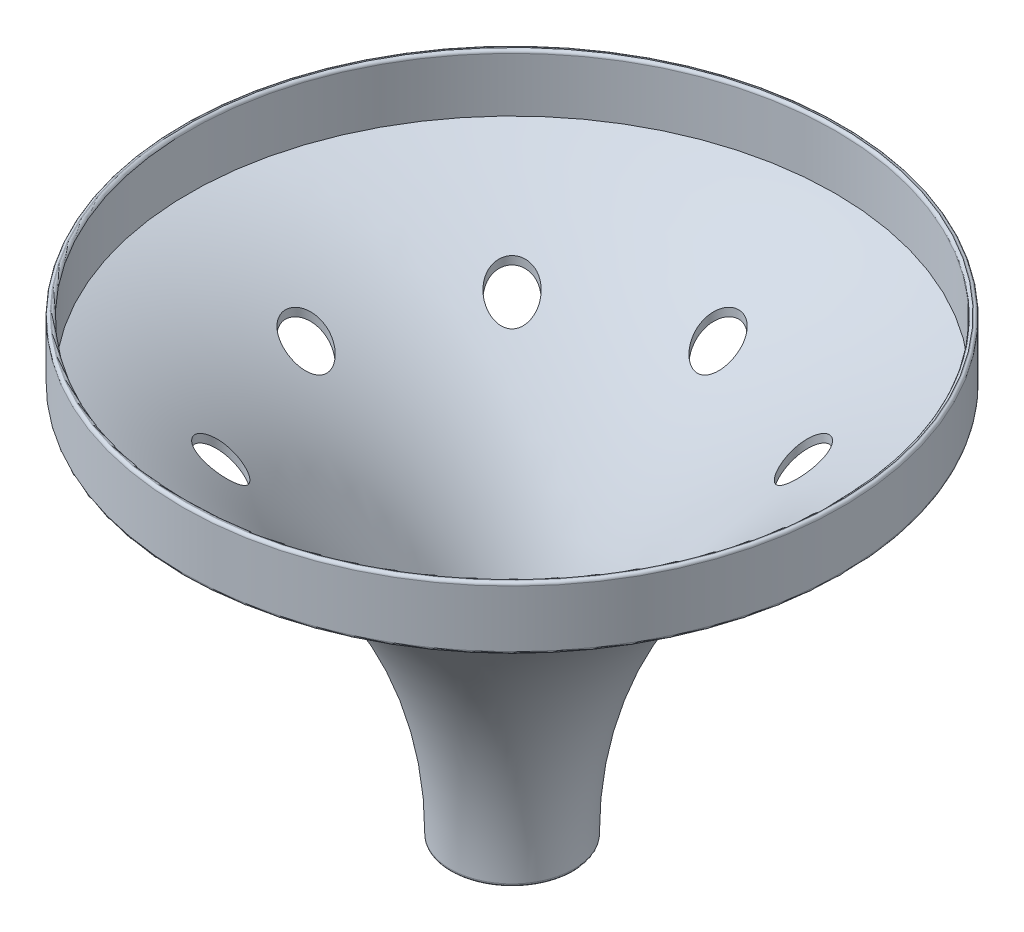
ISO-10303-21;
HEADER;
FILE_DESCRIPTION(('STEP AP214'),'2;1');
FILE_NAME('part.step','',(''),(''),'','','');
FILE_SCHEMA(('AUTOMOTIVE_DESIGN { 1 0 10303 214 1 1 1 1 }'));
ENDSEC;
DATA;
#1=APPLICATION_CONTEXT('core data for automotive mechanical design processes');
#2=APPLICATION_PROTOCOL_DEFINITION('international standard','automotive_design',2000,#1);
#3=PRODUCT_CONTEXT('',#1,'mechanical');
#4=PRODUCT('Part','Part','',(#3));
#5=PRODUCT_RELATED_PRODUCT_CATEGORY('part','',(#4));
#6=PRODUCT_DEFINITION_FORMATION('','',#4);
#7=PRODUCT_DEFINITION_CONTEXT('part definition',#1,'design');
#8=PRODUCT_DEFINITION('design','',#6,#7);
#9=PRODUCT_DEFINITION_SHAPE('','',#8);
#10=(LENGTH_UNIT() NAMED_UNIT(*) SI_UNIT(.MILLI.,.METRE.));
#11=(NAMED_UNIT(*) PLANE_ANGLE_UNIT() SI_UNIT($,.RADIAN.));
#12=(NAMED_UNIT(*) SI_UNIT($,.STERADIAN.) SOLID_ANGLE_UNIT());
#13=UNCERTAINTY_MEASURE_WITH_UNIT(LENGTH_MEASURE(1.E-05),#10,'distance_accuracy_value','');
#14=(GEOMETRIC_REPRESENTATION_CONTEXT(3) GLOBAL_UNCERTAINTY_ASSIGNED_CONTEXT((#13)) GLOBAL_UNIT_ASSIGNED_CONTEXT((#10,
#11,#12)) REPRESENTATION_CONTEXT('',''));
#15=CARTESIAN_POINT('',(0.,0.,0.));
#16=DIRECTION('',(0.,0.,1.));
#17=DIRECTION('',(1.,0.,0.));
#18=AXIS2_PLACEMENT_3D('',#15,#16,#17);
#19=CARTESIAN_POINT('',(0.,0.83932175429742,0.));
#20=DIRECTION('',(0.,-1.,0.));
#21=DIRECTION('',(0.,0.,-1.));
#22=AXIS2_PLACEMENT_3D('',#19,#20,#21);
#23=TOROIDAL_SURFACE('',#22,73.0194528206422,63.5);
#24=CARTESIAN_POINT('',(0.,60.2139385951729,0.));
#25=DIRECTION('',(0.,-1.,0.));
#26=DIRECTION('',(0.,0.,-1.));
#27=AXIS2_PLACEMENT_3D('',#24,#25,#26);
#28=CIRCLE('',#27,50.5049047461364);
#29=CARTESIAN_POINT('',(0.,60.2139385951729,-50.5049047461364));
#30=VERTEX_POINT('',#29);
#31=EDGE_CURVE('E54',#30,#30,#28,.T.);
#32=ORIENTED_EDGE('',*,*,#31,.T.);
#33=EDGE_LOOP('',(#32));
#34=FACE_BOUND('',#33,.T.);
#35=CARTESIAN_POINT('',(0.,0.459931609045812,0.));
#36=DIRECTION('',(0.,1.,0.));
#37=DIRECTION('',(0.,0.,1.));
#38=AXIS2_PLACEMENT_3D('',#35,#36,#37);
#39=CIRCLE('',#38,9.52058619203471);
#40=CARTESIAN_POINT('',(0.,0.459931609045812,9.52058619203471));
#41=VERTEX_POINT('',#40);
#42=EDGE_CURVE('E57',#41,#41,#39,.T.);
#43=ORIENTED_EDGE('',*,*,#42,.T.);
#44=EDGE_LOOP('',(#43));
#45=FACE_BOUND('',#44,.T.);
#46=CARTESIAN_POINT('',(-32.9339090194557,50.1944073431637,-2.94601161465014));
#47=CARTESIAN_POINT('',(-33.1023095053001,50.3253057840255,-2.87833647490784));
#48=CARTESIAN_POINT('',(-33.2680831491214,50.4518710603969,-2.79494994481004));
#49=CARTESIAN_POINT('',(-33.5886869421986,50.6928347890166,-2.59528145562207));
#50=CARTESIAN_POINT('',(-33.7435132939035,50.8072290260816,-2.47898815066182));
#51=CARTESIAN_POINT('',(-34.0080824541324,51.0000651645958,-2.23776319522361));
#52=CARTESIAN_POINT('',(-34.1208747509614,51.0812472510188,-2.11837581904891));
#53=CARTESIAN_POINT('',(-34.3297754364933,51.2301878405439,-1.85825125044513));
#54=CARTESIAN_POINT('',(-34.4258940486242,51.297954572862,-1.71752724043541));
#55=CARTESIAN_POINT('',(-34.5540360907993,51.387643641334,-1.49184974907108));
#56=CARTESIAN_POINT('',(-34.5942212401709,51.4156448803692,-1.41380820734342));
#57=CARTESIAN_POINT('',(-34.668433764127,51.4671875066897,-1.25345768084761));
#58=CARTESIAN_POINT('',(-34.7024643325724,51.4907312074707,-1.17115093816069));
#59=CARTESIAN_POINT('',(-34.7637725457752,51.5330355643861,-1.00290460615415));
#60=CARTESIAN_POINT('',(-34.7910524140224,51.5517977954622,-0.916966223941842));
#61=CARTESIAN_POINT('',(-34.838360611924,51.5842725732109,-0.742188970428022));
#62=CARTESIAN_POINT('',(-34.8583901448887,51.5979859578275,-0.653350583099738));
#63=CARTESIAN_POINT('',(-34.888638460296,51.6186710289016,-0.485631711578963));
#64=CARTESIAN_POINT('',(-34.8998089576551,51.6262976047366,-0.407001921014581));
#65=CARTESIAN_POINT('',(-34.9162349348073,51.6375066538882,-0.248810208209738));
#66=CARTESIAN_POINT('',(-34.921488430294,51.641087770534,-0.16924798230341));
#67=CARTESIAN_POINT('',(-34.9259829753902,51.6441518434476,-0.00993562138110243));
#68=CARTESIAN_POINT('',(-34.9252289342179,51.6436381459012,0.0698143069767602));
#69=CARTESIAN_POINT('',(-34.9177406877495,51.6385323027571,0.228910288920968));
#70=CARTESIAN_POINT('',(-34.9110043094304,51.6339386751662,0.308256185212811));
#71=CARTESIAN_POINT('',(-34.8833181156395,51.6150389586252,0.533516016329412));
#72=CARTESIAN_POINT('',(-34.8551354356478,51.5957834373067,0.67821689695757));
#73=CARTESIAN_POINT('',(-34.7798961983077,51.5441434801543,0.960040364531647));
#74=CARTESIAN_POINT('',(-34.7328389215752,51.5117585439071,1.09716266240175));
#75=CARTESIAN_POINT('',(-34.6201262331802,51.4337063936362,1.36562521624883));
#76=CARTESIAN_POINT('',(-34.5538678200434,51.3876069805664,1.49658529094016));
#77=CARTESIAN_POINT('',(-34.4064458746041,51.2842186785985,1.74493817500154));
#78=CARTESIAN_POINT('',(-34.3252768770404,51.2269256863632,1.86232598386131));
#79=CARTESIAN_POINT('',(-34.1406379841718,51.0953912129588,2.09525740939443));
#80=CARTESIAN_POINT('',(-34.0356640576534,51.0199445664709,2.2089226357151));
#81=CARTESIAN_POINT('',(-33.8146409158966,50.859232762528,2.41680397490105));
#82=CARTESIAN_POINT('',(-33.6985858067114,50.7739623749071,2.51100965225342));
#83=CARTESIAN_POINT('',(-33.4376027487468,50.5797750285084,2.69488099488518));
#84=CARTESIAN_POINT('',(-33.2911892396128,50.4693382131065,2.78082592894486));
#85=CARTESIAN_POINT('',(-32.9921143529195,50.2401501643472,2.92668851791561));
#86=CARTESIAN_POINT('',(-32.8394492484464,50.1213939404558,2.98659039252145));
#87=CARTESIAN_POINT('',(-32.5000033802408,49.8529542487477,3.09123700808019));
#88=CARTESIAN_POINT('',(-32.3125977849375,49.7018922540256,3.13042295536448));
#89=CARTESIAN_POINT('',(-31.9384307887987,49.3940847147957,3.17500773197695));
#90=CARTESIAN_POINT('',(-31.7516700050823,49.2373348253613,3.18038016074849));
#91=CARTESIAN_POINT('',(-31.3483752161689,48.891841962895,3.15710361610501));
#92=CARTESIAN_POINT('',(-31.1326924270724,48.702523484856,3.12200679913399));
#93=CARTESIAN_POINT('',(-30.7121975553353,48.3245098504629,3.008499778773));
#94=CARTESIAN_POINT('',(-30.507391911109,48.1358151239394,2.93006422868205));
#95=CARTESIAN_POINT('',(-30.1359275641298,47.7856851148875,2.74113387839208));
#96=CARTESIAN_POINT('',(-29.967569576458,47.6235716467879,2.63523953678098));
#97=CARTESIAN_POINT('',(-29.6478823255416,47.3098671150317,2.38798514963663));
#98=CARTESIAN_POINT('',(-29.4965253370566,47.1582590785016,2.2466840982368));
#99=CARTESIAN_POINT('',(-29.2603768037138,46.9177931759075,1.97585169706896));
#100=CARTESIAN_POINT('',(-29.1694356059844,46.8239837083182,1.85608320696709));
#101=CARTESIAN_POINT('',(-29.0021586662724,46.649704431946,1.59798578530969));
#102=CARTESIAN_POINT('',(-28.9258007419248,46.5692143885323,1.45968559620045));
#103=CARTESIAN_POINT('',(-28.8064753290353,46.4424631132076,1.19682934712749));
#104=CARTESIAN_POINT('',(-28.7598586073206,46.3925632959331,1.07570593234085));
#105=CARTESIAN_POINT('',(-28.6809250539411,46.3077037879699,0.823872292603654));
#106=CARTESIAN_POINT('',(-28.648596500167,46.272731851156,0.693170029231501));
#107=CARTESIAN_POINT('',(-28.6004643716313,46.2205533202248,0.424085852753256));
#108=CARTESIAN_POINT('',(-28.5847942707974,46.2034902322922,0.285651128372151));
#109=CARTESIAN_POINT('',(-28.5719497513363,46.1895097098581,0.00692985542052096));
#110=CARTESIAN_POINT('',(-28.5747655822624,46.1925816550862,-0.133355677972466));
#111=CARTESIAN_POINT('',(-28.5970935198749,46.2168660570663,-0.393343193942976));
#112=CARTESIAN_POINT('',(-28.6145104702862,46.2358019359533,-0.513455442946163));
#113=CARTESIAN_POINT('',(-28.6620627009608,46.2872918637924,-0.74807478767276));
#114=CARTESIAN_POINT('',(-28.6922035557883,46.3198518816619,-0.862579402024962));
#115=CARTESIAN_POINT('',(-28.7751798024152,46.4089984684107,-1.12021612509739));
#116=CARTESIAN_POINT('',(-28.8322127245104,46.4699595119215,-1.26047564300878));
#117=CARTESIAN_POINT('',(-28.9616543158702,46.6070119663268,-1.52565913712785));
#118=CARTESIAN_POINT('',(-29.0340933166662,46.6831332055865,-1.65055208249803));
#119=CARTESIAN_POINT('',(-29.2218038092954,46.8782478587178,-1.93064274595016));
#120=CARTESIAN_POINT('',(-29.3427231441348,47.0023365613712,-2.07847415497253));
#121=CARTESIAN_POINT('',(-29.6015097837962,47.2633600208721,-2.34504103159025));
#122=CARTESIAN_POINT('',(-29.7394046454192,47.4003155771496,-2.46372822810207));
#123=CARTESIAN_POINT('',(-29.9782796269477,47.6332779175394,-2.63728861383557));
#124=CARTESIAN_POINT('',(-30.0756732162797,47.7271943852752,-2.70007890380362));
#125=CARTESIAN_POINT('',(-30.2750882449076,47.9171813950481,-2.81397556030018));
#126=CARTESIAN_POINT('',(-30.3771110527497,48.0132525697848,-2.86507844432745));
#127=CARTESIAN_POINT('',(-30.6892297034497,48.3035292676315,-3.00115549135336));
#128=CARTESIAN_POINT('',(-30.9053346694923,48.4997577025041,-3.06886878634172));
#129=CARTESIAN_POINT('',(-31.2379339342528,48.7941930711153,-3.1355020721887));
#130=CARTESIAN_POINT('',(-31.3508571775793,48.8929010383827,-3.15188215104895));
#131=CARTESIAN_POINT('',(-31.57857099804,49.0894528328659,-3.17243186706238));
#132=CARTESIAN_POINT('',(-31.6933619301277,49.1872964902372,-3.17659915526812));
#133=CARTESIAN_POINT('',(-32.0386623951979,49.4779052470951,-3.17018693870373));
#134=CARTESIAN_POINT('',(-32.2710977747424,49.6686317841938,-3.14089718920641));
#135=CARTESIAN_POINT('',(-32.5740307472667,49.9113056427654,-3.06711537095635));
#136=CARTESIAN_POINT('',(-32.6464680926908,49.9688832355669,-3.04675318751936));
#137=CARTESIAN_POINT('',(-32.7907307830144,50.0827029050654,-3.00054046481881));
#138=CARTESIAN_POINT('',(-32.8625557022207,50.1389440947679,-2.97468638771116));
#139=CARTESIAN_POINT('',(-32.9339090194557,50.1944073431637,-2.94601161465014));
#140=B_SPLINE_CURVE_WITH_KNOTS('',3,(#46,#47,#48,#49,#50,#51,#52,#53,#54,#55,#56,#57,#58,#59,
#60,#61,#62,#63,#64,#65,#66,#67,#68,#69,#70,#71,#72,#73,#74,#75,#76,#77,#78,#79,#80,#81,#82,#83,
#84,#85,#86,#87,#88,#89,#90,#91,#92,#93,#94,#95,#96,#97,#98,#99,#100,#101,#102,#103,#104,#105,
#106,#107,#108,#109,#110,#111,#112,#113,#114,#115,#116,#117,#118,#119,#120,#121,#122,#123,#124,
#125,#126,#127,#128,#129,#130,#131,#132,#133,#134,#135,#136,#137,#138,#139),.UNSPECIFIED.,.T.,
.F.,(4,2,2,2,2,2,2,2,2,2,2,2,2,2,2,2,2,2,2,2,2,2,2,2,2,2,2,2,2,2,2,2,2,2,2,2,2,2,2,2,2,2,2,2,2,
2,4),(0.,0.671004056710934,1.34223975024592,1.88973866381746,2.4369006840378,2.71297241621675,
2.98890046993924,3.26473751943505,3.54052876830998,3.77956663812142,4.01868464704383,
4.25760727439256,4.49661672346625,4.94041026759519,5.38422072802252,5.84384674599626,
6.30364157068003,6.81809950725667,7.33283261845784,7.93820754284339,8.54394877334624,
9.27286096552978,10.0023421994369,10.8661698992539,11.7305033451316,12.4975802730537,
13.2633875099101,13.793493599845,14.3227868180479,14.7383432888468,15.1535581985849,
15.5720754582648,15.9903719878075,16.3572441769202,16.7242772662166,17.2112501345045,
17.6991907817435,18.3787949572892,19.0595172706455,19.5064559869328,19.9535277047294,
20.8478625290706,21.3000716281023,21.7523676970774,22.6529591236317,22.9370880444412,
23.2214005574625),.UNSPECIFIED.);
#141=CARTESIAN_POINT('',(-32.9339090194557,50.1944073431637,-2.94601161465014));
#142=VERTEX_POINT('',#141);
#143=EDGE_CURVE('E103',#142,#142,#140,.T.);
#144=ORIENTED_EDGE('',*,*,#143,.T.);
#145=EDGE_LOOP('',(#144));
#146=FACE_BOUND('',#145,.T.);
#147=CARTESIAN_POINT('',(-1.90789389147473,46.8678052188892,29.2121717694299));
#148=CARTESIAN_POINT('',(-2.0912512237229,47.009876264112,29.3500103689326));
#149=CARTESIAN_POINT('',(-2.25364413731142,47.1651702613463,29.5031339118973));
#150=CARTESIAN_POINT('',(-2.46691507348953,47.4085450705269,29.748299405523));
#151=CARTESIAN_POINT('',(-2.53312078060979,47.4917020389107,29.8329076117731));
#152=CARTESIAN_POINT('',(-2.6556612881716,47.660617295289,30.0066223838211));
#153=CARTESIAN_POINT('',(-2.71199861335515,47.7463749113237,30.0957277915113));
#154=CARTESIAN_POINT('',(-2.82188624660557,47.9312741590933,30.2899797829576));
#155=CARTESIAN_POINT('',(-2.87404504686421,48.0306659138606,30.3956730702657));
#156=CARTESIAN_POINT('',(-2.96604011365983,48.2307340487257,30.6111551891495));
#157=CARTESIAN_POINT('',(-3.00586955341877,48.3314111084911,30.7209462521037));
#158=CARTESIAN_POINT('',(-3.10674490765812,48.6338887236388,31.05513191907));
#159=CARTESIAN_POINT('',(-3.1494072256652,48.8365285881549,31.2847504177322));
#160=CARTESIAN_POINT('',(-3.17508175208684,49.1375518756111,31.634852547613));
#161=CARTESIAN_POINT('',(-3.17720801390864,49.2376634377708,31.752817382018));
#162=CARTESIAN_POINT('',(-3.16815878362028,49.4361468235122,31.9897113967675));
#163=CARTESIAN_POINT('',(-3.15698172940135,49.5345184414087,32.1086406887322));
#164=CARTESIAN_POINT('',(-3.10271214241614,49.8256549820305,32.4651454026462));
#165=CARTESIAN_POINT('',(-3.0389273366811,50.0149305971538,32.7030071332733));
#166=CARTESIAN_POINT('',(-2.87814383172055,50.3255024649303,33.1025666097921));
#167=CARTESIAN_POINT('',(-2.79549232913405,50.4509679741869,33.2669032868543));
#168=CARTESIAN_POINT('',(-2.59796667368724,50.689838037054,33.5846784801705));
#169=CARTESIAN_POINT('',(-2.48313900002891,50.8032596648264,33.7381323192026));
#170=CARTESIAN_POINT('',(-2.24383848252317,50.9957207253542,34.0020706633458));
#171=CARTESIAN_POINT('',(-2.12453212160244,51.0773075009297,34.1153833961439));
#172=CARTESIAN_POINT('',(-1.86438293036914,51.2270711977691,34.325371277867));
#173=CARTESIAN_POINT('',(-1.72354428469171,51.295250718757,34.4220496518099));
#174=CARTESIAN_POINT('',(-1.4975889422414,51.3855120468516,34.550981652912));
#175=CARTESIAN_POINT('',(-1.41944069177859,51.4136958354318,34.5914212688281));
#176=CARTESIAN_POINT('',(-1.258840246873,51.4655864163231,34.6661225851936));
#177=CARTESIAN_POINT('',(-1.17639033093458,51.4892955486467,34.7003875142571));
#178=CARTESIAN_POINT('',(-1.00783101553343,51.5319082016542,34.7621351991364));
#179=CARTESIAN_POINT('',(-0.921723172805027,51.5508137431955,34.7896208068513));
#180=CARTESIAN_POINT('',(-0.746577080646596,51.5835522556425,34.8373094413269));
#181=CARTESIAN_POINT('',(-0.657539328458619,51.5973860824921,34.8575136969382));
#182=CARTESIAN_POINT('',(-0.489581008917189,51.618252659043,34.8880260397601));
#183=CARTESIAN_POINT('',(-0.410917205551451,51.6259514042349,34.8993018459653));
#184=CARTESIAN_POINT('',(-0.252645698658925,51.6373003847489,34.9159324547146));
#185=CARTESIAN_POINT('',(-0.173037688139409,51.6409492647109,34.9212852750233));
#186=CARTESIAN_POINT('',(-0.0136227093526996,51.6441434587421,34.9259706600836));
#187=CARTESIAN_POINT('',(0.0661840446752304,51.6436921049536,34.9253081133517));
#188=CARTESIAN_POINT('',(0.225402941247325,51.6387047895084,34.9179936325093));
#189=CARTESIAN_POINT('',(0.304814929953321,51.6341673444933,34.9113395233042));
#190=CARTESIAN_POINT('',(0.530181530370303,51.6154262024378,34.883884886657));
#191=CARTESIAN_POINT('',(0.674934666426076,51.5962736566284,34.8558517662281));
#192=CARTESIAN_POINT('',(0.956887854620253,51.5448300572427,34.7808945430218));
#193=CARTESIAN_POINT('',(1.09408762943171,51.5125385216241,34.7339697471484));
#194=CARTESIAN_POINT('',(1.36267757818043,51.4346787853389,34.6215259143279));
#195=CARTESIAN_POINT('',(1.49369221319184,51.3886825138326,34.5554094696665));
#196=CARTESIAN_POINT('',(1.74217589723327,51.285494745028,34.408257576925));
#197=CARTESIAN_POINT('',(1.85963997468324,51.2282991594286,34.3272166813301));
#198=CARTESIAN_POINT('',(2.09272113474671,51.0969800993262,34.1428554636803));
#199=CARTESIAN_POINT('',(2.20646626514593,51.0216534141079,34.0380326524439));
#200=CARTESIAN_POINT('',(2.41453055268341,50.8611765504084,33.8172960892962));
#201=CARTESIAN_POINT('',(2.50883929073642,50.7760211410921,33.7013764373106));
#202=CARTESIAN_POINT('',(2.69294071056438,50.5820923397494,33.4406899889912));
#203=CARTESIAN_POINT('',(2.77901992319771,50.4717995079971,33.294435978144));
#204=CARTESIAN_POINT('',(2.92517784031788,50.2428924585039,32.9956586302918));
#205=CARTESIAN_POINT('',(2.98524077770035,50.1242732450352,32.8431315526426));
#206=CARTESIAN_POINT('',(3.09026612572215,49.8561300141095,32.5039706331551));
#207=CARTESIAN_POINT('',(3.12967578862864,49.7052258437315,32.3167072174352));
#208=CARTESIAN_POINT('',(3.17474000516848,49.3977199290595,31.9427936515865));
#209=CARTESIAN_POINT('',(3.1803682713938,49.2411138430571,31.7561440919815));
#210=CARTESIAN_POINT('',(3.15768451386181,48.8958835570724,31.353020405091));
#211=CARTESIAN_POINT('',(3.12292383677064,48.7066794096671,31.1373919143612));
#212=CARTESIAN_POINT('',(3.01012877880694,48.3288562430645,30.7169575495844));
#213=CARTESIAN_POINT('',(2.93206873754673,48.1402376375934,30.5121581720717));
#214=CARTESIAN_POINT('',(2.74372609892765,47.7898754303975,30.1403087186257));
#215=CARTESIAN_POINT('',(2.63797197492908,47.6274696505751,29.9715902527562));
#216=CARTESIAN_POINT('',(2.39091112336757,47.3131586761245,29.6511897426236));
#217=CARTESIAN_POINT('',(2.2496634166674,47.1612365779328,29.4994800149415));
#218=CARTESIAN_POINT('',(1.97887898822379,46.9202566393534,29.262775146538));
#219=CARTESIAN_POINT('',(1.85913298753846,46.8262478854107,29.171623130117));
#220=CARTESIAN_POINT('',(1.60103069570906,46.6515611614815,29.0039268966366));
#221=CARTESIAN_POINT('',(1.46270331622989,46.5708629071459,28.9273604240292));
#222=CARTESIAN_POINT('',(1.19982798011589,46.4437608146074,28.807691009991));
#223=CARTESIAN_POINT('',(1.07871940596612,46.3937140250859,28.7609326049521));
#224=CARTESIAN_POINT('',(0.826783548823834,46.3085532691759,28.6817116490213));
#225=CARTESIAN_POINT('',(0.695964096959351,46.2734274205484,28.6492377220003));
#226=CARTESIAN_POINT('',(0.494387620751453,46.2341103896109,28.6129702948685));
#227=CARTESIAN_POINT('',(0.425973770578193,46.2232143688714,28.6029379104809));
#228=CARTESIAN_POINT('',(0.28805867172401,46.2062553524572,28.5873348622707));
#229=CARTESIAN_POINT('',(0.218557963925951,46.2001900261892,28.5817620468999));
#230=CARTESIAN_POINT('',(0.0791044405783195,46.1930672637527,28.5752183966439));
#231=CARTESIAN_POINT('',(0.0091517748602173,46.1920082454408,28.5742461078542));
#232=CARTESIAN_POINT('',(-0.13053871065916,46.1949129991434,28.5769142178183));
#233=CARTESIAN_POINT('',(-0.200276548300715,46.1988763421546,28.5805542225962));
#234=CARTESIAN_POINT('',(-0.391021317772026,46.2165742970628,28.5968234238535));
#235=CARTESIAN_POINT('',(-0.511214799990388,46.2354106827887,28.6141495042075));
#236=CARTESIAN_POINT('',(-0.745995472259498,46.2867365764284,28.6615495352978));
#237=CARTESIAN_POINT('',(-0.860577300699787,46.3192388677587,28.6916354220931));
#238=CARTESIAN_POINT('',(-1.1183824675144,46.4082598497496,28.7744891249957));
#239=CARTESIAN_POINT('',(-1.2587377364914,46.469155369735,28.8314556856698));
#240=CARTESIAN_POINT('',(-1.52389473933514,46.606006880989,28.960702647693));
#241=CARTESIAN_POINT('',(-1.64869825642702,46.6819611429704,29.0329812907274));
#242=CARTESIAN_POINT('',(-1.81436629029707,46.7971998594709,29.14382507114));
#243=CARTESIAN_POINT('',(-1.86179273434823,46.8320845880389,29.1775152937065));
#244=CARTESIAN_POINT('',(-1.90789389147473,46.8678052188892,29.2121717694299));
#245=B_SPLINE_CURVE_WITH_KNOTS('',3,(#147,#148,#149,#150,#151,#152,#153,#154,#155,#156,#157,
#158,#159,#160,#161,#162,#163,#164,#165,#166,#167,#168,#169,#170,#171,#172,#173,#174,#175,#176,
#177,#178,#179,#180,#181,#182,#183,#184,#185,#186,#187,#188,#189,#190,#191,#192,#193,#194,#195,
#196,#197,#198,#199,#200,#201,#202,#203,#204,#205,#206,#207,#208,#209,#210,#211,#212,#213,#214,
#215,#216,#217,#218,#219,#220,#221,#222,#223,#224,#225,#226,#227,#228,#229,#230,#231,#232,#233,
#234,#235,#236,#237,#238,#239,#240,#241,#242,#243,#244),.UNSPECIFIED.,.T.,.F.,(4,2,2,2,2,2,2,2,
2,2,2,2,2,2,2,2,2,2,2,2,2,2,2,2,2,2,2,2,2,2,2,2,2,2,2,2,2,2,2,2,2,2,2,2,2,2,2,2,4),(0.,
0.809219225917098,1.21653726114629,1.62375093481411,2.08567802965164,2.54786043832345,
3.47040645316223,3.93412981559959,4.39790763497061,5.32323717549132,5.98884959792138,
6.65350544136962,7.20235447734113,7.75109698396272,8.02793802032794,8.30463387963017,
8.58121314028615,8.85774570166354,9.09694893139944,9.33623219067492,9.57532100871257,
9.81449665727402,10.2583168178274,10.7021532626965,11.1616427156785,11.6213002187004,
12.1354832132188,12.6499411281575,13.2549072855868,13.8602395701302,14.5886413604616,
15.3176098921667,16.1809735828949,17.0448494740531,17.8130096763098,18.5799008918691,
19.1106060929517,19.6404949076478,20.0563675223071,20.4719083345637,20.6816366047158,
20.8912636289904,21.1008244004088,21.310367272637,21.6772154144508,22.0444074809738,
22.5315262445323,23.0185891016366,23.2220494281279),.UNSPECIFIED.);
#246=CARTESIAN_POINT('',(-1.90789389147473,46.8678052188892,29.2121717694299));
#247=VERTEX_POINT('',#246);
#248=EDGE_CURVE('E141',#247,#247,#245,.T.);
#249=ORIENTED_EDGE('',*,*,#248,.T.);
#250=EDGE_LOOP('',(#249));
#251=FACE_BOUND('',#250,.T.);
#252=CARTESIAN_POINT('',(29.2121717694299,46.8678052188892,-1.9078938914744));
#253=CARTESIAN_POINT('',(29.1305172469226,46.7836379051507,-1.79927983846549));
#254=CARTESIAN_POINT('',(29.0540935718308,46.7039875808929,-1.68313449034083));
#255=CARTESIAN_POINT('',(28.9145324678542,46.5573247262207,-1.43558353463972));
#256=CARTESIAN_POINT('',(28.8513945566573,46.4903117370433,-1.30417848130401));
#257=CARTESIAN_POINT('',(28.7507771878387,46.3828558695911,-1.04926268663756));
#258=CARTESIAN_POINT('',(28.7108144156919,46.3398826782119,-0.927817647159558));
#259=CARTESIAN_POINT('',(28.6452879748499,46.2691769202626,-0.676869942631));
#260=CARTESIAN_POINT('',(28.6197084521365,46.2414275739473,-0.547376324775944));
#261=CARTESIAN_POINT('',(28.5847878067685,46.2034970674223,-0.282764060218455));
#262=CARTESIAN_POINT('',(28.5755502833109,46.1934279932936,-0.147615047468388));
#263=CARTESIAN_POINT('',(28.5744980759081,46.1922825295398,0.122832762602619));
#264=CARTESIAN_POINT('',(28.5826816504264,46.201204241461,0.25813154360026));
#265=CARTESIAN_POINT('',(28.6140385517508,46.2352724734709,0.510850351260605));
#266=CARTESIAN_POINT('',(28.6356381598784,46.2587149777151,0.628709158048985));
#267=CARTESIAN_POINT('',(28.690887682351,46.3184092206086,0.858138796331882));
#268=CARTESIAN_POINT('',(28.7245424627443,46.3546661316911,0.969707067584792));
#269=CARTESIAN_POINT('',(28.8173839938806,46.4541042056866,1.22707625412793));
#270=CARTESIAN_POINT('',(28.8814085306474,46.5222696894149,1.36920291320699));
#271=CARTESIAN_POINT('',(29.0250476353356,46.6736222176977,1.63658613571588));
#272=CARTESIAN_POINT('',(29.1046960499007,46.7568418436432,1.76180505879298));
#273=CARTESIAN_POINT('',(29.3102405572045,46.9690917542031,2.04187378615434));
#274=CARTESIAN_POINT('',(29.4419151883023,47.1031587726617,2.18863499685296));
#275=CARTESIAN_POINT('',(29.7223686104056,47.3834789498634,2.45076854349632));
#276=CARTESIAN_POINT('',(29.8711743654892,47.5297512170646,2.56609040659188));
#277=CARTESIAN_POINT('',(30.1254803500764,47.7749324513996,2.7304702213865));
#278=CARTESIAN_POINT('',(30.2272409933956,47.871895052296,2.78842578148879));
#279=CARTESIAN_POINT('',(30.435152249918,48.0675524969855,2.89228613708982));
#280=CARTESIAN_POINT('',(30.5413039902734,48.1662477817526,2.93818781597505));
#281=CARTESIAN_POINT('',(30.8653659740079,48.4637216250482,3.05795416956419));
#282=CARTESIAN_POINT('',(31.0889514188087,48.6639544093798,3.11392362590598));
#283=CARTESIAN_POINT('',(31.431391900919,48.9628094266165,3.16109222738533));
#284=CARTESIAN_POINT('',(31.54713559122,49.062526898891,3.17065216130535));
#285=CARTESIAN_POINT('',(31.7800690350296,49.2606639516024,3.1769963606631));
#286=CARTESIAN_POINT('',(31.8972587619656,49.3590835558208,3.17378086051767));
#287=CARTESIAN_POINT('',(32.2494666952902,49.6511249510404,3.14428818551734));
#288=CARTESIAN_POINT('',(32.4856328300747,49.841973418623,3.09823787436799));
#289=CARTESIAN_POINT('',(32.8948480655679,50.1648600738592,2.96721575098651));
#290=CARTESIAN_POINT('',(33.0693919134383,50.2999870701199,2.89429829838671));
#291=CARTESIAN_POINT('',(33.4090624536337,50.5585564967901,2.71384844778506));
#292=CARTESIAN_POINT('',(33.5742018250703,50.6820148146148,2.60636401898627));
#293=CARTESIAN_POINT('',(33.8592436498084,50.8919629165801,2.37879683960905));
#294=CARTESIAN_POINT('',(33.9819015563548,50.9810874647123,2.26459356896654));
#295=CARTESIAN_POINT('',(34.2114290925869,51.1461134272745,2.01268914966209));
#296=CARTESIAN_POINT('',(34.3183013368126,51.2220170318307,1.87499190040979));
#297=CARTESIAN_POINT('',(34.4628996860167,51.3238575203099,1.65190474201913));
#298=CARTESIAN_POINT('',(34.5086612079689,51.3559258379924,1.57437468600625));
#299=CARTESIAN_POINT('',(34.5940187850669,51.4155138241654,1.41435027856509));
#300=CARTESIAN_POINT('',(34.6336181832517,51.4430359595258,1.33185865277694));
#301=CARTESIAN_POINT('',(34.7059466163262,51.4931468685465,1.16253164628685));
#302=CARTESIAN_POINT('',(34.7386791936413,51.5157381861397,1.07569853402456));
#303=CARTESIAN_POINT('',(34.7966683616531,51.5556642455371,0.898403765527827));
#304=CARTESIAN_POINT('',(34.8219264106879,51.573000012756,0.807942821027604));
#305=CARTESIAN_POINT('',(34.8613618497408,51.6000214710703,0.637613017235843));
#306=CARTESIAN_POINT('',(34.8766146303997,51.6104517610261,0.558109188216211));
#307=CARTESIAN_POINT('',(34.9010373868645,51.6271380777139,0.397707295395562));
#308=CARTESIAN_POINT('',(34.9102053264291,51.6333927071,0.31680877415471));
#309=CARTESIAN_POINT('',(34.9222873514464,51.6416332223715,0.154398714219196));
#310=CARTESIAN_POINT('',(34.9252071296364,51.6436229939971,0.0728878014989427));
#311=CARTESIAN_POINT('',(34.9247694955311,51.6433244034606,-0.0901177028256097));
#312=CARTESIAN_POINT('',(34.9214098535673,51.6410345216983,-0.17161227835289));
#313=CARTESIAN_POINT('',(34.9031016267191,51.628547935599,-0.400639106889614));
#314=CARTESIAN_POINT('',(34.8808990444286,51.6134004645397,-0.547412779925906));
#315=CARTESIAN_POINT('',(34.816930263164,51.5695832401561,-0.834401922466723));
#316=CARTESIAN_POINT('',(34.7751645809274,51.540913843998,-0.974617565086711));
#317=CARTESIAN_POINT('',(34.6731086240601,51.4704539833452,-1.24811827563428));
#318=CARTESIAN_POINT('',(34.6124501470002,51.4284023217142,-1.38119779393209));
#319=CARTESIAN_POINT('',(34.4756761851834,51.3328750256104,-1.63465102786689));
#320=CARTESIAN_POINT('',(34.3995556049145,51.2793956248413,-1.75502053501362));
#321=CARTESIAN_POINT('',(34.2258295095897,51.1562688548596,-1.99373337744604));
#322=CARTESIAN_POINT('',(34.1267906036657,51.0854983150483,-2.11044894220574));
#323=CARTESIAN_POINT('',(33.9170306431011,50.9339436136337,-2.32533605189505));
#324=CARTESIAN_POINT('',(33.8063036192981,50.8531543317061,-2.42349804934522));
#325=CARTESIAN_POINT('',(33.5569996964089,50.6690469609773,-2.61614372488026));
#326=CARTESIAN_POINT('',(33.4168810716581,50.5642301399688,-2.707192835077));
#327=CARTESIAN_POINT('',(33.1295687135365,50.3460162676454,-2.86430999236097));
#328=CARTESIAN_POINT('',(32.9823706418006,50.2326139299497,-2.93036249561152));
#329=CARTESIAN_POINT('',(32.6542957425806,49.9758165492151,-3.04945156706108));
#330=CARTESIAN_POINT('',(32.4726144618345,49.8309855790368,-3.09717544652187));
#331=CARTESIAN_POINT('',(32.1087188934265,49.5351276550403,-3.16007780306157));
#332=CARTESIAN_POINT('',(31.9265043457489,49.3840969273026,-3.17523614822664));
#333=CARTESIAN_POINT('',(31.5305696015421,49.0493187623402,-3.17471264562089));
#334=CARTESIAN_POINT('',(31.3174743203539,48.8648289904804,-3.15259201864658));
#335=CARTESIAN_POINT('',(30.9002231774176,48.4949915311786,-3.06658802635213));
#336=CARTESIAN_POINT('',(30.6960788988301,48.3096430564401,-3.00265215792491));
#337=CARTESIAN_POINT('',(30.3146584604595,47.9553890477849,-2.83911743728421));
#338=CARTESIAN_POINT('',(30.1364983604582,47.7862100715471,-2.74217482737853));
#339=CARTESIAN_POINT('',(29.7969010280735,47.4572147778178,-2.51157247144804));
#340=CARTESIAN_POINT('',(29.6354042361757,47.2973660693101,-2.3780502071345));
#341=CARTESIAN_POINT('',(29.3891870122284,47.0493057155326,-2.12741865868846));
#342=CARTESIAN_POINT('',(29.2978030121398,46.9560716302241,-2.02179764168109));
#343=CARTESIAN_POINT('',(29.2121717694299,46.8678052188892,-1.9078938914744));
#344=B_SPLINE_CURVE_WITH_KNOTS('',3,(#252,#253,#254,#255,#256,#257,#258,#259,#260,#261,#262,
#263,#264,#265,#266,#267,#268,#269,#270,#271,#272,#273,#274,#275,#276,#277,#278,#279,#280,#281,
#282,#283,#284,#285,#286,#287,#288,#289,#290,#291,#292,#293,#294,#295,#296,#297,#298,#299,#300,
#301,#302,#303,#304,#305,#306,#307,#308,#309,#310,#311,#312,#313,#314,#315,#316,#317,#318,#319,
#320,#321,#322,#323,#324,#325,#326,#327,#328,#329,#330,#331,#332,#333,#334,#335,#336,#337,#338,
#339,#340,#341,#342,#343),.UNSPECIFIED.,.T.,.F.,(4,2,2,2,2,2,2,2,2,2,2,2,2,2,2,2,2,2,2,2,2,2,2,
2,2,2,2,2,2,2,2,2,2,2,2,2,2,2,2,2,2,2,2,2,2,4),(0.,0.479206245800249,0.958395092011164,
1.36140922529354,1.76397825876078,2.16909033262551,2.57416191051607,2.93889915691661,
3.30378379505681,3.81135588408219,4.3200399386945,5.03151759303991,5.74413081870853,
6.1997089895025,6.65540483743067,7.56648612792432,8.02526649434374,8.48403844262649,
9.39956922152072,10.0944626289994,10.7883958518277,11.3556811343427,11.9228723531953,
12.2092180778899,12.4954079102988,12.7814497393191,13.0674357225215,13.3119731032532,
13.5565922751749,13.80098847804,14.0454714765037,14.4908365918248,14.9361899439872,
15.3908321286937,15.8456243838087,16.3496145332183,16.8538633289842,17.4434576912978,
18.0334180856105,18.742375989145,19.451772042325,20.2965719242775,21.1424345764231,
21.932010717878,22.7186590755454,23.2212035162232),.UNSPECIFIED.);
#345=CARTESIAN_POINT('',(29.2121717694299,46.8678052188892,-1.9078938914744));
#346=VERTEX_POINT('',#345);
#347=EDGE_CURVE('E129',#346,#346,#344,.T.);
#348=ORIENTED_EDGE('',*,*,#347,.T.);
#349=EDGE_LOOP('',(#348));
#350=FACE_BOUND('',#349,.T.);
#351=CARTESIAN_POINT('',(-2.94601161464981,50.1944073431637,-32.9339090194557));
#352=CARTESIAN_POINT('',(-3.0274333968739,50.0369062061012,-32.73129426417));
#353=CARTESIAN_POINT('',(-3.08624350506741,49.8728897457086,-32.5245737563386));
#354=CARTESIAN_POINT('',(-3.1615413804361,49.5366220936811,-32.1101879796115));
#355=CARTESIAN_POINT('',(-3.17798626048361,49.3643627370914,-31.9025219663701));
#356=CARTESIAN_POINT('',(-3.17099383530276,49.0087032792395,-31.4833786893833));
#357=CARTESIAN_POINT('',(-3.14594816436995,48.825132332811,-31.2720771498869));
#358=CARTESIAN_POINT('',(-3.05462446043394,48.4573136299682,-30.858470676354));
#359=CARTESIAN_POINT('',(-2.98828446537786,48.2730652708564,-30.6561797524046));
#360=CARTESIAN_POINT('',(-2.85329742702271,47.9900472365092,-30.352349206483));
#361=CARTESIAN_POINT('',(-2.79873065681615,47.8896188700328,-30.2459264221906));
#362=CARTESIAN_POINT('',(-2.67671645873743,47.6911687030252,-30.038178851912));
#363=CARTESIAN_POINT('',(-2.60926438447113,47.5931477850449,-29.9368559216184));
#364=CARTESIAN_POINT('',(-2.46136075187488,47.4011300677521,-29.7406761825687));
#365=CARTESIAN_POINT('',(-2.38094394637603,47.3071233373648,-29.6458030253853));
#366=CARTESIAN_POINT('',(-2.20658509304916,47.1246293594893,-29.4636301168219));
#367=CARTESIAN_POINT('',(-2.11265606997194,47.0361369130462,-29.3763232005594));
#368=CARTESIAN_POINT('',(-1.90241068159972,46.8598652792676,-29.2041387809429));
#369=CARTESIAN_POINT('',(-1.78489139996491,46.772736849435,-29.1200445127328));
#370=CARTESIAN_POINT('',(-1.53308778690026,46.6114090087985,-28.9657598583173));
#371=CARTESIAN_POINT('',(-1.39883180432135,46.5371882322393,-28.8955464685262));
#372=CARTESIAN_POINT('',(-1.14047243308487,46.4186682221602,-28.7842086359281));
#373=CARTESIAN_POINT('',(-1.01904621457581,46.3713762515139,-28.7401089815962));
#374=CARTESIAN_POINT('',(-0.767143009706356,46.2918919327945,-28.6662855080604));
#375=CARTESIAN_POINT('',(-0.636672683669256,46.2596886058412,-28.6365512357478));
#376=CARTESIAN_POINT('',(-0.36884217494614,46.2130499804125,-28.5935651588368));
#377=CARTESIAN_POINT('',(-0.231438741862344,46.1987457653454,-28.5804349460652));
#378=CARTESIAN_POINT('',(0.0445216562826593,46.1899079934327,-28.5723166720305));
#379=CARTESIAN_POINT('',(0.183078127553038,46.1953663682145,-28.5773212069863));
#380=CARTESIAN_POINT('',(0.440350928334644,46.2236514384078,-28.6033372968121));
#381=CARTESIAN_POINT('',(0.559507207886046,46.2443943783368,-28.6224287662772));
#382=CARTESIAN_POINT('',(0.791938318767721,46.2991612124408,-28.6730490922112));
#383=CARTESIAN_POINT('',(0.905210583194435,46.3331908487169,-28.7045833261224));
#384=CARTESIAN_POINT('',(1.16267838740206,46.4263731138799,-28.7914187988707));
#385=CARTESIAN_POINT('',(1.30368916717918,46.490153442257,-28.8511799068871));
#386=CARTESIAN_POINT('',(1.56977355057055,46.632804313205,-28.9861606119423));
#387=CARTESIAN_POINT('',(1.69481368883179,46.7117057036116,-29.0614118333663));
#388=CARTESIAN_POINT('',(1.97501150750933,46.9135688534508,-29.2561112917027));
#389=CARTESIAN_POINT('',(2.12251151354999,47.0416119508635,-29.3812663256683));
#390=CARTESIAN_POINT('',(2.38752117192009,47.3103020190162,-29.6485988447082));
#391=CARTESIAN_POINT('',(2.50497993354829,47.4509698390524,-29.7908046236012));
#392=CARTESIAN_POINT('',(2.67510429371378,47.6889043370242,-30.0358766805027));
#393=CARTESIAN_POINT('',(2.73606010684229,47.7841337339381,-30.1350960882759));
#394=CARTESIAN_POINT('',(2.84612679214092,47.9765810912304,-30.3380756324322));
#395=CARTESIAN_POINT('',(2.89523436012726,48.0737995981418,-30.4418370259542));
#396=CARTESIAN_POINT('',(3.02499426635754,48.367189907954,-30.7589394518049));
#397=CARTESIAN_POINT('',(3.08812821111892,48.5651600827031,-30.9781639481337));
#398=CARTESIAN_POINT('',(3.1471239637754,48.8615189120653,-31.3148445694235));
#399=CARTESIAN_POINT('',(3.16081844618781,48.9606446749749,-31.4289030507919));
#400=CARTESIAN_POINT('',(3.17577713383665,49.1578552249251,-31.6587179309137));
#401=CARTESIAN_POINT('',(3.177041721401,49.255940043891,-31.7744742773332));
#402=CARTESIAN_POINT('',(3.16157105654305,49.5474319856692,-32.1228866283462));
#403=CARTESIAN_POINT('',(3.12565155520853,49.7384690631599,-32.3571319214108));
#404=CARTESIAN_POINT('',(3.01235161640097,50.0678015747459,-32.7707703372));
#405=CARTESIAN_POINT('',(2.9455530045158,50.2086019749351,-32.9511227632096));
#406=CARTESIAN_POINT('',(2.77593935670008,50.4787682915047,-33.3033328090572));
#407=CARTESIAN_POINT('',(2.67317349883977,50.6081495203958,-33.4752016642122));
#408=CARTESIAN_POINT('',(2.4531309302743,50.8284362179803,-33.7724556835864));
#409=CARTESIAN_POINT('',(2.3421531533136,50.9220138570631,-33.9005259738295));
#410=CARTESIAN_POINT('',(2.0955592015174,51.0960680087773,-34.1414129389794));
#411=CARTESIAN_POINT('',(1.95994666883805,51.1765464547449,-34.2542318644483));
#412=CARTESIAN_POINT('',(1.73890707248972,51.2852604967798,-34.4080115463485));
#413=CARTESIAN_POINT('',(1.66186371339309,51.3196380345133,-34.4569000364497));
#414=CARTESIAN_POINT('',(1.5024200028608,51.383808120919,-34.5485344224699));
#415=CARTESIAN_POINT('',(1.42002261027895,51.413603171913,-34.591283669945));
#416=CARTESIAN_POINT('',(1.25047344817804,51.4681900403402,-34.6698751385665));
#417=CARTESIAN_POINT('',(1.16332442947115,51.4929847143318,-34.7057213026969));
#418=CARTESIAN_POINT('',(0.984974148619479,51.5372140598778,-34.7698383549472));
#419=CARTESIAN_POINT('',(0.893773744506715,51.5566498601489,-34.7981108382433));
#420=CARTESIAN_POINT('',(0.722159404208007,51.5873498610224,-34.842855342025));
#421=CARTESIAN_POINT('',(0.642179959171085,51.5994025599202,-34.8604613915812));
#422=CARTESIAN_POINT('',(0.480592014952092,51.6192526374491,-34.8894892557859));
#423=CARTESIAN_POINT('',(0.398983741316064,51.6270506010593,-34.9009119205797));
#424=CARTESIAN_POINT('',(0.234866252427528,51.6382834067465,-34.9173737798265));
#425=CARTESIAN_POINT('',(0.152357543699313,51.6417205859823,-34.9224163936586));
#426=CARTESIAN_POINT('',(-0.0128425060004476,51.6441978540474,-34.9260507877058));
#427=CARTESIAN_POINT('',(-0.0955338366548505,51.6432381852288,-34.9246429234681));
#428=CARTESIAN_POINT('',(-0.326664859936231,51.6343788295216,-34.9116481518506));
#429=CARTESIAN_POINT('',(-0.474597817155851,51.6215265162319,-34.8927973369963));
#430=CARTESIAN_POINT('',(-0.764488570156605,51.5820679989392,-34.8351369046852));
#431=CARTESIAN_POINT('',(-0.90644676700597,51.5554627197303,-34.7963286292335));
#432=CARTESIAN_POINT('',(-1.18273684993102,51.489164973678,-34.7001549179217));
#433=CARTESIAN_POINT('',(-1.31695163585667,51.4493135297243,-34.6425642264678));
#434=CARTESIAN_POINT('',(-1.57315301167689,51.3580513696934,-34.5116196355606));
#435=CARTESIAN_POINT('',(-1.69513559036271,51.3066368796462,-34.4382605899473));
#436=CARTESIAN_POINT('',(-1.93691836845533,51.1880354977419,-34.270471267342));
#437=CARTESIAN_POINT('',(-2.05522414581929,51.1197742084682,-34.174654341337));
#438=CARTESIAN_POINT('',(-2.27377151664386,50.9731361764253,-33.971020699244));
#439=CARTESIAN_POINT('',(-2.37400565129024,50.8947552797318,-33.8631990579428));
#440=CARTESIAN_POINT('',(-2.56857927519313,50.7184387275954,-33.6234965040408));
#441=CARTESIAN_POINT('',(-2.66024551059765,50.6192943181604,-33.490340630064));
#442=CARTESIAN_POINT('',(-2.82034949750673,50.4126468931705,-33.216773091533));
#443=CARTESIAN_POINT('',(-2.8887686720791,50.305137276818,-33.0763557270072));
#444=CARTESIAN_POINT('',(-2.94601161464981,50.1944073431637,-32.9339090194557));
#445=B_SPLINE_CURVE_WITH_KNOTS('',3,(#351,#352,#353,#354,#355,#356,#357,#358,#359,#360,#361,
#362,#363,#364,#365,#366,#367,#368,#369,#370,#371,#372,#373,#374,#375,#376,#377,#378,#379,#380,
#381,#382,#383,#384,#385,#386,#387,#388,#389,#390,#391,#392,#393,#394,#395,#396,#397,#398,#399,
#400,#401,#402,#403,#404,#405,#406,#407,#408,#409,#410,#411,#412,#413,#414,#415,#416,#417,#418,
#419,#420,#421,#422,#423,#424,#425,#426,#427,#428,#429,#430,#431,#432,#433,#434,#435,#436,#437,
#438,#439,#440,#441,#442,#443,#444),.UNSPECIFIED.,.T.,.F.,(4,2,2,2,2,2,2,2,2,2,2,2,2,2,2,2,2,2,
2,2,2,2,2,2,2,2,2,2,2,2,2,2,2,2,2,2,2,2,2,2,2,2,2,2,2,2,4),(0.,0.807024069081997,
1.6148647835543,2.45475959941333,3.29591772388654,3.76390484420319,4.23206103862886,
4.69898255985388,5.16545698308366,5.67009787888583,6.1738953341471,6.58499563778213,
6.99579634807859,7.40958826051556,7.82321125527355,8.18895204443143,8.55485107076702,
9.04980743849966,9.54578450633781,10.2379951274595,10.931370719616,11.3821168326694,
11.8329885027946,12.734431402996,13.18921076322,13.6439761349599,14.5517303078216,
15.2642001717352,15.9756996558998,16.5542591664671,17.1327332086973,17.4248828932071,
17.7168724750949,18.0086947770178,18.3004555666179,18.5484442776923,18.7963988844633,
19.0442205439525,19.2920285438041,19.7387618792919,20.1854651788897,20.6377358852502,
21.0901544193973,21.5887649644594,22.0875808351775,22.654500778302,23.2218726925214),.UNSPECIFIED.);
#446=CARTESIAN_POINT('',(-2.94601161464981,50.1944073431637,-32.9339090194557));
#447=VERTEX_POINT('',#446);
#448=EDGE_CURVE('E116',#447,#447,#445,.T.);
#449=ORIENTED_EDGE('',*,*,#448,.T.);
#450=EDGE_LOOP('',(#449));
#451=FACE_BOUND('',#450,.T.);
#452=CARTESIAN_POINT('',(20.2055762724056,46.1928289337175,-20.2055762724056));
#453=CARTESIAN_POINT('',(20.2549193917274,46.1928293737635,-20.156233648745));
#454=CARTESIAN_POINT('',(20.3059028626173,46.1953407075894,-20.1085110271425));
#455=CARTESIAN_POINT('',(20.4106506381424,46.2053176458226,-20.0167294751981));
#456=CARTESIAN_POINT('',(20.4644166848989,46.2127863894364,-19.9726728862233));
#457=CARTESIAN_POINT('',(20.5742724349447,46.2324974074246,-19.8884800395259));
#458=CARTESIAN_POINT('',(20.6303665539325,46.2447491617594,-19.8483517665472));
#459=CARTESIAN_POINT('',(20.7442413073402,46.273711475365,-19.7722963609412));
#460=CARTESIAN_POINT('',(20.8020227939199,46.2904243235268,-19.7363713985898));
#461=CARTESIAN_POINT('',(20.9759967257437,46.3463397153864,-19.6357077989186));
#462=CARTESIAN_POINT('',(21.0939588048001,46.3915349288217,-19.5772187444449));
#463=CARTESIAN_POINT('',(21.3310774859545,46.4946584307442,-19.4767792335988));
#464=CARTESIAN_POINT('',(21.4502342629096,46.5525886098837,-19.4348312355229));
#465=CARTESIAN_POINT('',(21.7449035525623,46.7084533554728,-19.3496604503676));
#466=CARTESIAN_POINT('',(21.9199544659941,46.8122271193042,-19.3155299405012));
#467=CARTESIAN_POINT('',(22.2644906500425,47.0337841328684,-19.2763412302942));
#468=CARTESIAN_POINT('',(22.4339605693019,47.1516024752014,-19.271357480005));
#469=CARTESIAN_POINT('',(22.7126255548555,47.3572864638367,-19.2844446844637));
#470=CARTESIAN_POINT('',(22.8239350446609,47.4428429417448,-19.2957238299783));
#471=CARTESIAN_POINT('',(23.0425432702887,47.616934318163,-19.3293402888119));
#472=CARTESIAN_POINT('',(23.1498405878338,47.7054702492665,-19.3516814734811));
#473=CARTESIAN_POINT('',(23.360032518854,47.8845544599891,-19.4067227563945));
#474=CARTESIAN_POINT('',(23.4629261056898,47.9751032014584,-19.4394252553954));
#475=CARTESIAN_POINT('',(23.6638914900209,48.157396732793,-19.5146303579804));
#476=CARTESIAN_POINT('',(23.7619637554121,48.2491414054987,-19.557132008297));
#477=CARTESIAN_POINT('',(24.0517594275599,48.5284304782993,-19.7003598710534));
#478=CARTESIAN_POINT('',(24.2354773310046,48.716954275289,-19.8158531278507));
#479=CARTESIAN_POINT('',(24.5774390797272,49.091654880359,-20.0832674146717));
#480=CARTESIAN_POINT('',(24.7356664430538,49.2778300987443,-20.2352118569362));
#481=CARTESIAN_POINT('',(24.9551495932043,49.5590938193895,-20.4955591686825));
#482=CARTESIAN_POINT('',(25.0275824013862,49.6567717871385,-20.5919409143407));
#483=CARTESIAN_POINT('',(25.1621261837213,49.8493172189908,-20.7943675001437));
#484=CARTESIAN_POINT('',(25.2242350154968,49.9441840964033,-20.9004143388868));
#485=CARTESIAN_POINT('',(25.3366541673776,50.1300013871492,-21.1213991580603));
#486=CARTESIAN_POINT('',(25.3869884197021,50.2209594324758,-21.2363184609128));
#487=CARTESIAN_POINT('',(25.474519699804,50.3981598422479,-21.4744854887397));
#488=CARTESIAN_POINT('',(25.511718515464,50.4844028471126,-21.5977320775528));
#489=CARTESIAN_POINT('',(25.5802007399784,50.6758518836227,-21.8893418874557));
#490=CARTESIAN_POINT('',(25.6064539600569,50.779091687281,-22.0602412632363));
#491=CARTESIAN_POINT('',(25.6302438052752,50.9727489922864,-22.4109352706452));
#492=CARTESIAN_POINT('',(25.6278212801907,51.0631845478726,-22.5907168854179));
#493=CARTESIAN_POINT('',(25.5935374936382,51.2155392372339,-22.9269197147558));
#494=CARTESIAN_POINT('',(25.5661899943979,51.2797028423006,-23.0827555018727));
#495=CARTESIAN_POINT('',(25.5066322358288,51.3655775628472,-23.3154986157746));
#496=CARTESIAN_POINT('',(25.4836756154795,51.3924838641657,-23.3929461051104));
#497=CARTESIAN_POINT('',(25.4314817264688,51.4425734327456,-23.5469091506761));
#498=CARTESIAN_POINT('',(25.4022471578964,51.4657582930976,-23.6234250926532));
#499=CARTESIAN_POINT('',(25.3372652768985,51.5082845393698,-23.7753641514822));
#500=CARTESIAN_POINT('',(25.3014774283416,51.5276003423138,-23.8507771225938));
#501=CARTESIAN_POINT('',(25.2236218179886,51.5619561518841,-23.9992598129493));
#502=CARTESIAN_POINT('',(25.1815570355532,51.5769981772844,-24.0723306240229));
#503=CARTESIAN_POINT('',(25.0913402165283,51.6026145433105,-24.2154281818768));
#504=CARTESIAN_POINT('',(25.0431893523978,51.6131897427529,-24.2854555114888));
#505=CARTESIAN_POINT('',(24.941153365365,51.6297307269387,-24.421738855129));
#506=CARTESIAN_POINT('',(24.8872688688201,51.635697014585,-24.4879952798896));
#507=CARTESIAN_POINT('',(24.7296781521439,51.6457604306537,-24.6664522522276));
#508=CARTESIAN_POINT('',(24.6200758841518,51.6447107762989,-24.7738749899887));
#509=CARTESIAN_POINT('',(24.3872996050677,51.6276175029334,-24.9712145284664));
#510=CARTESIAN_POINT('',(24.2641286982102,51.6115773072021,-25.0611353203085));
#511=CARTESIAN_POINT('',(24.0118777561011,51.5659235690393,-25.2191548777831));
#512=CARTESIAN_POINT('',(23.8830693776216,51.536713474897,-25.2878066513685));
#513=CARTESIAN_POINT('',(23.6201856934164,51.4659989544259,-25.4059025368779));
#514=CARTESIAN_POINT('',(23.4861094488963,51.4244923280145,-25.4553432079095));
#515=CARTESIAN_POINT('',(23.2067684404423,51.3273102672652,-25.5379629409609));
#516=CARTESIAN_POINT('',(23.0613746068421,51.2708495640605,-25.5697701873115));
#517=CARTESIAN_POINT('',(22.7721209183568,51.1472746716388,-25.6127105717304));
#518=CARTESIAN_POINT('',(22.6282617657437,51.080155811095,-25.6238346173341));
#519=CARTESIAN_POINT('',(22.3245922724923,50.9267487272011,-25.6272687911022));
#520=CARTESIAN_POINT('',(22.1654450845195,50.8390918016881,-25.6166589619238));
#521=CARTESIAN_POINT('',(21.8558547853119,50.6544597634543,-25.5733523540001));
#522=CARTESIAN_POINT('',(21.7054168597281,50.557479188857,-25.5406425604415));
#523=CARTESIAN_POINT('',(21.3876960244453,50.3370281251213,-25.4478256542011));
#524=CARTESIAN_POINT('',(21.2226540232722,50.2120282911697,-25.3836899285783));
#525=CARTESIAN_POINT('',(20.9100840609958,49.9544900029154,-25.2322798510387));
#526=CARTESIAN_POINT('',(20.7625659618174,49.8219473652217,-25.1449925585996));
#527=CARTESIAN_POINT('',(20.4583755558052,49.5241924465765,-24.9311091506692));
#528=CARTESIAN_POINT('',(20.3059211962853,49.3578090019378,-24.8001305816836));
#529=CARTESIAN_POINT('',(20.0299890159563,49.0210132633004,-24.5147532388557));
#530=CARTESIAN_POINT('',(19.9065444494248,48.8505965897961,-24.3603279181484));
#531=CARTESIAN_POINT('',(19.673098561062,48.4819207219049,-24.0055805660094));
#532=CARTESIAN_POINT('',(19.5683430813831,48.2835366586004,-23.8018642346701));
#533=CARTESIAN_POINT('',(19.4449328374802,47.9901624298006,-23.4799850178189));
#534=CARTESIAN_POINT('',(19.4094107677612,47.8930416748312,-23.3699375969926));
#535=CARTESIAN_POINT('',(19.3502629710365,47.7011079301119,-23.1447757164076));
#536=CARTESIAN_POINT('',(19.3266328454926,47.6062940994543,-23.0296631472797));
#537=CARTESIAN_POINT('',(19.2844564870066,47.3787969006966,-22.74270129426));
#538=CARTESIAN_POINT('',(19.2727996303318,47.2479441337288,-22.5683080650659));
#539=CARTESIAN_POINT('',(19.2796388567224,46.9982924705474,-22.2117125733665));
#540=CARTESIAN_POINT('',(19.2980803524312,46.8794721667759,-22.0295250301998));
#541=CARTESIAN_POINT('',(19.3601542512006,46.6904061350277,-21.7101020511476));
#542=CARTESIAN_POINT('',(19.395675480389,46.6156919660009,-21.5739583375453));
#543=CARTESIAN_POINT('',(19.4874372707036,46.4804764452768,-21.3014506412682));
#544=CARTESIAN_POINT('',(19.5436555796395,46.4199599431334,-21.1650870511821));
#545=CARTESIAN_POINT('',(19.6654805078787,46.3275005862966,-20.9214496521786));
#546=CARTESIAN_POINT('',(19.7273281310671,46.2923234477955,-20.8135317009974));
#547=CARTESIAN_POINT('',(19.8653674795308,46.2370592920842,-20.6032940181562));
#548=CARTESIAN_POINT('',(19.9415205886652,46.2169323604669,-20.5009601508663));
#549=CARTESIAN_POINT('',(20.0527831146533,46.2010686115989,-20.3690744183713));
#550=CARTESIAN_POINT('',(20.0823262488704,46.1979840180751,-20.3355231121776));
#551=CARTESIAN_POINT('',(20.1428793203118,46.1938638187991,-20.2696171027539));
#552=CARTESIAN_POINT('',(20.1738895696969,46.1928286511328,-20.2372626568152));
#553=CARTESIAN_POINT('',(20.2055762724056,46.1928289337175,-20.2055762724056));
#554=B_SPLINE_CURVE_WITH_KNOTS('',3,(#452,#453,#454,#455,#456,#457,#458,#459,#460,#461,#462,
#463,#464,#465,#466,#467,#468,#469,#470,#471,#472,#473,#474,#475,#476,#477,#478,#479,#480,#481,
#482,#483,#484,#485,#486,#487,#488,#489,#490,#491,#492,#493,#494,#495,#496,#497,#498,#499,#500,
#501,#502,#503,#504,#505,#506,#507,#508,#509,#510,#511,#512,#513,#514,#515,#516,#517,#518,#519,
#520,#521,#522,#523,#524,#525,#526,#527,#528,#529,#530,#531,#532,#533,#534,#535,#536,#537,#538,
#539,#540,#541,#542,#543,#544,#545,#546,#547,#548,#549,#550,#551,#552,#553),.UNSPECIFIED.,.T.,
.F.,(4,2,2,2,2,2,2,2,2,2,2,2,2,2,2,2,2,2,2,2,2,2,2,2,2,2,2,2,2,2,2,2,2,2,2,2,2,2,2,2,2,2,2,2,2,
2,2,2,2,2,4),(0.,0.20928656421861,0.418705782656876,0.628542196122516,0.8384864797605,
1.25409867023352,1.66977260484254,2.28538910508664,2.90257740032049,3.32460458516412,
3.74677957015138,4.16905244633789,4.59128426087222,5.45005051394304,6.30936982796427,
6.77430727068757,7.23934107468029,7.70342130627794,8.16743834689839,8.76913658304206,
9.36997777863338,9.87982755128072,10.1349838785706,10.3900306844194,10.6467119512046,
10.9032717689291,11.1597822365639,11.4162647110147,11.8741525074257,12.3319357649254,
12.7765591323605,13.221262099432,13.696926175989,14.1727993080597,14.7167675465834,
15.2610564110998,15.9089037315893,16.5571139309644,17.3368747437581,18.1175250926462,
19.0221145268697,19.4746918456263,19.9271016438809,20.5799259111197,21.2315675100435,
21.7079105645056,22.1837429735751,22.5700096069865,22.9552481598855,23.0896171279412,
23.224014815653),.UNSPECIFIED.);
#555=CARTESIAN_POINT('',(20.2055762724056,46.1928289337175,-20.2055762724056));
#556=VERTEX_POINT('',#555);
#557=EDGE_CURVE('E123',#556,#556,#554,.T.);
#558=ORIENTED_EDGE('',*,*,#557,.T.);
#559=EDGE_LOOP('',(#558));
#560=FACE_BOUND('',#559,.T.);
#561=CARTESIAN_POINT('',(20.2055762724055,46.1928289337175,20.2055762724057));
#562=CARTESIAN_POINT('',(20.1562336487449,46.1928293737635,20.2549193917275));
#563=CARTESIAN_POINT('',(20.1085110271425,46.1953407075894,20.3059028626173));
#564=CARTESIAN_POINT('',(20.016729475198,46.2053176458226,20.4106506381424));
#565=CARTESIAN_POINT('',(19.9726728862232,46.2127863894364,20.4644166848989));
#566=CARTESIAN_POINT('',(19.8884800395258,46.2324974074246,20.5742724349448));
#567=CARTESIAN_POINT('',(19.8483517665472,46.2447491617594,20.6303665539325));
#568=CARTESIAN_POINT('',(19.7722963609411,46.273711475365,20.7442413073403));
#569=CARTESIAN_POINT('',(19.7363713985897,46.2904243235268,20.8020227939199));
#570=CARTESIAN_POINT('',(19.6357077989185,46.3463397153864,20.9759967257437));
#571=CARTESIAN_POINT('',(19.5772187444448,46.3915349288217,21.0939588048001));
#572=CARTESIAN_POINT('',(19.4767792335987,46.4946584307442,21.3310774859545));
#573=CARTESIAN_POINT('',(19.4348312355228,46.5525886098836,21.4502342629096));
#574=CARTESIAN_POINT('',(19.3496604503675,46.7084533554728,21.7449035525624));
#575=CARTESIAN_POINT('',(19.3155299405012,46.8122271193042,21.9199544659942));
#576=CARTESIAN_POINT('',(19.2763412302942,47.0337841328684,22.2644906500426));
#577=CARTESIAN_POINT('',(19.2713574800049,47.1516024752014,22.4339605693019));
#578=CARTESIAN_POINT('',(19.2844446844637,47.3572864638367,22.7126255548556));
#579=CARTESIAN_POINT('',(19.2957238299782,47.4428429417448,22.823935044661));
#580=CARTESIAN_POINT('',(19.3293402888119,47.616934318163,23.0425432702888));
#581=CARTESIAN_POINT('',(19.351681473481,47.7054702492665,23.1498405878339));
#582=CARTESIAN_POINT('',(19.4067227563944,47.8845544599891,23.3600325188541));
#583=CARTESIAN_POINT('',(19.4394252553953,47.9751032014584,23.4629261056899));
#584=CARTESIAN_POINT('',(19.5146303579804,48.157396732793,23.663891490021));
#585=CARTESIAN_POINT('',(19.557132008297,48.2491414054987,23.7619637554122));
#586=CARTESIAN_POINT('',(19.7003598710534,48.5284304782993,24.05175942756));
#587=CARTESIAN_POINT('',(19.8158531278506,48.716954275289,24.2354773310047));
#588=CARTESIAN_POINT('',(20.0832674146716,49.091654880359,24.5774390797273));
#589=CARTESIAN_POINT('',(20.2352118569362,49.2778300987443,24.7356664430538));
#590=CARTESIAN_POINT('',(20.4955591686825,49.5590938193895,24.9551495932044));
#591=CARTESIAN_POINT('',(20.5919409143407,49.6567717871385,25.0275824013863));
#592=CARTESIAN_POINT('',(20.7943675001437,49.8493172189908,25.1621261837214));
#593=CARTESIAN_POINT('',(20.9004143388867,49.9441840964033,25.2242350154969));
#594=CARTESIAN_POINT('',(21.1213991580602,50.1300013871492,25.3366541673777));
#595=CARTESIAN_POINT('',(21.2363184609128,50.2209594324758,25.3869884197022));
#596=CARTESIAN_POINT('',(21.4744854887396,50.3981598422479,25.4745196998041));
#597=CARTESIAN_POINT('',(21.5977320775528,50.4844028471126,25.5117185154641));
#598=CARTESIAN_POINT('',(21.8893418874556,50.6758518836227,25.5802007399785));
#599=CARTESIAN_POINT('',(22.0602412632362,50.779091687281,25.606453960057));
#600=CARTESIAN_POINT('',(22.4109352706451,50.9727489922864,25.6302438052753));
#601=CARTESIAN_POINT('',(22.5907168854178,51.0631845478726,25.6278212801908));
#602=CARTESIAN_POINT('',(22.9269197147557,51.2155392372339,25.5935374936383));
#603=CARTESIAN_POINT('',(23.0827555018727,51.2797028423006,25.566189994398));
#604=CARTESIAN_POINT('',(23.3154986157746,51.3655775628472,25.5066322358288));
#605=CARTESIAN_POINT('',(23.3929461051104,51.3924838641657,25.4836756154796));
#606=CARTESIAN_POINT('',(23.546909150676,51.4425734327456,25.4314817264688));
#607=CARTESIAN_POINT('',(23.6234250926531,51.4657582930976,25.4022471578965));
#608=CARTESIAN_POINT('',(23.7753641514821,51.5082845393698,25.3372652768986));
#609=CARTESIAN_POINT('',(23.8507771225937,51.5276003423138,25.3014774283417));
#610=CARTESIAN_POINT('',(23.9992598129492,51.5619561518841,25.2236218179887));
#611=CARTESIAN_POINT('',(24.0723306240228,51.5769981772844,25.1815570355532));
#612=CARTESIAN_POINT('',(24.2154281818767,51.6026145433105,25.0913402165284));
#613=CARTESIAN_POINT('',(24.2854555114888,51.6131897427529,25.0431893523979));
#614=CARTESIAN_POINT('',(24.4217388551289,51.6297307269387,24.941153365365));
#615=CARTESIAN_POINT('',(24.4879952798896,51.635697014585,24.8872688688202));
#616=CARTESIAN_POINT('',(24.6664522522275,51.6457604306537,24.729678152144));
#617=CARTESIAN_POINT('',(24.7738749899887,51.6447107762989,24.6200758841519));
#618=CARTESIAN_POINT('',(24.9712145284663,51.6276175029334,24.3872996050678));
#619=CARTESIAN_POINT('',(25.0611353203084,51.6115773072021,24.2641286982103));
#620=CARTESIAN_POINT('',(25.219154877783,51.5659235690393,24.0118777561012));
#621=CARTESIAN_POINT('',(25.2878066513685,51.536713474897,23.8830693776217));
#622=CARTESIAN_POINT('',(25.4059025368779,51.4659989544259,23.6201856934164));
#623=CARTESIAN_POINT('',(25.4553432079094,51.4244923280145,23.4861094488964));
#624=CARTESIAN_POINT('',(25.5379629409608,51.3273102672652,23.2067684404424));
#625=CARTESIAN_POINT('',(25.5697701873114,51.2708495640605,23.0613746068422));
#626=CARTESIAN_POINT('',(25.6127105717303,51.1472746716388,22.7721209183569));
#627=CARTESIAN_POINT('',(25.623834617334,51.080155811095,22.6282617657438));
#628=CARTESIAN_POINT('',(25.6272687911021,50.9267487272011,22.3245922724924));
#629=CARTESIAN_POINT('',(25.6166589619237,50.8390918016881,22.1654450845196));
#630=CARTESIAN_POINT('',(25.573352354,50.6544597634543,21.855854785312));
#631=CARTESIAN_POINT('',(25.5406425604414,50.557479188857,21.7054168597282));
#632=CARTESIAN_POINT('',(25.447825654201,50.3370281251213,21.3876960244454));
#633=CARTESIAN_POINT('',(25.3836899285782,50.2120282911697,21.2226540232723));
#634=CARTESIAN_POINT('',(25.2322798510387,49.9544900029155,20.9100840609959));
#635=CARTESIAN_POINT('',(25.1449925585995,49.8219473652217,20.7625659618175));
#636=CARTESIAN_POINT('',(24.9311091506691,49.5241924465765,20.4583755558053));
#637=CARTESIAN_POINT('',(24.8001305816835,49.3578090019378,20.3059211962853));
#638=CARTESIAN_POINT('',(24.5147532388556,49.0210132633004,20.0299890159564));
#639=CARTESIAN_POINT('',(24.3603279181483,48.8505965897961,19.9065444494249));
#640=CARTESIAN_POINT('',(24.0055805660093,48.4819207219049,19.6730985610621));
#641=CARTESIAN_POINT('',(23.80186423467,48.2835366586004,19.5683430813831));
#642=CARTESIAN_POINT('',(23.4799850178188,47.9901624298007,19.4449328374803));
#643=CARTESIAN_POINT('',(23.3699375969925,47.8930416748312,19.4094107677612));
#644=CARTESIAN_POINT('',(23.1447757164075,47.7011079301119,19.3502629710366));
#645=CARTESIAN_POINT('',(23.0296631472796,47.6062940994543,19.3266328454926));
#646=CARTESIAN_POINT('',(22.74270129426,47.3787969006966,19.2844564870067));
#647=CARTESIAN_POINT('',(22.5683080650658,47.2479441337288,19.2727996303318));
#648=CARTESIAN_POINT('',(22.2117125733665,46.9982924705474,19.2796388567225));
#649=CARTESIAN_POINT('',(22.0295250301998,46.8794721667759,19.2980803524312));
#650=CARTESIAN_POINT('',(21.7101020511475,46.6904061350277,19.3601542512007));
#651=CARTESIAN_POINT('',(21.5739583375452,46.6156919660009,19.395675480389));
#652=CARTESIAN_POINT('',(21.3014506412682,46.4804764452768,19.4874372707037));
#653=CARTESIAN_POINT('',(21.165087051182,46.4199599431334,19.5436555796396));
#654=CARTESIAN_POINT('',(20.9214496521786,46.3275005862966,19.6654805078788));
#655=CARTESIAN_POINT('',(20.8135317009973,46.2923234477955,19.7273281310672));
#656=CARTESIAN_POINT('',(20.6032940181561,46.2370592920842,19.8653674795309));
#657=CARTESIAN_POINT('',(20.5009601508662,46.2169323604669,19.9415205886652));
#658=CARTESIAN_POINT('',(20.3690744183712,46.2010686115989,20.0527831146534));
#659=CARTESIAN_POINT('',(20.3355231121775,46.1979840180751,20.0823262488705));
#660=CARTESIAN_POINT('',(20.2696171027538,46.1938638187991,20.1428793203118));
#661=CARTESIAN_POINT('',(20.2372626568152,46.1928286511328,20.1738895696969));
#662=CARTESIAN_POINT('',(20.2055762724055,46.1928289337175,20.2055762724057));
#663=B_SPLINE_CURVE_WITH_KNOTS('',3,(#561,#562,#563,#564,#565,#566,#567,#568,#569,#570,#571,
#572,#573,#574,#575,#576,#577,#578,#579,#580,#581,#582,#583,#584,#585,#586,#587,#588,#589,#590,
#591,#592,#593,#594,#595,#596,#597,#598,#599,#600,#601,#602,#603,#604,#605,#606,#607,#608,#609,
#610,#611,#612,#613,#614,#615,#616,#617,#618,#619,#620,#621,#622,#623,#624,#625,#626,#627,#628,
#629,#630,#631,#632,#633,#634,#635,#636,#637,#638,#639,#640,#641,#642,#643,#644,#645,#646,#647,
#648,#649,#650,#651,#652,#653,#654,#655,#656,#657,#658,#659,#660,#661,#662),.UNSPECIFIED.,.T.,
.F.,(4,2,2,2,2,2,2,2,2,2,2,2,2,2,2,2,2,2,2,2,2,2,2,2,2,2,2,2,2,2,2,2,2,2,2,2,2,2,2,2,2,2,2,2,2,
2,2,2,2,2,4),(0.,0.209286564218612,0.418705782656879,0.628542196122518,0.838486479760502,
1.25409867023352,1.66977260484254,2.28538910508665,2.9025774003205,3.32460458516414,
3.7467795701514,4.1690524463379,4.59128426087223,5.45005051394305,6.30936982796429,
6.77430727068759,7.23934107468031,7.70342130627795,8.16743834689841,8.76913658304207,
9.36997777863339,9.87982755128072,10.1349838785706,10.3900306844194,10.6467119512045,
10.9032717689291,11.1597822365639,11.4162647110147,11.8741525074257,12.3319357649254,
12.7765591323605,13.221262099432,13.696926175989,14.1727993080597,14.7167675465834,
15.2610564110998,15.9089037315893,16.5571139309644,17.3368747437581,18.1175250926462,
19.0221145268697,19.4746918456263,19.9271016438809,20.5799259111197,21.2315675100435,
21.7079105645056,22.1837429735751,22.5700096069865,22.9552481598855,23.0896171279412,
23.224014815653),.UNSPECIFIED.);
#664=CARTESIAN_POINT('',(20.2055762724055,46.1928289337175,20.2055762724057));
#665=VERTEX_POINT('',#664);
#666=EDGE_CURVE('E135',#665,#665,#663,.T.);
#667=ORIENTED_EDGE('',*,*,#666,.T.);
#668=EDGE_LOOP('',(#667));
#669=FACE_BOUND('',#668,.T.);
#670=CARTESIAN_POINT('',(-20.2055762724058,46.1928289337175,20.2055762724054));
#671=CARTESIAN_POINT('',(-20.2549193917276,46.1928293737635,20.1562336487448));
#672=CARTESIAN_POINT('',(-20.3059028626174,46.1953407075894,20.1085110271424));
#673=CARTESIAN_POINT('',(-20.4106506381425,46.2053176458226,20.0167294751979));
#674=CARTESIAN_POINT('',(-20.464416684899,46.2127863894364,19.9726728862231));
#675=CARTESIAN_POINT('',(-20.5742724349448,46.2324974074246,19.8884800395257));
#676=CARTESIAN_POINT('',(-20.6303665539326,46.2447491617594,19.8483517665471));
#677=CARTESIAN_POINT('',(-20.7442413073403,46.273711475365,19.772296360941));
#678=CARTESIAN_POINT('',(-20.80202279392,46.2904243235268,19.7363713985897));
#679=CARTESIAN_POINT('',(-20.9759967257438,46.3463397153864,19.6357077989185));
#680=CARTESIAN_POINT('',(-21.0939588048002,46.3915349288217,19.5772187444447));
#681=CARTESIAN_POINT('',(-21.3310774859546,46.4946584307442,19.4767792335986));
#682=CARTESIAN_POINT('',(-21.4502342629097,46.5525886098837,19.4348312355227));
#683=CARTESIAN_POINT('',(-21.7449035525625,46.7084533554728,19.3496604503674));
#684=CARTESIAN_POINT('',(-21.9199544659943,46.8122271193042,19.3155299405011));
#685=CARTESIAN_POINT('',(-22.2644906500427,47.0337841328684,19.2763412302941));
#686=CARTESIAN_POINT('',(-22.433960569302,47.1516024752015,19.2713574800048));
#687=CARTESIAN_POINT('',(-22.7126255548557,47.3572864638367,19.2844446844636));
#688=CARTESIAN_POINT('',(-22.8239350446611,47.4428429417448,19.2957238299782));
#689=CARTESIAN_POINT('',(-23.0425432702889,47.6169343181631,19.3293402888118));
#690=CARTESIAN_POINT('',(-23.1498405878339,47.7054702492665,19.3516814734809));
#691=CARTESIAN_POINT('',(-23.3600325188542,47.8845544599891,19.4067227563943));
#692=CARTESIAN_POINT('',(-23.46292610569,47.9751032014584,19.4394252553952));
#693=CARTESIAN_POINT('',(-23.663891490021,48.157396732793,19.5146303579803));
#694=CARTESIAN_POINT('',(-23.7619637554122,48.2491414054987,19.5571320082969));
#695=CARTESIAN_POINT('',(-24.0517594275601,48.5284304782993,19.7003598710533));
#696=CARTESIAN_POINT('',(-24.2354773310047,48.716954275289,19.8158531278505));
#697=CARTESIAN_POINT('',(-24.5774390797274,49.091654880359,20.0832674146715));
#698=CARTESIAN_POINT('',(-24.7356664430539,49.2778300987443,20.2352118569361));
#699=CARTESIAN_POINT('',(-24.9551495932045,49.5590938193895,20.4955591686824));
#700=CARTESIAN_POINT('',(-25.0275824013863,49.6567717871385,20.5919409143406));
#701=CARTESIAN_POINT('',(-25.1621261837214,49.8493172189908,20.7943675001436));
#702=CARTESIAN_POINT('',(-25.224235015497,49.9441840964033,20.9004143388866));
#703=CARTESIAN_POINT('',(-25.3366541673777,50.1300013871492,21.1213991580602));
#704=CARTESIAN_POINT('',(-25.3869884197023,50.2209594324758,21.2363184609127));
#705=CARTESIAN_POINT('',(-25.4745196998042,50.3981598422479,21.4744854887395));
#706=CARTESIAN_POINT('',(-25.5117185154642,50.4844028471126,21.5977320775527));
#707=CARTESIAN_POINT('',(-25.5802007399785,50.6758518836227,21.8893418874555));
#708=CARTESIAN_POINT('',(-25.6064539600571,50.779091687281,22.0602412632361));
#709=CARTESIAN_POINT('',(-25.6302438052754,50.9727489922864,22.4109352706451));
#710=CARTESIAN_POINT('',(-25.6278212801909,51.0631845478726,22.5907168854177));
#711=CARTESIAN_POINT('',(-25.5935374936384,51.2155392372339,22.9269197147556));
#712=CARTESIAN_POINT('',(-25.5661899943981,51.2797028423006,23.0827555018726));
#713=CARTESIAN_POINT('',(-25.5066322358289,51.3655775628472,23.3154986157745));
#714=CARTESIAN_POINT('',(-25.4836756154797,51.3924838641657,23.3929461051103));
#715=CARTESIAN_POINT('',(-25.4314817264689,51.4425734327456,23.5469091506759));
#716=CARTESIAN_POINT('',(-25.4022471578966,51.4657582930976,23.623425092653));
#717=CARTESIAN_POINT('',(-25.3372652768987,51.5082845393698,23.775364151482));
#718=CARTESIAN_POINT('',(-25.3014774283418,51.5276003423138,23.8507771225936));
#719=CARTESIAN_POINT('',(-25.2236218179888,51.5619561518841,23.9992598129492));
#720=CARTESIAN_POINT('',(-25.1815570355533,51.5769981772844,24.0723306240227));
#721=CARTESIAN_POINT('',(-25.0913402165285,51.6026145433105,24.2154281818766));
#722=CARTESIAN_POINT('',(-25.043189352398,51.6131897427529,24.2854555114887));
#723=CARTESIAN_POINT('',(-24.9411533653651,51.6297307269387,24.4217388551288));
#724=CARTESIAN_POINT('',(-24.8872688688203,51.635697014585,24.4879952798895));
#725=CARTESIAN_POINT('',(-24.7296781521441,51.6457604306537,24.6664522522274));
#726=CARTESIAN_POINT('',(-24.620075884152,51.6447107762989,24.7738749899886));
#727=CARTESIAN_POINT('',(-24.3872996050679,51.6276175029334,24.9712145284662));
#728=CARTESIAN_POINT('',(-24.2641286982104,51.6115773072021,25.0611353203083));
#729=CARTESIAN_POINT('',(-24.0118777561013,51.5659235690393,25.219154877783));
#730=CARTESIAN_POINT('',(-23.8830693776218,51.536713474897,25.2878066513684));
#731=CARTESIAN_POINT('',(-23.6201856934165,51.4659989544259,25.4059025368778));
#732=CARTESIAN_POINT('',(-23.4861094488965,51.4244923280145,25.4553432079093));
#733=CARTESIAN_POINT('',(-23.2067684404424,51.3273102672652,25.5379629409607));
#734=CARTESIAN_POINT('',(-23.0613746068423,51.2708495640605,25.5697701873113));
#735=CARTESIAN_POINT('',(-22.772120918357,51.1472746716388,25.6127105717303));
#736=CARTESIAN_POINT('',(-22.6282617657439,51.080155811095,25.6238346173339));
#737=CARTESIAN_POINT('',(-22.3245922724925,50.9267487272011,25.627268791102));
#738=CARTESIAN_POINT('',(-22.1654450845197,50.8390918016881,25.6166589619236));
#739=CARTESIAN_POINT('',(-21.8558547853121,50.6544597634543,25.5733523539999));
#740=CARTESIAN_POINT('',(-21.7054168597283,50.557479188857,25.5406425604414));
#741=CARTESIAN_POINT('',(-21.3876960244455,50.3370281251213,25.4478256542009));
#742=CARTESIAN_POINT('',(-21.2226540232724,50.2120282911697,25.3836899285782));
#743=CARTESIAN_POINT('',(-20.9100840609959,49.9544900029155,25.2322798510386));
#744=CARTESIAN_POINT('',(-20.7625659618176,49.8219473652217,25.1449925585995));
#745=CARTESIAN_POINT('',(-20.4583755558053,49.5241924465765,24.931109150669));
#746=CARTESIAN_POINT('',(-20.3059211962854,49.3578090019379,24.8001305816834));
#747=CARTESIAN_POINT('',(-20.0299890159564,49.0210132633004,24.5147532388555));
#748=CARTESIAN_POINT('',(-19.906544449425,48.8505965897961,24.3603279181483));
#749=CARTESIAN_POINT('',(-19.6730985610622,48.4819207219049,24.0055805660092));
#750=CARTESIAN_POINT('',(-19.5683430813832,48.2835366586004,23.8018642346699));
#751=CARTESIAN_POINT('',(-19.4449328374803,47.9901624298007,23.4799850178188));
#752=CARTESIAN_POINT('',(-19.4094107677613,47.8930416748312,23.3699375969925));
#753=CARTESIAN_POINT('',(-19.3502629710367,47.7011079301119,23.1447757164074));
#754=CARTESIAN_POINT('',(-19.3266328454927,47.6062940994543,23.0296631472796));
#755=CARTESIAN_POINT('',(-19.2844564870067,47.3787969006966,22.7427012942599));
#756=CARTESIAN_POINT('',(-19.2727996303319,47.2479441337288,22.5683080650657));
#757=CARTESIAN_POINT('',(-19.2796388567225,46.9982924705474,22.2117125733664));
#758=CARTESIAN_POINT('',(-19.2980803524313,46.8794721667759,22.0295250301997));
#759=CARTESIAN_POINT('',(-19.3601542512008,46.6904061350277,21.7101020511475));
#760=CARTESIAN_POINT('',(-19.3956754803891,46.6156919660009,21.5739583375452));
#761=CARTESIAN_POINT('',(-19.4874372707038,46.4804764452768,21.3014506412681));
#762=CARTESIAN_POINT('',(-19.5436555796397,46.4199599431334,21.165087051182));
#763=CARTESIAN_POINT('',(-19.6654805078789,46.3275005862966,20.9214496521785));
#764=CARTESIAN_POINT('',(-19.7273281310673,46.2923234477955,20.8135317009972));
#765=CARTESIAN_POINT('',(-19.865367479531,46.2370592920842,20.6032940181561));
#766=CARTESIAN_POINT('',(-19.9415205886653,46.2169323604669,20.5009601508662));
#767=CARTESIAN_POINT('',(-20.0527831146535,46.2010686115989,20.3690744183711));
#768=CARTESIAN_POINT('',(-20.0823262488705,46.1979840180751,20.3355231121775));
#769=CARTESIAN_POINT('',(-20.1428793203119,46.1938638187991,20.2696171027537));
#770=CARTESIAN_POINT('',(-20.173889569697,46.1928286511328,20.2372626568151));
#771=CARTESIAN_POINT('',(-20.2055762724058,46.1928289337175,20.2055762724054));
#772=B_SPLINE_CURVE_WITH_KNOTS('',3,(#670,#671,#672,#673,#674,#675,#676,#677,#678,#679,#680,
#681,#682,#683,#684,#685,#686,#687,#688,#689,#690,#691,#692,#693,#694,#695,#696,#697,#698,#699,
#700,#701,#702,#703,#704,#705,#706,#707,#708,#709,#710,#711,#712,#713,#714,#715,#716,#717,#718,
#719,#720,#721,#722,#723,#724,#725,#726,#727,#728,#729,#730,#731,#732,#733,#734,#735,#736,#737,
#738,#739,#740,#741,#742,#743,#744,#745,#746,#747,#748,#749,#750,#751,#752,#753,#754,#755,#756,
#757,#758,#759,#760,#761,#762,#763,#764,#765,#766,#767,#768,#769,#770,#771),.UNSPECIFIED.,.T.,
.F.,(4,2,2,2,2,2,2,2,2,2,2,2,2,2,2,2,2,2,2,2,2,2,2,2,2,2,2,2,2,2,2,2,2,2,2,2,2,2,2,2,2,2,2,2,2,
2,2,2,2,2,4),(0.,0.20928656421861,0.418705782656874,0.62854219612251,0.8384864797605,
1.25409867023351,1.66977260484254,2.28538910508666,2.9025774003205,3.32460458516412,
3.7467795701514,4.16905244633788,4.59128426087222,5.45005051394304,6.30936982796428,
6.77430727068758,7.23934107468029,7.70342130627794,8.16743834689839,8.76913658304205,
9.36997777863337,9.8798275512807,10.1349838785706,10.3900306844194,10.6467119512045,
10.9032717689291,11.1597822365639,11.4162647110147,11.8741525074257,12.3319357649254,
12.7765591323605,13.221262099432,13.6969261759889,14.1727993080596,14.7167675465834,
15.2610564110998,15.9089037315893,16.5571139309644,17.336874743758,18.1175250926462,
19.0221145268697,19.4746918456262,19.9271016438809,20.5799259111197,21.2315675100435,
21.7079105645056,22.1837429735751,22.5700096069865,22.9552481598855,23.0896171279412,
23.224014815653),.UNSPECIFIED.);
#773=CARTESIAN_POINT('',(-20.2055762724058,46.1928289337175,20.2055762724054));
#774=VERTEX_POINT('',#773);
#775=EDGE_CURVE('E145',#774,#774,#772,.T.);
#776=ORIENTED_EDGE('',*,*,#775,.T.);
#777=EDGE_LOOP('',(#776));
#778=FACE_BOUND('',#777,.T.);
#779=CARTESIAN_POINT('',(-20.2055762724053,46.1928289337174,-20.2055762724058));
#780=CARTESIAN_POINT('',(-20.1562336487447,46.1928293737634,-20.2549193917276));
#781=CARTESIAN_POINT('',(-20.1085110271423,46.1953407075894,-20.3059028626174));
#782=CARTESIAN_POINT('',(-20.0167294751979,46.2053176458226,-20.4106506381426));
#783=CARTESIAN_POINT('',(-19.9726728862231,46.2127863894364,-20.4644166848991));
#784=CARTESIAN_POINT('',(-19.8884800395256,46.2324974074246,-20.5742724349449));
#785=CARTESIAN_POINT('',(-19.848351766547,46.2447491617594,-20.6303665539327));
#786=CARTESIAN_POINT('',(-19.7722963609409,46.273711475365,-20.7442413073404));
#787=CARTESIAN_POINT('',(-19.7363713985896,46.2904243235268,-20.8020227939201));
#788=CARTESIAN_POINT('',(-19.6357077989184,46.3463397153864,-20.9759967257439));
#789=CARTESIAN_POINT('',(-19.5772187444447,46.3915349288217,-21.0939588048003));
#790=CARTESIAN_POINT('',(-19.4767792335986,46.4946584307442,-21.3310774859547));
#791=CARTESIAN_POINT('',(-19.4348312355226,46.5525886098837,-21.4502342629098));
#792=CARTESIAN_POINT('',(-19.3496604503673,46.7084533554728,-21.7449035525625));
#793=CARTESIAN_POINT('',(-19.315529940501,46.8122271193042,-21.9199544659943));
#794=CARTESIAN_POINT('',(-19.276341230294,47.0337841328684,-22.2644906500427));
#795=CARTESIAN_POINT('',(-19.2713574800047,47.1516024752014,-22.4339605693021));
#796=CARTESIAN_POINT('',(-19.2844446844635,47.3572864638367,-22.7126255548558));
#797=CARTESIAN_POINT('',(-19.2957238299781,47.4428429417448,-22.8239350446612));
#798=CARTESIAN_POINT('',(-19.3293402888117,47.6169343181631,-23.0425432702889));
#799=CARTESIAN_POINT('',(-19.3516814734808,47.7054702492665,-23.149840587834));
#800=CARTESIAN_POINT('',(-19.4067227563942,47.8845544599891,-23.3600325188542));
#801=CARTESIAN_POINT('',(-19.4394252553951,47.9751032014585,-23.46292610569));
#802=CARTESIAN_POINT('',(-19.5146303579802,48.157396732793,-23.6638914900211));
#803=CARTESIAN_POINT('',(-19.5571320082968,48.2491414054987,-23.7619637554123));
#804=CARTESIAN_POINT('',(-19.7003598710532,48.5284304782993,-24.0517594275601));
#805=CARTESIAN_POINT('',(-19.8158531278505,48.716954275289,-24.2354773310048));
#806=CARTESIAN_POINT('',(-20.0832674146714,49.091654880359,-24.5774390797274));
#807=CARTESIAN_POINT('',(-20.235211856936,49.2778300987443,-24.735666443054));
#808=CARTESIAN_POINT('',(-20.4955591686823,49.5590938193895,-24.9551495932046));
#809=CARTESIAN_POINT('',(-20.5919409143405,49.6567717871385,-25.0275824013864));
#810=CARTESIAN_POINT('',(-20.7943675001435,49.8493172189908,-25.1621261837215));
#811=CARTESIAN_POINT('',(-20.9004143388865,49.9441840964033,-25.2242350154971));
#812=CARTESIAN_POINT('',(-21.1213991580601,50.1300013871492,-25.3366541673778));
#813=CARTESIAN_POINT('',(-21.2363184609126,50.2209594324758,-25.3869884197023));
#814=CARTESIAN_POINT('',(-21.4744854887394,50.3981598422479,-25.4745196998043));
#815=CARTESIAN_POINT('',(-21.5977320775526,50.4844028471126,-25.5117185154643));
#816=CARTESIAN_POINT('',(-21.8893418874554,50.6758518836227,-25.5802007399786));
#817=CARTESIAN_POINT('',(-22.0602412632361,50.7790916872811,-25.6064539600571));
#818=CARTESIAN_POINT('',(-22.410935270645,50.9727489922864,-25.6302438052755));
#819=CARTESIAN_POINT('',(-22.5907168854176,51.0631845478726,-25.627821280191));
#820=CARTESIAN_POINT('',(-22.9269197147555,51.2155392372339,-25.5935374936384));
#821=CARTESIAN_POINT('',(-23.0827555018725,51.2797028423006,-25.5661899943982));
#822=CARTESIAN_POINT('',(-23.3154986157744,51.3655775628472,-25.506632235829));
#823=CARTESIAN_POINT('',(-23.3929461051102,51.3924838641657,-25.4836756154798));
#824=CARTESIAN_POINT('',(-23.5469091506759,51.4425734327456,-25.431481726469));
#825=CARTESIAN_POINT('',(-23.6234250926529,51.4657582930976,-25.4022471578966));
#826=CARTESIAN_POINT('',(-23.7753641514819,51.5082845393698,-25.3372652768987));
#827=CARTESIAN_POINT('',(-23.8507771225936,51.5276003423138,-25.3014774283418));
#828=CARTESIAN_POINT('',(-23.9992598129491,51.5619561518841,-25.2236218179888));
#829=CARTESIAN_POINT('',(-24.0723306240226,51.5769981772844,-25.1815570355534));
#830=CARTESIAN_POINT('',(-24.2154281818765,51.6026145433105,-25.0913402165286));
#831=CARTESIAN_POINT('',(-24.2854555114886,51.6131897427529,-25.043189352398));
#832=CARTESIAN_POINT('',(-24.4217388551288,51.6297307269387,-24.9411533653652));
#833=CARTESIAN_POINT('',(-24.4879952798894,51.635697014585,-24.8872688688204));
#834=CARTESIAN_POINT('',(-24.6664522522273,51.6457604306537,-24.7296781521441));
#835=CARTESIAN_POINT('',(-24.7738749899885,51.6447107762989,-24.6200758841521));
#836=CARTESIAN_POINT('',(-24.9712145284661,51.6276175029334,-24.387299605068));
#837=CARTESIAN_POINT('',(-25.0611353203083,51.6115773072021,-24.2641286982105));
#838=CARTESIAN_POINT('',(-25.2191548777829,51.5659235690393,-24.0118777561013));
#839=CARTESIAN_POINT('',(-25.2878066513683,51.536713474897,-23.8830693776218));
#840=CARTESIAN_POINT('',(-25.4059025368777,51.4659989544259,-23.6201856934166));
#841=CARTESIAN_POINT('',(-25.4553432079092,51.4244923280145,-23.4861094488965));
#842=CARTESIAN_POINT('',(-25.5379629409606,51.3273102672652,-23.2067684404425));
#843=CARTESIAN_POINT('',(-25.5697701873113,51.2708495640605,-23.0613746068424));
#844=CARTESIAN_POINT('',(-25.6127105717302,51.1472746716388,-22.7721209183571));
#845=CARTESIAN_POINT('',(-25.6238346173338,51.080155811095,-22.628261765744));
#846=CARTESIAN_POINT('',(-25.627268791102,50.9267487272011,-22.3245922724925));
#847=CARTESIAN_POINT('',(-25.6166589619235,50.8390918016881,-22.1654450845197));
#848=CARTESIAN_POINT('',(-25.5733523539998,50.6544597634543,-21.8558547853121));
#849=CARTESIAN_POINT('',(-25.5406425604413,50.557479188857,-21.7054168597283));
#850=CARTESIAN_POINT('',(-25.4478256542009,50.3370281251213,-21.3876960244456));
#851=CARTESIAN_POINT('',(-25.3836899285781,50.2120282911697,-21.2226540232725));
#852=CARTESIAN_POINT('',(-25.2322798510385,49.9544900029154,-20.910084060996));
#853=CARTESIAN_POINT('',(-25.1449925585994,49.8219473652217,-20.7625659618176));
#854=CARTESIAN_POINT('',(-24.9311091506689,49.5241924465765,-20.4583755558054));
#855=CARTESIAN_POINT('',(-24.8001305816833,49.3578090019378,-20.3059211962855));
#856=CARTESIAN_POINT('',(-24.5147532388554,49.0210132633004,-20.0299890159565));
#857=CARTESIAN_POINT('',(-24.3603279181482,48.8505965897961,-19.906544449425));
#858=CARTESIAN_POINT('',(-24.0055805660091,48.4819207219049,-19.6730985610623));
#859=CARTESIAN_POINT('',(-23.8018642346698,48.2835366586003,-19.5683430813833));
#860=CARTESIAN_POINT('',(-23.4799850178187,47.9901624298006,-19.4449328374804));
#861=CARTESIAN_POINT('',(-23.3699375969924,47.8930416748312,-19.4094107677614));
#862=CARTESIAN_POINT('',(-23.1447757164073,47.7011079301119,-19.3502629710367));
#863=CARTESIAN_POINT('',(-23.0296631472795,47.6062940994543,-19.3266328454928));
#864=CARTESIAN_POINT('',(-22.7427012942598,47.3787969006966,-19.2844564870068));
#865=CARTESIAN_POINT('',(-22.5683080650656,47.2479441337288,-19.272799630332));
#866=CARTESIAN_POINT('',(-22.2117125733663,46.9982924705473,-19.2796388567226));
#867=CARTESIAN_POINT('',(-22.0295250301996,46.8794721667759,-19.2980803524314));
#868=CARTESIAN_POINT('',(-21.7101020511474,46.6904061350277,-19.3601542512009));
#869=CARTESIAN_POINT('',(-21.5739583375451,46.6156919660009,-19.3956754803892));
#870=CARTESIAN_POINT('',(-21.301450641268,46.4804764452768,-19.4874372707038));
#871=CARTESIAN_POINT('',(-21.1650870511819,46.4199599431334,-19.5436555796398));
#872=CARTESIAN_POINT('',(-20.9214496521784,46.3275005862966,-19.665480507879));
#873=CARTESIAN_POINT('',(-20.8135317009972,46.2923234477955,-19.7273281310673));
#874=CARTESIAN_POINT('',(-20.603294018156,46.2370592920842,-19.8653674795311));
#875=CARTESIAN_POINT('',(-20.5009601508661,46.2169323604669,-19.9415205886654));
#876=CARTESIAN_POINT('',(-20.369074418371,46.2010686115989,-20.0527831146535));
#877=CARTESIAN_POINT('',(-20.3355231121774,46.1979840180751,-20.0823262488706));
#878=CARTESIAN_POINT('',(-20.2696171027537,46.1938638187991,-20.142879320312));
#879=CARTESIAN_POINT('',(-20.237262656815,46.1928286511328,-20.173889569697));
#880=CARTESIAN_POINT('',(-20.2055762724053,46.1928289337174,-20.2055762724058));
#881=B_SPLINE_CURVE_WITH_KNOTS('',3,(#779,#780,#781,#782,#783,#784,#785,#786,#787,#788,#789,
#790,#791,#792,#793,#794,#795,#796,#797,#798,#799,#800,#801,#802,#803,#804,#805,#806,#807,#808,
#809,#810,#811,#812,#813,#814,#815,#816,#817,#818,#819,#820,#821,#822,#823,#824,#825,#826,#827,
#828,#829,#830,#831,#832,#833,#834,#835,#836,#837,#838,#839,#840,#841,#842,#843,#844,#845,#846,
#847,#848,#849,#850,#851,#852,#853,#854,#855,#856,#857,#858,#859,#860,#861,#862,#863,#864,#865,
#866,#867,#868,#869,#870,#871,#872,#873,#874,#875,#876,#877,#878,#879,#880),.UNSPECIFIED.,.T.,
.F.,(4,2,2,2,2,2,2,2,2,2,2,2,2,2,2,2,2,2,2,2,2,2,2,2,2,2,2,2,2,2,2,2,2,2,2,2,2,2,2,2,2,2,2,2,2,
2,2,2,2,2,4),(0.,0.209286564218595,0.418705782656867,0.628542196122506,0.838486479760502,
1.25409867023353,1.66977260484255,2.28538910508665,2.90257740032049,3.32460458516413,
3.74677957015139,4.1690524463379,4.59128426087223,5.45005051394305,6.30936982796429,
6.7743072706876,7.23934107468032,7.70342130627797,8.16743834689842,8.76913658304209,
9.36997777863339,9.87982755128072,10.1349838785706,10.3900306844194,10.6467119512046,
10.9032717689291,11.1597822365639,11.4162647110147,11.8741525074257,12.3319357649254,
12.7765591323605,13.221262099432,13.696926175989,14.1727993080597,14.7167675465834,
15.2610564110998,15.9089037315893,16.5571139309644,17.3368747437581,18.1175250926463,
19.0221145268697,19.4746918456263,19.927101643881,20.5799259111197,21.2315675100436,
21.7079105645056,22.1837429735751,22.5700096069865,22.9552481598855,23.0896171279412,
23.224014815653),.UNSPECIFIED.);
#882=CARTESIAN_POINT('',(-20.2055762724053,46.1928289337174,-20.2055762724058));
#883=VERTEX_POINT('',#882);
#884=EDGE_CURVE('E77',#883,#883,#881,.T.);
#885=ORIENTED_EDGE('',*,*,#884,.T.);
#886=EDGE_LOOP('',(#885));
#887=FACE_BOUND('',#886,.T.);
#888=ADVANCED_FACE('F31',(#34,#45,#146,#251,#350,#451,#560,#669,#778,#887),#23,.F.);
#889=CARTESIAN_POINT('',(0.,0.83932175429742,0.));
#890=DIRECTION('',(0.,-1.,0.));
#891=DIRECTION('',(0.,0.,-1.));
#892=AXIS2_PLACEMENT_3D('',#889,#890,#891);
#893=TOROIDAL_SURFACE('',#892,73.0194528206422,64.516);
#894=CARTESIAN_POINT('',(0.,0.454472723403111,0.));
#895=DIRECTION('',(0.,1.,0.));
#896=DIRECTION('',(0.,0.,1.));
#897=AXIS2_PLACEMENT_3D('',#894,#895,#896);
#898=CIRCLE('',#897,8.50460067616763);
#899=CARTESIAN_POINT('',(0.,0.454472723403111,8.50460067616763));
#900=VERTEX_POINT('',#899);
#901=EDGE_CURVE('E66',#900,#900,#898,.F.);
#902=ORIENTED_EDGE('',*,*,#901,.T.);
#903=EDGE_LOOP('',(#902));
#904=FACE_BOUND('',#903,.T.);
#905=CARTESIAN_POINT('',(-28.9946355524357,48.0399995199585,-1.57753101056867));
#906=CARTESIAN_POINT('',(-29.0942860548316,48.141526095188,-1.75158259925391));
#907=CARTESIAN_POINT('',(-29.2074693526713,48.2555330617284,-1.91100561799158));
#908=CARTESIAN_POINT('',(-29.3916298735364,48.4380089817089,-2.12786439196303));
#909=CARTESIAN_POINT('',(-29.4556166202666,48.5009403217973,-2.19660118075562));
#910=CARTESIAN_POINT('',(-29.5878012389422,48.6298702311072,-2.32682402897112));
#911=CARTESIAN_POINT('',(-29.655998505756,48.6958683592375,-2.38831112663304));
#912=CARTESIAN_POINT('',(-29.8138427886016,48.8473057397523,-2.51891425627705));
#913=CARTESIAN_POINT('',(-29.9045304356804,48.9334167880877,-2.58598721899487));
#914=CARTESIAN_POINT('',(-30.0907491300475,49.1082509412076,-2.70924031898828));
#915=CARTESIAN_POINT('',(-30.186283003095,49.1969755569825,-2.76541400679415));
#916=CARTESIAN_POINT('',(-30.3813481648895,49.3760495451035,-2.86696675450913));
#917=CARTESIAN_POINT('',(-30.4808769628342,49.4663978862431,-2.9123524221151));
#918=CARTESIAN_POINT('',(-30.683279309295,49.6479850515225,-2.99241972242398));
#919=CARTESIAN_POINT('',(-30.7861522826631,49.73922372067,-3.02710318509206));
#920=CARTESIAN_POINT('',(-31.1015438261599,50.0156271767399,-3.11580317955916));
#921=CARTESIAN_POINT('',(-31.3185028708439,50.2013324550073,-3.15326567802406));
#922=CARTESIAN_POINT('',(-31.7585186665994,50.5689267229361,-3.1826311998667));
#923=CARTESIAN_POINT('',(-31.9815730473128,50.7508171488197,-3.17455168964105));
#924=CARTESIAN_POINT('',(-32.4002588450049,51.0843248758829,-3.11398045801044));
#925=CARTESIAN_POINT('',(-32.5959034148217,51.2369216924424,-3.0670486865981));
#926=CARTESIAN_POINT('',(-32.9814323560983,51.5318076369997,-2.93354930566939));
#927=CARTESIAN_POINT('',(-33.1713224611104,51.6741072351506,-2.84702263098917));
#928=CARTESIAN_POINT('',(-33.5030104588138,51.9182994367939,-2.65277077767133));
#929=CARTESIAN_POINT('',(-33.6471007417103,52.0227379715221,-2.55217461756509));
#930=CARTESIAN_POINT('',(-33.9212990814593,52.2189399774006,-2.32333797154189));
#931=CARTESIAN_POINT('',(-34.051422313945,52.3107172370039,-2.19512795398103));
#932=CARTESIAN_POINT('',(-34.2727441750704,52.4651482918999,-1.93413069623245));
#933=CARTESIAN_POINT('',(-34.3668472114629,52.5301121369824,-1.80520685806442));
#934=CARTESIAN_POINT('',(-34.4941269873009,52.6173399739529,-1.59904402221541));
#935=CARTESIAN_POINT('',(-34.5342549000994,52.6447221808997,-1.52816145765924));
#936=CARTESIAN_POINT('',(-34.6093842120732,52.6958173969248,-1.3824806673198));
#937=CARTESIAN_POINT('',(-34.6443877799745,52.7195319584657,-1.30768411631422));
#938=CARTESIAN_POINT('',(-34.7089885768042,52.7631760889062,-1.15412122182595));
#939=CARTESIAN_POINT('',(-34.7385498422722,52.7830805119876,-1.0753325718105));
#940=CARTESIAN_POINT('',(-34.7915218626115,52.8186688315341,-0.914827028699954));
#941=CARTESIAN_POINT('',(-34.8149355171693,52.834354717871,-0.833111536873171));
#942=CARTESIAN_POINT('',(-34.8552368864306,52.8613114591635,-0.667379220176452));
#943=CARTESIAN_POINT('',(-34.8721257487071,52.8725830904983,-0.583362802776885));
#944=CARTESIAN_POINT('',(-34.8990925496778,52.8905630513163,-0.413793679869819));
#945=CARTESIAN_POINT('',(-34.9091712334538,52.8972718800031,-0.328241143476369));
#946=CARTESIAN_POINT('',(-34.9274902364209,52.9094649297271,-0.0886026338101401));
#947=CARTESIAN_POINT('',(-34.9280433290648,52.9098314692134,0.0664380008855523));
#948=CARTESIAN_POINT('',(-34.9066544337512,52.8955978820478,0.374134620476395));
#949=CARTESIAN_POINT('',(-34.8847180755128,52.8810015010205,0.526791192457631));
#950=CARTESIAN_POINT('',(-34.8207020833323,52.8382280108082,0.820533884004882));
#951=CARTESIAN_POINT('',(-34.7792956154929,52.8105045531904,0.961834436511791));
#952=CARTESIAN_POINT('',(-34.6786780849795,52.7427518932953,1.23476506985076));
#953=CARTESIAN_POINT('',(-34.6194641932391,52.7027207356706,1.36639360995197));
#954=CARTESIAN_POINT('',(-34.4815535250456,52.6088126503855,1.62545895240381));
#955=CARTESIAN_POINT('',(-34.4018602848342,52.5542193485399,1.75210219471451));
#956=CARTESIAN_POINT('',(-34.2285202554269,52.4343836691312,1.98978176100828));
#957=CARTESIAN_POINT('',(-34.1348675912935,52.3691368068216,2.1008114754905));
#958=CARTESIAN_POINT('',(-33.9233240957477,52.2202278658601,2.32024734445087));
#959=CARTESIAN_POINT('',(-33.8038685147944,52.1352684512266,2.42625845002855));
#960=CARTESIAN_POINT('',(-33.5551383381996,51.9560605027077,2.61661435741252));
#961=CARTESIAN_POINT('',(-33.4258581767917,51.8618066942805,2.70094675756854));
#962=CARTESIAN_POINT('',(-33.1367776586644,51.648112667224,2.8617433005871));
#963=CARTESIAN_POINT('',(-32.9757070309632,51.5272117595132,2.93397703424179));
#964=CARTESIAN_POINT('',(-32.6492457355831,51.2779104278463,3.04992435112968));
#965=CARTESIAN_POINT('',(-32.483852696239,51.1495058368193,3.09362192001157));
#966=CARTESIAN_POINT('',(-32.1198741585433,50.8618724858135,3.15980634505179));
#967=CARTESIAN_POINT('',(-31.9211130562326,50.7015204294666,3.17648592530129));
#968=CARTESIAN_POINT('',(-31.5271250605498,50.3767801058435,3.17330311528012));
#969=CARTESIAN_POINT('',(-31.3319021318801,50.2123877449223,3.15340201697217));
#970=CARTESIAN_POINT('',(-30.9192749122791,49.8574305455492,3.07265914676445));
#971=CARTESIAN_POINT('',(-30.7030740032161,49.6667270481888,3.00599422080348));
#972=CARTESIAN_POINT('',(-30.3905850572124,49.3845074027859,2.87149450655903));
#973=CARTESIAN_POINT('',(-30.2883552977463,49.2910396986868,2.82088584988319));
#974=CARTESIAN_POINT('',(-30.0885381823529,49.1062310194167,2.70801147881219));
#975=CARTESIAN_POINT('',(-29.9909493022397,49.0148893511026,2.64574962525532));
#976=CARTESIAN_POINT('',(-29.7547596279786,48.7913437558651,2.47588115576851));
#977=CARTESIAN_POINT('',(-29.6194826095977,48.6610382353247,2.36100138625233));
#978=CARTESIAN_POINT('',(-29.3651463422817,48.4123616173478,2.1037409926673));
#979=CARTESIAN_POINT('',(-29.2460592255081,48.2939701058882,1.96140867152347));
#980=CARTESIAN_POINT('',(-29.0585428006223,48.1052013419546,1.69001783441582));
#981=CARTESIAN_POINT('',(-28.9850695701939,48.0304350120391,1.56752351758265));
#982=CARTESIAN_POINT('',(-28.8530626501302,47.8950792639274,1.30749882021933));
#983=CARTESIAN_POINT('',(-28.7945082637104,47.8344702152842,1.16998965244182));
#984=CARTESIAN_POINT('',(-28.7050249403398,47.741354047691,0.907908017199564));
#985=CARTESIAN_POINT('',(-28.6710132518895,47.7057452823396,0.785503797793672));
#986=CARTESIAN_POINT('',(-28.6176311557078,47.6497126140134,0.534178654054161));
#987=CARTESIAN_POINT('',(-28.5982487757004,47.6292762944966,0.405263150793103));
#988=CARTESIAN_POINT('',(-28.5755411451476,47.6053234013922,0.143887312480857));
#989=CARTESIAN_POINT('',(-28.5722822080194,47.6018767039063,0.0114145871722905));
#990=CARTESIAN_POINT('',(-28.5822856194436,47.6124375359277,-0.252226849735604));
#991=CARTESIAN_POINT('',(-28.5955529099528,47.6264502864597,-0.383395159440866));
#992=CARTESIAN_POINT('',(-28.6362079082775,47.6692254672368,-0.632349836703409));
#993=CARTESIAN_POINT('',(-28.66266993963,47.6970203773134,-0.750461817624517));
#994=CARTESIAN_POINT('',(-28.7275469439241,47.7648227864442,-0.979581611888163));
#995=CARTESIAN_POINT('',(-28.7659584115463,47.8048267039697,-1.09059149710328));
#996=CARTESIAN_POINT('',(-28.836615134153,47.8779514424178,-1.26412954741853));
#997=CARTESIAN_POINT('',(-28.865785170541,47.9080422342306,-1.32924917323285));
#998=CARTESIAN_POINT('',(-28.9276491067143,47.9715971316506,-1.45599904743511));
#999=CARTESIAN_POINT('',(-28.9603409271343,48.0050592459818,-1.5176313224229));
#1000=CARTESIAN_POINT('',(-28.9946355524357,48.0399995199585,-1.57753101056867));
#1001=B_SPLINE_CURVE_WITH_KNOTS('',3,(#905,#906,#907,#908,#909,#910,#911,#912,#913,#914,#915,
#916,#917,#918,#919,#920,#921,#922,#923,#924,#925,#926,#927,#928,#929,#930,#931,#932,#933,#934,
#935,#936,#937,#938,#939,#940,#941,#942,#943,#944,#945,#946,#947,#948,#949,#950,#951,#952,#953,
#954,#955,#956,#957,#958,#959,#960,#961,#962,#963,#964,#965,#966,#967,#968,#969,#970,#971,#972,
#973,#974,#975,#976,#977,#978,#979,#980,#981,#982,#983,#984,#985,#986,#987,#988,#989,#990,#991,
#992,#993,#994,#995,#996,#997,#998,#999,#1000),.UNSPECIFIED.,.T.,.F.,(4,2,2,2,2,2,2,2,2,2,2,2,2,
2,2,2,2,2,2,2,2,2,2,2,2,2,2,2,2,2,2,2,2,2,2,2,2,2,2,2,2,2,2,2,2,2,2,4),(0.,0.674001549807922,
1.01293228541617,1.35181442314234,1.77697210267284,2.20238060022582,2.62752785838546,
3.05260238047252,3.91281216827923,4.77269206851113,5.52726984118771,6.28106925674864,
6.89195796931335,7.50217606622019,8.01680068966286,8.27432706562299,8.53174413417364,
8.79080555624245,9.04974456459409,9.30863801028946,9.56750312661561,10.0300659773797,
10.4925130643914,10.9400305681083,11.3876192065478,11.8635574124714,12.3396964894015,
12.8803673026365,13.4213467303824,14.0608539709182,14.7007197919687,15.4655197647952,
16.2311294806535,17.1144290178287,17.556404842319,17.9982344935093,18.6564678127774,
19.3135533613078,19.7956001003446,20.276974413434,20.6711565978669,21.065015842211,
21.4604936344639,21.8560897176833,22.2271786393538,22.5981588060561,22.8302520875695,
23.0622090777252),.UNSPECIFIED.);
#1002=CARTESIAN_POINT('',(-28.9946355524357,48.0399995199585,-1.57753101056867));
#1003=VERTEX_POINT('',#1002);
#1004=EDGE_CURVE('E78',#1003,#1003,#1001,.T.);
#1005=ORIENTED_EDGE('',*,*,#1004,.F.);
#1006=EDGE_LOOP('',(#1005));
#1007=FACE_BOUND('',#1006,.T.);
#1008=CARTESIAN_POINT('',(-1.57753101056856,48.0399995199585,28.9946355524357));
#1009=CARTESIAN_POINT('',(-1.75158259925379,48.141526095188,29.0942860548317));
#1010=CARTESIAN_POINT('',(-1.91100561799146,48.2555330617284,29.2074693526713));
#1011=CARTESIAN_POINT('',(-2.12786439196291,48.4380089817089,29.3916298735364));
#1012=CARTESIAN_POINT('',(-2.19660118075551,48.5009403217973,29.4556166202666));
#1013=CARTESIAN_POINT('',(-2.32682402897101,48.6298702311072,29.5878012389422));
#1014=CARTESIAN_POINT('',(-2.38831112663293,48.6958683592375,29.655998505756));
#1015=CARTESIAN_POINT('',(-2.51891425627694,48.8473057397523,29.8138427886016));
#1016=CARTESIAN_POINT('',(-2.58598721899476,48.9334167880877,29.9045304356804));
#1017=CARTESIAN_POINT('',(-2.70924031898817,49.1082509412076,30.0907491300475));
#1018=CARTESIAN_POINT('',(-2.76541400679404,49.1969755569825,30.186283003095));
#1019=CARTESIAN_POINT('',(-2.86696675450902,49.3760495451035,30.3813481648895));
#1020=CARTESIAN_POINT('',(-2.91235242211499,49.4663978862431,30.4808769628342));
#1021=CARTESIAN_POINT('',(-2.99241972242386,49.6479850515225,30.683279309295));
#1022=CARTESIAN_POINT('',(-3.02710318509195,49.73922372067,30.7861522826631));
#1023=CARTESIAN_POINT('',(-3.11580317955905,50.0156271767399,31.1015438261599));
#1024=CARTESIAN_POINT('',(-3.15326567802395,50.2013324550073,31.3185028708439));
#1025=CARTESIAN_POINT('',(-3.18263119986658,50.568926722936,31.7585186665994));
#1026=CARTESIAN_POINT('',(-3.17455168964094,50.7508171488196,31.9815730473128));
#1027=CARTESIAN_POINT('',(-3.11398045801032,51.0843248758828,32.4002588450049));
#1028=CARTESIAN_POINT('',(-3.06704868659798,51.2369216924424,32.5959034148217));
#1029=CARTESIAN_POINT('',(-2.93354930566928,51.5318076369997,32.9814323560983));
#1030=CARTESIAN_POINT('',(-2.84702263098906,51.6741072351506,33.1713224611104));
#1031=CARTESIAN_POINT('',(-2.65277077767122,51.9182994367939,33.5030104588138));
#1032=CARTESIAN_POINT('',(-2.55217461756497,52.0227379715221,33.6471007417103));
#1033=CARTESIAN_POINT('',(-2.32333797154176,52.2189399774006,33.9212990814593));
#1034=CARTESIAN_POINT('',(-2.19512795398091,52.3107172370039,34.051422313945));
#1035=CARTESIAN_POINT('',(-1.93413069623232,52.4651482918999,34.2727441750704));
#1036=CARTESIAN_POINT('',(-1.80520685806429,52.5301121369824,34.3668472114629));
#1037=CARTESIAN_POINT('',(-1.59904402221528,52.6173399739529,34.4941269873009));
#1038=CARTESIAN_POINT('',(-1.52816145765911,52.6447221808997,34.5342549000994));
#1039=CARTESIAN_POINT('',(-1.38248066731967,52.6958173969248,34.6093842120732));
#1040=CARTESIAN_POINT('',(-1.30768411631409,52.7195319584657,34.6443877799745));
#1041=CARTESIAN_POINT('',(-1.15412122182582,52.7631760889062,34.7089885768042));
#1042=CARTESIAN_POINT('',(-1.07533257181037,52.7830805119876,34.7385498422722));
#1043=CARTESIAN_POINT('',(-0.914827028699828,52.8186688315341,34.7915218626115));
#1044=CARTESIAN_POINT('',(-0.833111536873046,52.834354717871,34.8149355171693));
#1045=CARTESIAN_POINT('',(-0.66737922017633,52.8613114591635,34.8552368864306));
#1046=CARTESIAN_POINT('',(-0.583362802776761,52.8725830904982,34.8721257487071));
#1047=CARTESIAN_POINT('',(-0.413793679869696,52.8905630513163,34.8990925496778));
#1048=CARTESIAN_POINT('',(-0.328241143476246,52.8972718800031,34.9091712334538));
#1049=CARTESIAN_POINT('',(-0.0886026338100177,52.9094649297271,34.9274902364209));
#1050=CARTESIAN_POINT('',(0.0664380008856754,52.9098314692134,34.9280433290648));
#1051=CARTESIAN_POINT('',(0.374134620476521,52.8955978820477,34.9066544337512));
#1052=CARTESIAN_POINT('',(0.526791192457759,52.8810015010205,34.8847180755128));
#1053=CARTESIAN_POINT('',(0.82053388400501,52.8382280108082,34.8207020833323));
#1054=CARTESIAN_POINT('',(0.961834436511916,52.8105045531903,34.7792956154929));
#1055=CARTESIAN_POINT('',(1.23476506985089,52.7427518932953,34.6786780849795));
#1056=CARTESIAN_POINT('',(1.3663936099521,52.7027207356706,34.6194641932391));
#1057=CARTESIAN_POINT('',(1.62545895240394,52.6088126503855,34.4815535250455));
#1058=CARTESIAN_POINT('',(1.75210219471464,52.5542193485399,34.4018602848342));
#1059=CARTESIAN_POINT('',(1.9897817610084,52.4343836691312,34.2285202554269));
#1060=CARTESIAN_POINT('',(2.10081147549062,52.3691368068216,34.1348675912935));
#1061=CARTESIAN_POINT('',(2.32024734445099,52.2202278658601,33.9233240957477));
#1062=CARTESIAN_POINT('',(2.42625845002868,52.1352684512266,33.8038685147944));
#1063=CARTESIAN_POINT('',(2.61661435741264,51.9560605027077,33.5551383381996));
#1064=CARTESIAN_POINT('',(2.70094675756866,51.8618066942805,33.4258581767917));
#1065=CARTESIAN_POINT('',(2.86174330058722,51.648112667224,33.1367776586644));
#1066=CARTESIAN_POINT('',(2.93397703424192,51.5272117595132,32.9757070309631));
#1067=CARTESIAN_POINT('',(3.0499243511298,51.2779104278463,32.6492457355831));
#1068=CARTESIAN_POINT('',(3.09362192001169,51.1495058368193,32.483852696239));
#1069=CARTESIAN_POINT('',(3.1598063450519,50.8618724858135,32.1198741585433));
#1070=CARTESIAN_POINT('',(3.1764859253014,50.7015204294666,31.9211130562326));
#1071=CARTESIAN_POINT('',(3.17330311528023,50.3767801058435,31.5271250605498));
#1072=CARTESIAN_POINT('',(3.15340201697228,50.2123877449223,31.3319021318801));
#1073=CARTESIAN_POINT('',(3.07265914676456,49.8574305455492,30.9192749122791));
#1074=CARTESIAN_POINT('',(3.00599422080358,49.6667270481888,30.7030740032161));
#1075=CARTESIAN_POINT('',(2.87149450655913,49.3845074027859,30.3905850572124));
#1076=CARTESIAN_POINT('',(2.82088584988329,49.2910396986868,30.2883552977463));
#1077=CARTESIAN_POINT('',(2.70801147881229,49.1062310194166,30.0885381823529));
#1078=CARTESIAN_POINT('',(2.64574962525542,49.0148893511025,29.9909493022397));
#1079=CARTESIAN_POINT('',(2.47588115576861,48.7913437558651,29.7547596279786));
#1080=CARTESIAN_POINT('',(2.36100138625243,48.6610382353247,29.6194826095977));
#1081=CARTESIAN_POINT('',(2.10374099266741,48.4123616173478,29.3651463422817));
#1082=CARTESIAN_POINT('',(1.96140867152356,48.2939701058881,29.2460592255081));
#1083=CARTESIAN_POINT('',(1.69001783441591,48.1052013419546,29.0585428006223));
#1084=CARTESIAN_POINT('',(1.56752351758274,48.0304350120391,28.9850695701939));
#1085=CARTESIAN_POINT('',(1.30749882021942,47.8950792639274,28.8530626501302));
#1086=CARTESIAN_POINT('',(1.16998965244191,47.8344702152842,28.7945082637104));
#1087=CARTESIAN_POINT('',(0.907908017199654,47.741354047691,28.7050249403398));
#1088=CARTESIAN_POINT('',(0.785503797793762,47.7057452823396,28.6710132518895));
#1089=CARTESIAN_POINT('',(0.534178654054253,47.6497126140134,28.6176311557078));
#1090=CARTESIAN_POINT('',(0.405263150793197,47.6292762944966,28.5982487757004));
#1091=CARTESIAN_POINT('',(0.143887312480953,47.6053234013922,28.5755411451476));
#1092=CARTESIAN_POINT('',(0.0114145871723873,47.6018767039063,28.5722822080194));
#1093=CARTESIAN_POINT('',(-0.252226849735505,47.6124375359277,28.5822856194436));
#1094=CARTESIAN_POINT('',(-0.383395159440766,47.6264502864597,28.5955529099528));
#1095=CARTESIAN_POINT('',(-0.632349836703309,47.6692254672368,28.6362079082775));
#1096=CARTESIAN_POINT('',(-0.750461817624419,47.6970203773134,28.66266993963));
#1097=CARTESIAN_POINT('',(-0.979581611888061,47.7648227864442,28.7275469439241));
#1098=CARTESIAN_POINT('',(-1.09059149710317,47.8048267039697,28.7659584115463));
#1099=CARTESIAN_POINT('',(-1.26412954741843,47.8779514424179,28.836615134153));
#1100=CARTESIAN_POINT('',(-1.32924917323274,47.9080422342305,28.8657851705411));
#1101=CARTESIAN_POINT('',(-1.45599904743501,47.9715971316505,28.9276491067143));
#1102=CARTESIAN_POINT('',(-1.51763132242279,48.0050592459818,28.9603409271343));
#1103=CARTESIAN_POINT('',(-1.57753101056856,48.0399995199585,28.9946355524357));
#1104=B_SPLINE_CURVE_WITH_KNOTS('',3,(#1008,#1009,#1010,#1011,#1012,#1013,#1014,#1015,#1016,
#1017,#1018,#1019,#1020,#1021,#1022,#1023,#1024,#1025,#1026,#1027,#1028,#1029,#1030,#1031,#1032,
#1033,#1034,#1035,#1036,#1037,#1038,#1039,#1040,#1041,#1042,#1043,#1044,#1045,#1046,#1047,#1048,
#1049,#1050,#1051,#1052,#1053,#1054,#1055,#1056,#1057,#1058,#1059,#1060,#1061,#1062,#1063,#1064,
#1065,#1066,#1067,#1068,#1069,#1070,#1071,#1072,#1073,#1074,#1075,#1076,#1077,#1078,#1079,#1080,
#1081,#1082,#1083,#1084,#1085,#1086,#1087,#1088,#1089,#1090,#1091,#1092,#1093,#1094,#1095,#1096,
#1097,#1098,#1099,#1100,#1101,#1102,#1103),.UNSPECIFIED.,.T.,.F.,(4,2,2,2,2,2,2,2,2,2,2,2,2,2,2,
2,2,2,2,2,2,2,2,2,2,2,2,2,2,2,2,2,2,2,2,2,2,2,2,2,2,2,2,2,2,2,2,4),(0.,0.674001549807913,
1.01293228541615,1.35181442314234,1.77697210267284,2.20238060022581,2.62752785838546,
3.05260238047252,3.91281216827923,4.77269206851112,5.5272698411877,6.28106925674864,
6.89195796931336,7.50217606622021,8.01680068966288,8.27432706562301,8.53174413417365,
8.79080555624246,9.0497445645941,9.30863801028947,9.56750312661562,10.0300659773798,
10.4925130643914,10.9400305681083,11.3876192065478,11.8635574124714,12.3396964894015,
12.8803673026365,13.4213467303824,14.0608539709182,14.7007197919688,15.4655197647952,
16.2311294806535,17.1144290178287,17.556404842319,17.9982344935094,18.6564678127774,
19.3135533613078,19.7956001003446,20.276974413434,20.6711565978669,21.065015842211,
21.4604936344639,21.8560897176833,22.2271786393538,22.5981588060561,22.8302520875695,
23.0622090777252),.UNSPECIFIED.);
#1105=CARTESIAN_POINT('',(-1.57753101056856,48.0399995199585,28.9946355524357));
#1106=VERTEX_POINT('',#1105);
#1107=EDGE_CURVE('E149',#1106,#1106,#1104,.T.);
#1108=ORIENTED_EDGE('',*,*,#1107,.F.);
#1109=EDGE_LOOP('',(#1108));
#1110=FACE_BOUND('',#1109,.T.);
#1111=CARTESIAN_POINT('',(28.9946355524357,48.0399995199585,-1.57753101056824));
#1112=CARTESIAN_POINT('',(28.9316676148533,47.9758447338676,-1.46755112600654));
#1113=CARTESIAN_POINT('',(28.874027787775,47.9166030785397,-1.35162015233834));
#1114=CARTESIAN_POINT('',(28.7718268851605,47.8109522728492,-1.10835595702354));
#1115=CARTESIAN_POINT('',(28.7272693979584,47.7645466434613,-0.98101961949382));
#1116=CARTESIAN_POINT('',(28.6721945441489,47.7069660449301,-0.782643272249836));
#1117=CARTESIAN_POINT('',(28.6557453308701,47.6897227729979,-0.714939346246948));
#1118=CARTESIAN_POINT('',(28.6272048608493,47.6597573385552,-0.577651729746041));
#1119=CARTESIAN_POINT('',(28.6151114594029,47.6470329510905,-0.508068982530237));
#1120=CARTESIAN_POINT('',(28.595555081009,47.6264362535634,-0.367593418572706));
#1121=CARTESIAN_POINT('',(28.5880886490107,47.6185603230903,-0.296701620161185));
#1122=CARTESIAN_POINT('',(28.5779418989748,47.6078527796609,-0.15422074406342));
#1123=CARTESIAN_POINT('',(28.5752610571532,47.6050206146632,-0.0826317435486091));
#1124=CARTESIAN_POINT('',(28.5745850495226,47.6043086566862,0.117463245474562));
#1125=CARTESIAN_POINT('',(28.5819903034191,47.6121358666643,0.246093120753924));
#1126=CARTESIAN_POINT('',(28.6119329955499,47.6436929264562,0.499491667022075));
#1127=CARTESIAN_POINT('',(28.6344751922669,47.6674277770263,0.624259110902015));
#1128=CARTESIAN_POINT('',(28.6925666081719,47.7283014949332,0.864731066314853));
#1129=CARTESIAN_POINT('',(28.7278763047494,47.7651933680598,0.980557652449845));
#1130=CARTESIAN_POINT('',(28.8096517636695,47.8501203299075,1.20380231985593));
#1131=CARTESIAN_POINT('',(28.8561221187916,47.8981600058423,1.31121691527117));
#1132=CARTESIAN_POINT('',(28.9858685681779,48.0313257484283,1.57204928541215));
#1133=CARTESIAN_POINT('',(29.0755126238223,48.1225183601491,1.71921632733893));
#1134=CARTESIAN_POINT('',(29.2714274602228,48.3191697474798,1.99137312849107));
#1135=CARTESIAN_POINT('',(29.3777419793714,48.4246659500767,2.11630264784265));
#1136=CARTESIAN_POINT('',(29.6442576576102,48.6852767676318,2.38630220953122));
#1137=CARTESIAN_POINT('',(29.8099511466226,48.8444328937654,2.52204229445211));
#1138=CARTESIAN_POINT('',(30.1581941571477,49.1717458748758,2.75512573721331));
#1139=CARTESIAN_POINT('',(30.3407533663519,49.3399078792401,2.85244685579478));
#1140=CARTESIAN_POINT('',(30.7220155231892,49.6833389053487,3.01120568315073));
#1141=CARTESIAN_POINT('',(30.9209730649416,49.8586829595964,3.07186518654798));
#1142=CARTESIAN_POINT('',(31.3276024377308,50.2088820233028,3.1536015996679));
#1143=CARTESIAN_POINT('',(31.5352788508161,50.3837367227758,3.17465742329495));
#1144=CARTESIAN_POINT('',(31.8623683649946,50.6529493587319,3.17518558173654));
#1145=CARTESIAN_POINT('',(31.9805219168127,50.7489599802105,3.1688511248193));
#1146=CARTESIAN_POINT('',(32.2170807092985,50.9388047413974,3.142713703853));
#1147=CARTESIAN_POINT('',(32.3354859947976,51.0326384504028,3.1229080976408));
#1148=CARTESIAN_POINT('',(32.6891831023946,51.3094921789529,3.04250290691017));
#1149=CARTESIAN_POINT('',(32.92358339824,51.4883799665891,2.96092171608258));
#1150=CARTESIAN_POINT('',(33.3078727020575,51.7752127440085,2.77209966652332));
#1151=CARTESIAN_POINT('',(33.4617350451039,51.8881558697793,2.68027089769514));
#1152=CARTESIAN_POINT('',(33.7569000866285,52.1018012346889,2.46698594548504));
#1153=CARTESIAN_POINT('',(33.8982207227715,52.2025210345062,2.3455730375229));
#1154=CARTESIAN_POINT('',(34.1408174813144,52.3733540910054,2.09521122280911));
#1155=CARTESIAN_POINT('',(34.2448821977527,52.4457857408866,1.97058267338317));
#1156=CARTESIAN_POINT('',(34.3876114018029,52.5443028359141,1.76929998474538));
#1157=CARTESIAN_POINT('',(34.4329780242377,52.5754657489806,1.69977967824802));
#1158=CARTESIAN_POINT('',(34.5186933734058,52.6341176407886,1.55625763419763));
#1159=CARTESIAN_POINT('',(34.5590442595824,52.661608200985,1.48225784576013));
#1160=CARTESIAN_POINT('',(34.6344448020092,52.7128074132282,1.32962456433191));
#1161=CARTESIAN_POINT('',(34.6694543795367,52.7364875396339,1.25096165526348));
#1162=CARTESIAN_POINT('',(34.7332667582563,52.7795314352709,1.09006016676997));
#1163=CARTESIAN_POINT('',(34.7620726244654,52.79889733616,1.00782337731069));
#1164=CARTESIAN_POINT('',(34.8130053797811,52.8330672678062,0.840399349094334));
#1165=CARTESIAN_POINT('',(34.8351341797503,52.8478726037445,0.755212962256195));
#1166=CARTESIAN_POINT('',(34.8723275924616,52.8727209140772,0.582665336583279));
#1167=CARTESIAN_POINT('',(34.887393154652,52.8827645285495,0.4953043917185));
#1168=CARTESIAN_POINT('',(34.9188245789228,52.9037061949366,0.252099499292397));
#1169=CARTESIAN_POINT('',(34.9274656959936,52.9094450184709,0.0947012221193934));
#1170=CARTESIAN_POINT('',(34.9213116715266,52.905351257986,-0.21930425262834));
#1171=CARTESIAN_POINT('',(34.9065247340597,52.895524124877,-0.375911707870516));
#1172=CARTESIAN_POINT('',(34.8557759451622,52.8616753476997,-0.675825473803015));
#1173=CARTESIAN_POINT('',(34.8209166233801,52.8383925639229,-0.819404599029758));
#1174=CARTESIAN_POINT('',(34.7326946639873,52.7791655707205,-1.09796088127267));
#1175=CARTESIAN_POINT('',(34.6793301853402,52.7432201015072,-1.23293718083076));
#1176=CARTESIAN_POINT('',(34.553512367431,52.6579008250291,-1.49782558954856));
#1177=CARTESIAN_POINT('',(34.4802549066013,52.6079575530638,-1.62716956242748));
#1178=CARTESIAN_POINT('',(34.3191518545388,52.4971828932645,-1.87122835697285));
#1179=CARTESIAN_POINT('',(34.2313005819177,52.4363472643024,-1.98593745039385));
#1180=CARTESIAN_POINT('',(34.0323599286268,52.2972306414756,-2.2129139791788));
#1181=CARTESIAN_POINT('',(33.9197382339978,52.2177191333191,-2.32307827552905));
#1182=CARTESIAN_POINT('',(33.6839187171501,52.0491727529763,-2.5227962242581));
#1183=CARTESIAN_POINT('',(33.5607151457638,51.9601326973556,-2.61233857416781));
#1184=CARTESIAN_POINT('',(33.284774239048,51.7580565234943,-2.78496565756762));
#1185=CARTESIAN_POINT('',(33.1306592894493,51.6435573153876,-2.86412929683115));
#1186=CARTESIAN_POINT('',(32.8170434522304,51.4066843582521,-2.99515831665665));
#1187=CARTESIAN_POINT('',(32.6575394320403,51.2843059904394,-3.04700751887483));
#1188=CARTESIAN_POINT('',(32.3051815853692,51.0093093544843,-3.13231226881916));
#1189=CARTESIAN_POINT('',(32.1119229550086,50.8554679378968,-3.16016518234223));
#1190=CARTESIAN_POINT('',(31.7274140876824,50.5429489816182,-3.18076144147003));
#1191=CARTESIAN_POINT('',(31.5361656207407,50.3842675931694,-3.1734760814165));
#1192=CARTESIAN_POINT('',(31.1281591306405,50.0386271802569,-3.12137452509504));
#1193=CARTESIAN_POINT('',(30.9124304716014,49.8513427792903,-3.07053460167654));
#1194=CARTESIAN_POINT('',(30.4938748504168,49.479283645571,-2.9243751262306));
#1195=CARTESIAN_POINT('',(30.2910555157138,49.2945104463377,-2.82902955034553));
#1196=CARTESIAN_POINT('',(29.9422182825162,48.9695807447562,-2.6164252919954));
#1197=CARTESIAN_POINT('',(29.7928641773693,48.827784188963,-2.50713836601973));
#1198=CARTESIAN_POINT('',(29.5106294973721,48.555367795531,-2.25855520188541));
#1199=CARTESIAN_POINT('',(29.3776893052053,48.4247080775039,-2.11937291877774));
#1200=CARTESIAN_POINT('',(29.1615090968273,48.2092025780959,-1.8448432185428));
#1201=CARTESIAN_POINT('',(29.0738556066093,48.1207127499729,-1.71589686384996));
#1202=CARTESIAN_POINT('',(28.9946355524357,48.0399995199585,-1.57753101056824));
#1203=B_SPLINE_CURVE_WITH_KNOTS('',3,(#1111,#1112,#1113,#1114,#1115,#1116,#1117,#1118,#1119,
#1120,#1121,#1122,#1123,#1124,#1125,#1126,#1127,#1128,#1129,#1130,#1131,#1132,#1133,#1134,#1135,
#1136,#1137,#1138,#1139,#1140,#1141,#1142,#1143,#1144,#1145,#1146,#1147,#1148,#1149,#1150,#1151,
#1152,#1153,#1154,#1155,#1156,#1157,#1158,#1159,#1160,#1161,#1162,#1163,#1164,#1165,#1166,#1167,
#1168,#1169,#1170,#1171,#1172,#1173,#1174,#1175,#1176,#1177,#1178,#1179,#1180,#1181,#1182,#1183,
#1184,#1185,#1186,#1187,#1188,#1189,#1190,#1191,#1192,#1193,#1194,#1195,#1196,#1197,#1198,#1199,
#1200,#1201,#1202),.UNSPECIFIED.,.T.,.F.,(4,2,2,2,2,2,2,2,2,2,2,2,2,2,2,2,2,2,2,2,2,2,2,2,2,2,2,
2,2,2,2,2,2,2,2,2,2,2,2,2,2,2,2,2,2,4),(0.,0.425802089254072,0.851720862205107,1.06679653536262,
1.28176616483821,1.49657507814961,1.711360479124,2.09644267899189,2.48164599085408,
2.85996882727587,3.23844761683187,3.8200570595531,4.40321882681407,5.19954221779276,
5.99632589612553,6.80947753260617,7.62306199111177,8.07962529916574,8.53627818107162,
9.44718311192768,10.0803006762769,10.712497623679,11.2434555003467,11.5091846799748,
11.7747990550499,12.0423176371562,12.3097037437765,12.5770132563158,12.8442868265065,
13.3148256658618,13.7851997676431,14.231913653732,14.6786719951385,15.1472215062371,
15.6159538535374,16.1433620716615,16.6710586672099,17.2917810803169,17.912870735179,
18.6557844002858,19.3993050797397,20.2661308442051,21.1334641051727,21.83059543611,
22.5251151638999,23.0608173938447),.UNSPECIFIED.);
#1204=CARTESIAN_POINT('',(28.9946355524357,48.0399995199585,-1.57753101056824));
#1205=VERTEX_POINT('',#1204);
#1206=EDGE_CURVE('E171',#1205,#1205,#1203,.T.);
#1207=ORIENTED_EDGE('',*,*,#1206,.F.);
#1208=EDGE_LOOP('',(#1207));
#1209=FACE_BOUND('',#1208,.T.);
#1210=CARTESIAN_POINT('',(-1.57753101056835,48.0399995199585,-28.9946355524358));
#1211=CARTESIAN_POINT('',(-1.46755112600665,47.9758447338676,-28.9316676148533));
#1212=CARTESIAN_POINT('',(-1.35162015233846,47.9166030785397,-28.874027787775));
#1213=CARTESIAN_POINT('',(-1.10835595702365,47.8109522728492,-28.7718268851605));
#1214=CARTESIAN_POINT('',(-0.98101961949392,47.7645466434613,-28.7272693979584));
#1215=CARTESIAN_POINT('',(-0.782643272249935,47.7069660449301,-28.6721945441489));
#1216=CARTESIAN_POINT('',(-0.714939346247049,47.6897227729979,-28.6557453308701));
#1217=CARTESIAN_POINT('',(-0.577651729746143,47.6597573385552,-28.6272048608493));
#1218=CARTESIAN_POINT('',(-0.508068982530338,47.6470329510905,-28.6151114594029));
#1219=CARTESIAN_POINT('',(-0.367593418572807,47.6264362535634,-28.595555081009));
#1220=CARTESIAN_POINT('',(-0.296701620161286,47.6185603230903,-28.5880886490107));
#1221=CARTESIAN_POINT('',(-0.15422074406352,47.6078527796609,-28.5779418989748));
#1222=CARTESIAN_POINT('',(-0.0826317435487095,47.6050206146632,-28.5752610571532));
#1223=CARTESIAN_POINT('',(0.117463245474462,47.6043086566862,-28.5745850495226));
#1224=CARTESIAN_POINT('',(0.246093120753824,47.6121358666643,-28.5819903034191));
#1225=CARTESIAN_POINT('',(0.499491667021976,47.6436929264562,-28.6119329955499));
#1226=CARTESIAN_POINT('',(0.624259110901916,47.6674277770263,-28.6344751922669));
#1227=CARTESIAN_POINT('',(0.864731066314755,47.7283014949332,-28.6925666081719));
#1228=CARTESIAN_POINT('',(0.980557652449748,47.7651933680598,-28.7278763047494));
#1229=CARTESIAN_POINT('',(1.20380231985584,47.8501203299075,-28.8096517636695));
#1230=CARTESIAN_POINT('',(1.31121691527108,47.8981600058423,-28.8561221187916));
#1231=CARTESIAN_POINT('',(1.57204928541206,48.0313257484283,-28.9858685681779));
#1232=CARTESIAN_POINT('',(1.71921632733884,48.1225183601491,-29.0755126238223));
#1233=CARTESIAN_POINT('',(1.99137312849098,48.3191697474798,-29.2714274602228));
#1234=CARTESIAN_POINT('',(2.11630264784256,48.4246659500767,-29.3777419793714));
#1235=CARTESIAN_POINT('',(2.38630220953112,48.6852767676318,-29.6442576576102));
#1236=CARTESIAN_POINT('',(2.52204229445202,48.8444328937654,-29.8099511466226));
#1237=CARTESIAN_POINT('',(2.75512573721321,49.1717458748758,-30.1581941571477));
#1238=CARTESIAN_POINT('',(2.85244685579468,49.3399078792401,-30.3407533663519));
#1239=CARTESIAN_POINT('',(3.01120568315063,49.6833389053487,-30.7220155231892));
#1240=CARTESIAN_POINT('',(3.07186518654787,49.8586829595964,-30.9209730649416));
#1241=CARTESIAN_POINT('',(3.15360159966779,50.2088820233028,-31.3276024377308));
#1242=CARTESIAN_POINT('',(3.17465742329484,50.3837367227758,-31.5352788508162));
#1243=CARTESIAN_POINT('',(3.17518558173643,50.6529493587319,-31.8623683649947));
#1244=CARTESIAN_POINT('',(3.16885112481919,50.7489599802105,-31.9805219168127));
#1245=CARTESIAN_POINT('',(3.14271370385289,50.9388047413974,-32.2170807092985));
#1246=CARTESIAN_POINT('',(3.12290809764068,51.0326384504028,-32.3354859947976));
#1247=CARTESIAN_POINT('',(3.04250290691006,51.3094921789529,-32.6891831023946));
#1248=CARTESIAN_POINT('',(2.96092171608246,51.4883799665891,-32.92358339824));
#1249=CARTESIAN_POINT('',(2.7720996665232,51.7752127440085,-33.3078727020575));
#1250=CARTESIAN_POINT('',(2.68027089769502,51.8881558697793,-33.461735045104));
#1251=CARTESIAN_POINT('',(2.46698594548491,52.1018012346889,-33.7569000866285));
#1252=CARTESIAN_POINT('',(2.34557303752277,52.2025210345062,-33.8982207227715));
#1253=CARTESIAN_POINT('',(2.09521122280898,52.3733540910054,-34.1408174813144));
#1254=CARTESIAN_POINT('',(1.97058267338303,52.4457857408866,-34.2448821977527));
#1255=CARTESIAN_POINT('',(1.76929998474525,52.5443028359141,-34.3876114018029));
#1256=CARTESIAN_POINT('',(1.69977967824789,52.5754657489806,-34.4329780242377));
#1257=CARTESIAN_POINT('',(1.55625763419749,52.6341176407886,-34.5186933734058));
#1258=CARTESIAN_POINT('',(1.48225784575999,52.661608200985,-34.5590442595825));
#1259=CARTESIAN_POINT('',(1.32962456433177,52.7128074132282,-34.6344448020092));
#1260=CARTESIAN_POINT('',(1.25096165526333,52.7364875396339,-34.6694543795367));
#1261=CARTESIAN_POINT('',(1.09006016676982,52.7795314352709,-34.7332667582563));
#1262=CARTESIAN_POINT('',(1.00782337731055,52.79889733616,-34.7620726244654));
#1263=CARTESIAN_POINT('',(0.840399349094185,52.8330672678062,-34.8130053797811));
#1264=CARTESIAN_POINT('',(0.755212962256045,52.8478726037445,-34.8351341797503));
#1265=CARTESIAN_POINT('',(0.582665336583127,52.8727209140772,-34.8723275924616));
#1266=CARTESIAN_POINT('',(0.495304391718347,52.8827645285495,-34.887393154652));
#1267=CARTESIAN_POINT('',(0.252099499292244,52.9037061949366,-34.9188245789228));
#1268=CARTESIAN_POINT('',(0.0947012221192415,52.9094450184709,-34.9274656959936));
#1269=CARTESIAN_POINT('',(-0.219304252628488,52.905351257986,-34.9213116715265));
#1270=CARTESIAN_POINT('',(-0.375911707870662,52.895524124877,-34.9065247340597));
#1271=CARTESIAN_POINT('',(-0.675825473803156,52.8616753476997,-34.8557759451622));
#1272=CARTESIAN_POINT('',(-0.819404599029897,52.8383925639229,-34.82091662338));
#1273=CARTESIAN_POINT('',(-1.0979608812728,52.7791655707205,-34.7326946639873));
#1274=CARTESIAN_POINT('',(-1.2329371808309,52.7432201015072,-34.6793301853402));
#1275=CARTESIAN_POINT('',(-1.4978255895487,52.6579008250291,-34.553512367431));
#1276=CARTESIAN_POINT('',(-1.62716956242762,52.6079575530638,-34.4802549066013));
#1277=CARTESIAN_POINT('',(-1.87122835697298,52.4971828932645,-34.3191518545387));
#1278=CARTESIAN_POINT('',(-1.98593745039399,52.4363472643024,-34.2313005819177));
#1279=CARTESIAN_POINT('',(-2.21291397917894,52.2972306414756,-34.0323599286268));
#1280=CARTESIAN_POINT('',(-2.32307827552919,52.2177191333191,-33.9197382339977));
#1281=CARTESIAN_POINT('',(-2.52279622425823,52.0491727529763,-33.6839187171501));
#1282=CARTESIAN_POINT('',(-2.61233857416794,51.9601326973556,-33.5607151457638));
#1283=CARTESIAN_POINT('',(-2.78496565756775,51.7580565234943,-33.284774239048));
#1284=CARTESIAN_POINT('',(-2.86412929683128,51.6435573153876,-33.1306592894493));
#1285=CARTESIAN_POINT('',(-2.99515831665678,51.406684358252,-32.8170434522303));
#1286=CARTESIAN_POINT('',(-3.04700751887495,51.2843059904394,-32.6575394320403));
#1287=CARTESIAN_POINT('',(-3.13231226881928,51.0093093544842,-32.3051815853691));
#1288=CARTESIAN_POINT('',(-3.16016518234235,50.8554679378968,-32.1119229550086));
#1289=CARTESIAN_POINT('',(-3.18076144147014,50.5429489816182,-31.7274140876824));
#1290=CARTESIAN_POINT('',(-3.17347608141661,50.3842675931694,-31.5361656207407));
#1291=CARTESIAN_POINT('',(-3.12137452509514,50.0386271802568,-31.1281591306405));
#1292=CARTESIAN_POINT('',(-3.07053460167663,49.8513427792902,-30.9124304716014));
#1293=CARTESIAN_POINT('',(-2.92437512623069,49.479283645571,-30.4938748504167));
#1294=CARTESIAN_POINT('',(-2.82902955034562,49.2945104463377,-30.2910555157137));
#1295=CARTESIAN_POINT('',(-2.61642529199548,48.9695807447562,-29.9422182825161));
#1296=CARTESIAN_POINT('',(-2.50713836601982,48.827784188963,-29.7928641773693));
#1297=CARTESIAN_POINT('',(-2.2585552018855,48.5553677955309,-29.5106294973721));
#1298=CARTESIAN_POINT('',(-2.11937291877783,48.4247080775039,-29.3776893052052));
#1299=CARTESIAN_POINT('',(-1.84484321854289,48.2092025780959,-29.1615090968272));
#1300=CARTESIAN_POINT('',(-1.71589686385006,48.1207127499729,-29.0738556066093));
#1301=CARTESIAN_POINT('',(-1.57753101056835,48.0399995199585,-28.9946355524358));
#1302=B_SPLINE_CURVE_WITH_KNOTS('',3,(#1210,#1211,#1212,#1213,#1214,#1215,#1216,#1217,#1218,
#1219,#1220,#1221,#1222,#1223,#1224,#1225,#1226,#1227,#1228,#1229,#1230,#1231,#1232,#1233,#1234,
#1235,#1236,#1237,#1238,#1239,#1240,#1241,#1242,#1243,#1244,#1245,#1246,#1247,#1248,#1249,#1250,
#1251,#1252,#1253,#1254,#1255,#1256,#1257,#1258,#1259,#1260,#1261,#1262,#1263,#1264,#1265,#1266,
#1267,#1268,#1269,#1270,#1271,#1272,#1273,#1274,#1275,#1276,#1277,#1278,#1279,#1280,#1281,#1282,
#1283,#1284,#1285,#1286,#1287,#1288,#1289,#1290,#1291,#1292,#1293,#1294,#1295,#1296,#1297,#1298,
#1299,#1300,#1301),.UNSPECIFIED.,.T.,.F.,(4,2,2,2,2,2,2,2,2,2,2,2,2,2,2,2,2,2,2,2,2,2,2,2,2,2,2,
2,2,2,2,2,2,2,2,2,2,2,2,2,2,2,2,2,2,4),(0.,0.425802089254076,0.851720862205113,1.06679653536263,
1.28176616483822,1.49657507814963,1.71136047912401,2.09644267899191,2.4816459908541,
2.85996882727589,3.23844761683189,3.82005705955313,4.4032188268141,5.19954221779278,
5.99632589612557,6.80947753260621,7.6230619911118,8.07962529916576,8.53627818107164,
9.44718311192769,10.080300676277,10.7124976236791,11.2434555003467,11.5091846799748,
11.7747990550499,12.0423176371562,12.3097037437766,12.5770132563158,12.8442868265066,
13.3148256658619,13.7851997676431,14.231913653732,14.6786719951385,15.1472215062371,
15.6159538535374,16.1433620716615,16.6710586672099,17.2917810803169,17.9128707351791,
18.6557844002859,19.3993050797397,20.2661308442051,21.1334641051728,21.83059543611,
22.5251151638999,23.0608173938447),.UNSPECIFIED.);
#1303=CARTESIAN_POINT('',(-1.57753101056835,48.0399995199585,-28.9946355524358));
#1304=VERTEX_POINT('',#1303);
#1305=EDGE_CURVE('E197',#1304,#1304,#1302,.T.);
#1306=ORIENTED_EDGE('',*,*,#1305,.F.);
#1307=EDGE_LOOP('',(#1306));
#1308=FACE_BOUND('',#1307,.T.);
#1309=CARTESIAN_POINT('',(0.,61.0259314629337,0.));
#1310=DIRECTION('',(0.,-1.,0.));
#1311=DIRECTION('',(0.,0.,-1.));
#1312=AXIS2_PLACEMENT_3D('',#1309,#1310,#1311);
#1313=CIRCLE('',#1312,49.784);
#1314=CARTESIAN_POINT('',(0.,61.0259314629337,-49.784));
#1315=VERTEX_POINT('',#1314);
#1316=EDGE_CURVE('E69',#1315,#1315,#1313,.T.);
#1317=ORIENTED_EDGE('',*,*,#1316,.F.);
#1318=EDGE_LOOP('',(#1317));
#1319=FACE_BOUND('',#1318,.T.);
#1320=CARTESIAN_POINT('',(19.3487963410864,49.0566309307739,-23.1282753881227));
#1321=CARTESIAN_POINT('',(19.3261143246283,48.9728954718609,-23.0244459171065));
#1322=CARTESIAN_POINT('',(19.3084501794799,48.8902513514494,-22.9185922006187));
#1323=CARTESIAN_POINT('',(19.2838486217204,48.7281232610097,-22.7032774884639));
#1324=CARTESIAN_POINT('',(19.2769181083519,48.6486413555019,-22.5938142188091));
#1325=CARTESIAN_POINT('',(19.2735732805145,48.4167264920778,-22.2607704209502));
#1326=CARTESIAN_POINT('',(19.2944817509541,48.2703885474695,-22.0320051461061));
#1327=CARTESIAN_POINT('',(19.3705367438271,48.0650042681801,-21.6684882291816));
#1328=CARTESIAN_POINT('',(19.4070880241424,47.9954855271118,-21.5356230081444));
#1329=CARTESIAN_POINT('',(19.4998515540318,47.8700858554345,-21.2703351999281));
#1330=CARTESIAN_POINT('',(19.5560257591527,47.8141788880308,-21.1379122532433));
#1331=CARTESIAN_POINT('',(19.6791151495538,47.7271406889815,-20.8966905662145));
#1332=CARTESIAN_POINT('',(19.7431596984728,47.6935522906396,-20.7873251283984));
#1333=CARTESIAN_POINT('',(19.8859339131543,47.6416421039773,-20.5746696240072));
#1334=CARTESIAN_POINT('',(19.9646552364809,47.6233116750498,-20.4713761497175));
#1335=CARTESIAN_POINT('',(20.1354820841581,47.6035043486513,-20.2740022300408));
#1336=CARTESIAN_POINT('',(20.2276344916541,47.6020879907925,-20.1799560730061));
#1337=CARTESIAN_POINT('',(20.4221574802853,47.616405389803,-20.0046154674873));
#1338=CARTESIAN_POINT('',(20.5245296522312,47.6321418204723,-19.9233230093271));
#1339=CARTESIAN_POINT('',(20.7301538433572,47.6780283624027,-19.7794120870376));
#1340=CARTESIAN_POINT('',(20.8330567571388,47.7073501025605,-19.7160197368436));
#1341=CARTESIAN_POINT('',(21.0420458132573,47.7779971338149,-19.6027214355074));
#1342=CARTESIAN_POINT('',(21.1481332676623,47.8193274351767,-19.5528211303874));
#1343=CARTESIAN_POINT('',(21.4097183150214,47.9327750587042,-19.4464635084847));
#1344=CARTESIAN_POINT('',(21.5658119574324,48.0103551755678,-19.3972896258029));
#1345=CARTESIAN_POINT('',(21.8759270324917,48.1802021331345,-19.32400402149));
#1346=CARTESIAN_POINT('',(22.0299424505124,48.2725044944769,-19.2999540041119));
#1347=CARTESIAN_POINT('',(22.3910194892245,48.5040992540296,-19.2692542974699));
#1348=CARTESIAN_POINT('',(22.596016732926,48.6479258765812,-19.2726795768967));
#1349=CARTESIAN_POINT('',(22.9937046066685,48.9462857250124,-19.3160302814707));
#1350=CARTESIAN_POINT('',(23.1863849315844,49.1008276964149,-19.3559858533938));
#1351=CARTESIAN_POINT('',(23.5620338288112,49.4193790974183,-19.4698849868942));
#1352=CARTESIAN_POINT('',(23.7446209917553,49.5835301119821,-19.5446830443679));
#1353=CARTESIAN_POINT('',(24.0919807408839,49.9133281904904,-19.7257548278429));
#1354=CARTESIAN_POINT('',(24.256746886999,50.0789757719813,-19.8320398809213));
#1355=CARTESIAN_POINT('',(24.5932336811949,50.4381486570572,-20.0961601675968));
#1356=CARTESIAN_POINT('',(24.7608229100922,50.6312977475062,-20.2598420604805));
#1357=CARTESIAN_POINT('',(25.0595321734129,51.0092588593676,-20.6258182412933));
#1358=CARTESIAN_POINT('',(25.1906771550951,51.1940765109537,-20.8280859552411));
#1359=CARTESIAN_POINT('',(25.3801782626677,51.5049999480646,-21.2127606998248));
#1360=CARTESIAN_POINT('',(25.4485174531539,51.6343103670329,-21.3876800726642));
#1361=CARTESIAN_POINT('',(25.5541815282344,51.8812933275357,-21.7542841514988));
#1362=CARTESIAN_POINT('',(25.5915528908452,51.9989830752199,-21.945943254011));
#1363=CARTESIAN_POINT('',(25.6266224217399,52.1995632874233,-22.3068528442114));
#1364=CARTESIAN_POINT('',(25.6301168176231,52.2849398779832,-22.4741587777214));
#1365=CARTESIAN_POINT('',(25.6093987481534,52.4425842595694,-22.8134864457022));
#1366=CARTESIAN_POINT('',(25.5851905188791,52.5148540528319,-22.9855074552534));
#1367=CARTESIAN_POINT('',(25.52633698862,52.6114394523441,-23.2434992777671));
#1368=CARTESIAN_POINT('',(25.5028044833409,52.6417742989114,-23.3298791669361));
#1369=CARTESIAN_POINT('',(25.4480053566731,52.6980075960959,-23.5016076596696));
#1370=CARTESIAN_POINT('',(25.4167428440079,52.7239083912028,-23.5869567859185));
#1371=CARTESIAN_POINT('',(25.346458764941,52.7709235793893,-23.7557132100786));
#1372=CARTESIAN_POINT('',(25.3074406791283,52.7920401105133,-23.8391213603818));
#1373=CARTESIAN_POINT('',(25.2217546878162,52.8291950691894,-24.0030902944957));
#1374=CARTESIAN_POINT('',(25.1750881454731,52.8452344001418,-24.0836515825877));
#1375=CARTESIAN_POINT('',(25.0813325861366,52.8701435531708,-24.2301264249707));
#1376=CARTESIAN_POINT('',(25.0351864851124,52.8796964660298,-24.296529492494));
#1377=CARTESIAN_POINT('',(24.937691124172,52.8947304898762,-24.4259294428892));
#1378=CARTESIAN_POINT('',(24.8863401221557,52.9002102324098,-24.4889251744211));
#1379=CARTESIAN_POINT('',(24.7788725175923,52.9070176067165,-24.6108613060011));
#1380=CARTESIAN_POINT('',(24.7227600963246,52.9083488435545,-24.6698051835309));
#1381=CARTESIAN_POINT('',(24.6062007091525,52.9068577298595,-24.7831946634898));
#1382=CARTESIAN_POINT('',(24.5457521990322,52.9040338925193,-24.8376386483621));
#1383=CARTESIAN_POINT('',(24.3687373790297,52.8901472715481,-24.9851477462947));
#1384=CARTESIAN_POINT('',(24.2475697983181,52.8741651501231,-25.0723725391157));
#1385=CARTESIAN_POINT('',(23.9961520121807,52.8288912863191,-25.2280364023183));
#1386=CARTESIAN_POINT('',(23.865901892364,52.7995996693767,-25.2964756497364));
#1387=CARTESIAN_POINT('',(23.5969205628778,52.7279858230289,-25.4152278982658));
#1388=CARTESIAN_POINT('',(23.4580615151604,52.6853712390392,-25.4650728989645));
#1389=CARTESIAN_POINT('',(23.178539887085,52.5888437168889,-25.5444940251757));
#1390=CARTESIAN_POINT('',(23.0378767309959,52.534927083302,-25.574063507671));
#1391=CARTESIAN_POINT('',(22.7429547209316,52.4110591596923,-25.6160260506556));
#1392=CARTESIAN_POINT('',(22.5888516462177,52.3400094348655,-25.6262425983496));
#1393=CARTESIAN_POINT('',(22.285744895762,52.188019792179,-25.6249819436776));
#1394=CARTESIAN_POINT('',(22.136743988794,52.1070746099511,-25.6134931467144));
#1395=CARTESIAN_POINT('',(21.8223395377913,51.9230880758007,-25.5675445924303));
#1396=CARTESIAN_POINT('',(21.6582921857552,51.8186054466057,-25.5296038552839));
#1397=CARTESIAN_POINT('',(21.3432525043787,51.6012564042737,-25.4308436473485));
#1398=CARTESIAN_POINT('',(21.1922661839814,51.4883861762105,-25.3700137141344));
#1399=CARTESIAN_POINT('',(20.8771648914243,51.2338033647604,-25.2149358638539));
#1400=CARTESIAN_POINT('',(20.7162001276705,51.0907481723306,-25.1164911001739));
#1401=CARTESIAN_POINT('',(20.4172042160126,50.7986376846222,-24.8961111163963));
#1402=CARTESIAN_POINT('',(20.2792050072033,50.6495743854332,-24.7741436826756));
#1403=CARTESIAN_POINT('',(20.0047528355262,50.320796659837,-24.4864877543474));
#1404=CARTESIAN_POINT('',(19.8731620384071,50.1404457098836,-24.3168822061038));
#1405=CARTESIAN_POINT('',(19.6466614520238,49.779976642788,-23.9552172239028));
#1406=CARTESIAN_POINT('',(19.5516712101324,49.5998588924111,-23.7632082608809));
#1407=CARTESIAN_POINT('',(19.450293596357,49.36068093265,-23.4918506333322));
#1408=CARTESIAN_POINT('',(19.4265287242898,49.299294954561,-23.4207135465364));
#1409=CARTESIAN_POINT('',(19.3839102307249,49.177295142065,-23.2761583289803));
#1410=CARTESIAN_POINT('',(19.3650629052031,49.1166823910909,-23.2027374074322));
#1411=CARTESIAN_POINT('',(19.3487963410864,49.0566309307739,-23.1282753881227));
#1412=B_SPLINE_CURVE_WITH_KNOTS('',3,(#1320,#1321,#1322,#1323,#1324,#1325,#1326,#1327,#1328,
#1329,#1330,#1331,#1332,#1333,#1334,#1335,#1336,#1337,#1338,#1339,#1340,#1341,#1342,#1343,#1344,
#1345,#1346,#1347,#1348,#1349,#1350,#1351,#1352,#1353,#1354,#1355,#1356,#1357,#1358,#1359,#1360,
#1361,#1362,#1363,#1364,#1365,#1366,#1367,#1368,#1369,#1370,#1371,#1372,#1373,#1374,#1375,#1376,
#1377,#1378,#1379,#1380,#1381,#1382,#1383,#1384,#1385,#1386,#1387,#1388,#1389,#1390,#1391,#1392,
#1393,#1394,#1395,#1396,#1397,#1398,#1399,#1400,#1401,#1402,#1403,#1404,#1405,#1406,#1407,#1408,
#1409,#1410,#1411),.UNSPECIFIED.,.T.,.F.,(4,2,2,2,2,2,2,2,2,2,2,2,2,2,2,2,2,2,2,2,2,2,2,2,2,2,2,
2,2,2,2,2,2,2,2,2,2,2,2,2,2,2,2,2,2,4),(0.,0.405795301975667,0.811851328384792,1.62189610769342,
2.08351454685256,2.54424293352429,2.93593605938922,3.32740721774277,3.7202791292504,
4.11321229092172,4.48482601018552,4.85659499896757,5.39690770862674,5.93854432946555,
6.68585135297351,7.43377565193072,8.2010948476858,8.96869041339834,9.87510826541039,
10.7809041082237,11.462368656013,12.1428085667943,12.7042247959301,13.2655551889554,
13.548785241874,13.8318650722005,14.1148181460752,14.3977208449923,14.6416703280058,
14.8857017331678,15.129521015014,15.3734275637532,15.8215973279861,16.2697628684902,
16.7285492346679,17.1874858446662,17.6955305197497,18.2038466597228,18.7961291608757,
19.3886827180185,20.0963823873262,20.8050582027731,21.6428452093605,22.478780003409,
22.7694285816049,23.0604474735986),.UNSPECIFIED.);
#1413=CARTESIAN_POINT('',(19.3487963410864,49.0566309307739,-23.1282753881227));
#1414=VERTEX_POINT('',#1413);
#1415=EDGE_CURVE('E192',#1414,#1414,#1412,.T.);
#1416=ORIENTED_EDGE('',*,*,#1415,.F.);
#1417=EDGE_LOOP('',(#1416));
#1418=FACE_BOUND('',#1417,.T.);
#1419=CARTESIAN_POINT('',(20.2055762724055,47.6047456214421,20.2055762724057));
#1420=CARTESIAN_POINT('',(20.1058815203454,47.604747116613,20.3052727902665));
#1421=CARTESIAN_POINT('',(20.0128768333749,47.6147594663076,20.4116704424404));
#1422=CARTESIAN_POINT('',(19.843211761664,47.6537153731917,20.6336358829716));
#1423=CARTESIAN_POINT('',(19.7665647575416,47.6826743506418,20.7492110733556));
#1424=CARTESIAN_POINT('',(19.6313159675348,47.7564837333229,20.9842484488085));
#1425=CARTESIAN_POINT('',(19.5725774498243,47.8012078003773,21.103673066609));
#1426=CARTESIAN_POINT('',(19.4718744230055,47.9033859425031,21.3440270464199));
#1427=CARTESIAN_POINT('',(19.4299186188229,47.96084659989,21.464957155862));
#1428=CARTESIAN_POINT('',(19.3457724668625,48.1145017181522,21.7620959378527));
#1429=CARTESIAN_POINT('',(19.3124996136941,48.2163000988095,21.9379277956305));
#1430=CARTESIAN_POINT('',(19.2752113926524,48.4336744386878,22.2841331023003));
#1431=CARTESIAN_POINT('',(19.2712666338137,48.5492829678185,22.4544923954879));
#1432=CARTESIAN_POINT('',(19.292265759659,48.8308300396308,22.8452768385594));
#1433=CARTESIAN_POINT('',(19.327701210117,49.0003201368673,23.0625788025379));
#1434=CARTESIAN_POINT('',(19.4392872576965,49.3468488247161,23.4797258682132));
#1435=CARTESIAN_POINT('',(19.5154585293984,49.5238912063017,23.6795620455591));
#1436=CARTESIAN_POINT('',(19.7063028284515,49.8829220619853,24.0617136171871));
#1437=CARTESIAN_POINT('',(19.8215677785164,50.0649444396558,24.2437005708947));
#1438=CARTESIAN_POINT('',(20.0879481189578,50.4267692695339,24.5824730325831));
#1439=CARTESIAN_POINT('',(20.2390850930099,50.6065703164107,24.7392432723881));
#1440=CARTESIAN_POINT('',(20.4972211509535,50.8777339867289,24.9563790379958));
#1441=CARTESIAN_POINT('',(20.5924263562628,50.9716376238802,25.0278592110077));
#1442=CARTESIAN_POINT('',(20.7921825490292,51.1567434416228,25.1607193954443));
#1443=CARTESIAN_POINT('',(20.8967353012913,51.2479451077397,25.2220974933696));
#1444=CARTESIAN_POINT('',(21.1143986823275,51.4265932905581,25.3333455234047));
#1445=CARTESIAN_POINT('',(21.2274909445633,51.5140472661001,25.3832392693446));
#1446=CARTESIAN_POINT('',(21.461683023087,51.6844691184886,25.4702748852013));
#1447=CARTESIAN_POINT('',(21.5827821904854,51.7674373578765,25.5074177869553));
#1448=CARTESIAN_POINT('',(21.8726135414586,51.9539816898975,25.5771995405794));
#1449=CARTESIAN_POINT('',(22.0440341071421,52.0554904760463,25.6044502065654));
#1450=CARTESIAN_POINT('',(22.3959681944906,52.2459923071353,25.6300540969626));
#1451=CARTESIAN_POINT('',(22.5764773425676,52.3349912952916,25.6284210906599));
#1452=CARTESIAN_POINT('',(22.8509010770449,52.4569506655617,25.6016731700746));
#1453=CARTESIAN_POINT('',(22.9434682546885,52.495849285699,25.5885771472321));
#1454=CARTESIAN_POINT('',(23.1287468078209,52.5691651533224,25.5538101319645));
#1455=CARTESIAN_POINT('',(23.2214580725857,52.6035849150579,25.5321439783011));
#1456=CARTESIAN_POINT('',(23.4060525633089,52.6674868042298,25.4799982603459));
#1457=CARTESIAN_POINT('',(23.4979361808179,52.6969713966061,25.4495231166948));
#1458=CARTESIAN_POINT('',(23.6798571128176,52.7505898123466,25.3796567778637));
#1459=CARTESIAN_POINT('',(23.7698948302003,52.7747248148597,25.3402675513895));
#1460=CARTESIAN_POINT('',(23.933710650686,52.8140679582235,25.259231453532));
#1461=CARTESIAN_POINT('',(24.0079042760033,52.8300717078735,25.2188063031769));
#1462=CARTESIAN_POINT('',(24.1534053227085,52.8577289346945,25.1317596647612));
#1463=CARTESIAN_POINT('',(24.2247132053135,52.8693831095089,25.0851391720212));
#1464=CARTESIAN_POINT('',(24.3636878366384,52.8881786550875,24.9860198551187));
#1465=CARTESIAN_POINT('',(24.4313569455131,52.8953229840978,24.9335249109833));
#1466=CARTESIAN_POINT('',(24.5623986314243,52.9050151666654,24.8230773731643));
#1467=CARTESIAN_POINT('',(24.6257715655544,52.9075634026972,24.7651252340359));
#1468=CARTESIAN_POINT('',(24.7944156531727,52.908184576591,24.5977983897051));
#1469=CARTESIAN_POINT('',(24.8945355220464,52.901325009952,24.4830789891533));
#1470=CARTESIAN_POINT('',(25.0765750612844,52.8733738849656,24.241724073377));
#1471=CARTESIAN_POINT('',(25.1584976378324,52.8522846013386,24.1150904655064));
#1472=CARTESIAN_POINT('',(25.3020098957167,52.7970180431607,23.8549843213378));
#1473=CARTESIAN_POINT('',(25.3637716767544,52.7629572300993,23.7215815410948));
#1474=CARTESIAN_POINT('',(25.467504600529,52.6829913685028,23.4507453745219));
#1475=CARTESIAN_POINT('',(25.5094709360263,52.6370834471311,23.313311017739));
#1476=CARTESIAN_POINT('',(25.5767600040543,52.5306230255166,23.0263808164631));
#1477=CARTESIAN_POINT('',(25.6004123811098,52.4691713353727,22.8768305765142));
#1478=CARTESIAN_POINT('',(25.6264708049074,52.3359488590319,22.5805543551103));
#1479=CARTESIAN_POINT('',(25.6288671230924,52.264173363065,22.4338296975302));
#1480=CARTESIAN_POINT('',(25.6131790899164,52.1007056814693,22.1244469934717));
#1481=CARTESIAN_POINT('',(25.5919864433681,52.0076396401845,21.9626768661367));
#1482=CARTESIAN_POINT('',(25.527053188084,51.8125731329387,21.6494285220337));
#1483=CARTESIAN_POINT('',(25.4832989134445,51.710567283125,21.4979566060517));
#1484=CARTESIAN_POINT('',(25.3660421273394,51.4797003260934,21.1798288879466));
#1485=CARTESIAN_POINT('',(25.2884811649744,51.3494064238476,21.0157108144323));
#1486=CARTESIAN_POINT('',(25.1100160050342,51.0819295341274,20.7070308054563));
#1487=CARTESIAN_POINT('',(25.0090998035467,50.9447430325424,20.5624789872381));
#1488=CARTESIAN_POINT('',(24.7663511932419,50.639219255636,20.268657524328));
#1489=CARTESIAN_POINT('',(24.6203845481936,50.4699438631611,20.1237767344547));
#1490=CARTESIAN_POINT('',(24.3051212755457,50.1285842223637,19.8654664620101));
#1491=CARTESIAN_POINT('',(24.1357927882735,49.9564964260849,19.7520805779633));
#1492=CARTESIAN_POINT('',(23.8555476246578,49.6881985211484,19.6010628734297));
#1493=CARTESIAN_POINT('',(23.7511705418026,49.5914681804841,19.5519097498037));
#1494=CARTESIAN_POINT('',(23.5366655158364,49.3991886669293,19.4649122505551));
#1495=CARTESIAN_POINT('',(23.4265361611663,49.3036397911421,19.42707066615));
#1496=CARTESIAN_POINT('',(23.201182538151,49.1147942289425,19.3634070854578));
#1497=CARTESIAN_POINT('',(23.0859637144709,49.0214952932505,19.3375725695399));
#1498=CARTESIAN_POINT('',(22.850886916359,48.8382423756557,19.298718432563));
#1499=CARTESIAN_POINT('',(22.7310314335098,48.7482866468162,19.2856920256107));
#1500=CARTESIAN_POINT('',(22.4499153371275,48.5463176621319,19.2716398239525));
#1501=CARTESIAN_POINT('',(22.2871772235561,48.4359465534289,19.275486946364));
#1502=CARTESIAN_POINT('',(21.956655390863,48.2277221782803,19.3099198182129));
#1503=CARTESIAN_POINT('',(21.7888811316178,48.1298470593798,19.3404581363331));
#1504=CARTESIAN_POINT('',(21.4907686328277,47.9732947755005,19.4212408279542));
#1505=CARTESIAN_POINT('',(21.3607790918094,47.910792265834,19.4652667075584));
#1506=CARTESIAN_POINT('',(21.1025006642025,47.8004420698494,19.5726827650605));
#1507=CARTESIAN_POINT('',(20.9742102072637,47.7525797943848,19.6360535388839));
#1508=CARTESIAN_POINT('',(20.7341252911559,47.6787363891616,19.7763510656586));
#1509=CARTESIAN_POINT('',(20.6218597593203,47.6512305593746,19.8516488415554));
#1510=CARTESIAN_POINT('',(20.4061433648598,47.6142411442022,20.0177114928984));
#1511=CARTESIAN_POINT('',(20.3026860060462,47.60474416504,20.1084648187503));
#1512=CARTESIAN_POINT('',(20.2055762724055,47.6047456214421,20.2055762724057));
#1513=B_SPLINE_CURVE_WITH_KNOTS('',3,(#1419,#1420,#1421,#1422,#1423,#1424,#1425,#1426,#1427,
#1428,#1429,#1430,#1431,#1432,#1433,#1434,#1435,#1436,#1437,#1438,#1439,#1440,#1441,#1442,#1443,
#1444,#1445,#1446,#1447,#1448,#1449,#1450,#1451,#1452,#1453,#1454,#1455,#1456,#1457,#1458,#1459,
#1460,#1461,#1462,#1463,#1464,#1465,#1466,#1467,#1468,#1469,#1470,#1471,#1472,#1473,#1474,#1475,
#1476,#1477,#1478,#1479,#1480,#1481,#1482,#1483,#1484,#1485,#1486,#1487,#1488,#1489,#1490,#1491,
#1492,#1493,#1494,#1495,#1496,#1497,#1498,#1499,#1500,#1501,#1502,#1503,#1504,#1505,#1506,#1507,
#1508,#1509,#1510,#1511,#1512),.UNSPECIFIED.,.T.,.F.,(4,2,2,2,2,2,2,2,2,2,2,2,2,2,2,2,2,2,2,2,2,
2,2,2,2,2,2,2,2,2,2,2,2,2,2,2,2,2,2,2,2,2,2,2,2,2,4),(0.,0.422354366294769,0.845052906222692,
1.264438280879,1.68404090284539,2.29826763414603,2.9139726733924,3.74317593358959,
4.57280043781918,5.41559301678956,6.25889398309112,6.71324138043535,7.1676747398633,
7.62115712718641,8.07460280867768,8.675436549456,9.2759838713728,9.57937465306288,
9.88259438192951,10.1856622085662,10.4886631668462,10.7462825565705,11.0038606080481,
11.2612695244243,11.5186570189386,11.9734868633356,12.4282440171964,12.8790109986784,
13.3298873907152,13.8181832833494,14.3067026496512,14.868091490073,15.429820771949,
16.0976735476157,16.7658703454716,17.5619117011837,18.3590495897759,18.8102630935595,
19.2615878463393,19.7124409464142,20.1630550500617,20.7511278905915,21.338157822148,
21.7889449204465,22.2392813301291,22.6509906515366,23.0623936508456),.UNSPECIFIED.);
#1514=CARTESIAN_POINT('',(20.2055762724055,47.6047456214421,20.2055762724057));
#1515=VERTEX_POINT('',#1514);
#1516=EDGE_CURVE('E166',#1515,#1515,#1513,.T.);
#1517=ORIENTED_EDGE('',*,*,#1516,.F.);
#1518=EDGE_LOOP('',(#1517));
#1519=FACE_BOUND('',#1518,.T.);
#1520=CARTESIAN_POINT('',(-23.1282753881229,49.0566309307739,19.3487963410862));
#1521=CARTESIAN_POINT('',(-23.3340530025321,49.2225727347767,19.3937442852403));
#1522=CARTESIAN_POINT('',(-23.5322405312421,49.3930586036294,19.4584505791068));
#1523=CARTESIAN_POINT('',(-23.9105597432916,49.7376183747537,19.6236223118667));
#1524=CARTESIAN_POINT('',(-24.0906283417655,49.9117024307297,19.7242074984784));
#1525=CARTESIAN_POINT('',(-24.4470454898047,50.2776160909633,19.9713426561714));
#1526=CARTESIAN_POINT('',(-24.6209096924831,50.4693399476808,20.1216734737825));
#1527=CARTESIAN_POINT('',(-24.935245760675,50.8460948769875,20.4605053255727));
#1528=CARTESIAN_POINT('',(-25.0757616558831,51.0311344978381,20.6489554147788));
#1529=CARTESIAN_POINT('',(-25.2904814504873,51.3519879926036,21.0182733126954));
#1530=CARTESIAN_POINT('',(-25.372384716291,51.4900834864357,21.1926890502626));
#1531=CARTESIAN_POINT('',(-25.5046881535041,51.7550779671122,21.5609400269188));
#1532=CARTESIAN_POINT('',(-25.555128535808,51.8819910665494,21.7547501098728));
#1533=CARTESIAN_POINT('',(-25.6128688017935,52.0987850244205,22.1208043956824));
#1534=CARTESIAN_POINT('',(-25.6263402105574,52.1912052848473,22.2905720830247));
#1535=CARTESIAN_POINT('',(-25.6248870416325,52.363133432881,22.6367395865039));
#1536=CARTESIAN_POINT('',(-25.6099670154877,52.4426433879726,22.8131383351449));
#1537=CARTESIAN_POINT('',(-25.5641182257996,52.5501109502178,23.0792261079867));
#1538=CARTESIAN_POINT('',(-25.5447735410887,52.5841015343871,23.1686029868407));
#1539=CARTESIAN_POINT('',(-25.4979332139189,52.6475915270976,23.3467980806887));
#1540=CARTESIAN_POINT('',(-25.4704419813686,52.6770933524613,23.4356165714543));
#1541=CARTESIAN_POINT('',(-25.4071975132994,52.7312047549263,23.611738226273));
#1542=CARTESIAN_POINT('',(-25.3714486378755,52.7558169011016,23.6990421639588));
#1543=CARTESIAN_POINT('',(-25.2917145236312,52.7998055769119,23.8711725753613));
#1544=CARTESIAN_POINT('',(-25.247730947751,52.8191831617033,23.9559995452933));
#1545=CARTESIAN_POINT('',(-25.1587594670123,52.8499680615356,24.10998641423));
#1546=CARTESIAN_POINT('',(-25.1148561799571,52.8621260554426,24.1796252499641));
#1547=CARTESIAN_POINT('',(-25.0214528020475,52.8822502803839,24.3156750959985));
#1548=CARTESIAN_POINT('',(-24.9719534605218,52.8902170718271,24.382086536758));
#1549=CARTESIAN_POINT('',(-24.867727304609,52.9018517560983,24.5110237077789));
#1550=CARTESIAN_POINT('',(-24.8130032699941,52.9055219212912,24.5735514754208));
#1551=CARTESIAN_POINT('',(-24.6987836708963,52.9085272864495,24.6941614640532));
#1552=CARTESIAN_POINT('',(-24.6392883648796,52.9078627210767,24.7522439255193));
#1553=CARTESIAN_POINT('',(-24.4661765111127,52.8998991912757,24.908424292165));
#1554=CARTESIAN_POINT('',(-24.3476480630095,52.8876767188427,25.0009658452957));
#1555=CARTESIAN_POINT('',(-24.100362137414,52.8495558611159,25.1674970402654));
#1556=CARTESIAN_POINT('',(-23.9716053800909,52.8236584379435,25.2414879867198));
#1557=CARTESIAN_POINT('',(-23.7063215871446,52.7588868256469,25.3705488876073));
#1558=CARTESIAN_POINT('',(-23.5697277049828,52.7198805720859,25.4254142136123));
#1559=CARTESIAN_POINT('',(-23.2938087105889,52.6303491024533,25.5150759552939));
#1560=CARTESIAN_POINT('',(-23.1544827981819,52.5798204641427,25.5498663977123));
#1561=CARTESIAN_POINT('',(-22.8628542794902,52.4633528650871,25.6025825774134));
#1562=CARTESIAN_POINT('',(-22.7106073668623,52.3963931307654,25.6185392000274));
#1563=CARTESIAN_POINT('',(-22.4102502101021,52.2524052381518,25.6289438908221));
#1564=CARTESIAN_POINT('',(-22.2621419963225,52.1753722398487,25.6233815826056));
#1565=CARTESIAN_POINT('',(-21.9496627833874,52.0001479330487,25.5903988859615));
#1566=CARTESIAN_POINT('',(-21.7864423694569,51.9005390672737,25.5596488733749));
#1567=CARTESIAN_POINT('',(-21.4718524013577,51.6926854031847,25.4753987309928));
#1568=CARTESIAN_POINT('',(-21.3204904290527,51.5844351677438,25.4218841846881));
#1569=CARTESIAN_POINT('',(-21.0036038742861,51.3398543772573,25.2829757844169));
#1570=CARTESIAN_POINT('',(-20.8409752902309,51.2021338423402,25.1934247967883));
#1571=CARTESIAN_POINT('',(-20.5372916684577,50.9203665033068,24.9909301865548));
#1572=CARTESIAN_POINT('',(-20.396246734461,50.7763167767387,24.8779756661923));
#1573=CARTESIAN_POINT('',(-20.1129898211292,50.4573193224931,24.6095401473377));
#1574=CARTESIAN_POINT('',(-19.9754298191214,50.2816034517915,24.4500571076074));
#1575=CARTESIAN_POINT('',(-19.7343828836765,49.9286158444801,24.10788333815));
#1576=CARTESIAN_POINT('',(-19.6309544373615,49.7513419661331,23.9251535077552));
#1577=CARTESIAN_POINT('',(-19.4989655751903,49.4783749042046,23.6261571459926));
#1578=CARTESIAN_POINT('',(-19.4575683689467,49.3814743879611,23.5164886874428));
#1579=CARTESIAN_POINT('',(-19.386781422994,49.1895500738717,23.2916451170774));
#1580=CARTESIAN_POINT('',(-19.3573952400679,49.0945268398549,23.176468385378));
#1581=CARTESIAN_POINT('',(-19.3115156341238,48.9076963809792,22.9413924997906));
#1582=CARTESIAN_POINT('',(-19.2949973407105,48.8158832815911,22.8215029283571));
#1583=CARTESIAN_POINT('',(-19.2758146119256,48.6367450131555,22.5774388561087));
#1584=CARTESIAN_POINT('',(-19.2731399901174,48.5494165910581,22.4532675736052));
#1585=CARTESIAN_POINT('',(-19.2838292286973,48.3656126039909,22.178300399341));
#1586=CARTESIAN_POINT('',(-19.3002004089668,48.2703645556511,22.0267715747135));
#1587=CARTESIAN_POINT('',(-19.356784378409,48.0927157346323,21.7207022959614));
#1588=CARTESIAN_POINT('',(-19.3969559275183,48.0102930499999,21.5661674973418));
#1589=CARTESIAN_POINT('',(-19.4930043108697,47.878513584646,21.2887472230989));
#1590=CARTESIAN_POINT('',(-19.5440595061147,47.8258407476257,21.1657838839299));
#1591=CARTESIAN_POINT('',(-19.6640693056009,47.7354318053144,20.9229315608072));
#1592=CARTESIAN_POINT('',(-19.7330114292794,47.6976853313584,20.8030404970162));
#1593=CARTESIAN_POINT('',(-19.849820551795,47.654564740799,20.6281778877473));
#1594=CARTESIAN_POINT('',(-19.8912219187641,47.642415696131,20.5704535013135));
#1595=CARTESIAN_POINT('',(-19.9782376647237,47.6230338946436,20.4574206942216));
#1596=CARTESIAN_POINT('',(-20.0238499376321,47.6157986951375,20.4021110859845));
#1597=CARTESIAN_POINT('',(-20.1189453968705,47.606452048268,20.2944914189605));
#1598=CARTESIAN_POINT('',(-20.1684274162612,47.6043390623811,20.2421804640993));
#1599=CARTESIAN_POINT('',(-20.2707900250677,47.6052823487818,20.1410815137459));
#1600=CARTESIAN_POINT('',(-20.3236702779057,47.6083381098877,20.0922931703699));
#1601=CARTESIAN_POINT('',(-20.4722756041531,47.62368313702,19.9642525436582));
#1602=CARTESIAN_POINT('',(-20.5709473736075,47.6411051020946,19.8889387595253));
#1603=CARTESIAN_POINT('',(-20.7738562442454,47.6899217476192,19.751736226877));
#1604=CARTESIAN_POINT('',(-20.8780951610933,47.7213210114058,19.6898518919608));
#1605=CARTESIAN_POINT('',(-21.1206634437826,47.8070088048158,19.5635009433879));
#1606=CARTESIAN_POINT('',(-21.2599791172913,47.8653169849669,19.5036567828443));
#1607=CARTESIAN_POINT('',(-21.5391720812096,47.9970391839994,19.4056665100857));
#1608=CARTESIAN_POINT('',(-21.6790499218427,48.0704884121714,19.36757176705));
#1609=CARTESIAN_POINT('',(-22.0084852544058,48.2578420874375,19.3005604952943));
#1610=CARTESIAN_POINT('',(-22.1970389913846,48.3765981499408,19.2804177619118));
#1611=CARTESIAN_POINT('',(-22.5657458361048,48.6266743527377,19.2723733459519));
#1612=CARTESIAN_POINT('',(-22.7459046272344,48.7579858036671,19.2844495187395));
#1613=CARTESIAN_POINT('',(-22.9908054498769,48.9469488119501,19.3211293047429));
#1614=CARTESIAN_POINT('',(-23.0599587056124,49.0015394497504,19.3338739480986));
#1615=CARTESIAN_POINT('',(-23.1282753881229,49.0566309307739,19.3487963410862));
#1616=B_SPLINE_CURVE_WITH_KNOTS('',3,(#1520,#1521,#1522,#1523,#1524,#1525,#1526,#1527,#1528,
#1529,#1530,#1531,#1532,#1533,#1534,#1535,#1536,#1537,#1538,#1539,#1540,#1541,#1542,#1543,#1544,
#1545,#1546,#1547,#1548,#1549,#1550,#1551,#1552,#1553,#1554,#1555,#1556,#1557,#1558,#1559,#1560,
#1561,#1562,#1563,#1564,#1565,#1566,#1567,#1568,#1569,#1570,#1571,#1572,#1573,#1574,#1575,#1576,
#1577,#1578,#1579,#1580,#1581,#1582,#1583,#1584,#1585,#1586,#1587,#1588,#1589,#1590,#1591,#1592,
#1593,#1594,#1595,#1596,#1597,#1598,#1599,#1600,#1601,#1602,#1603,#1604,#1605,#1606,#1607,#1608,
#1609,#1610,#1611,#1612,#1613,#1614,#1615),.UNSPECIFIED.,.T.,.F.,(4,2,2,2,2,2,2,2,2,2,2,2,2,2,2,
2,2,2,2,2,2,2,2,2,2,2,2,2,2,2,2,2,2,2,2,2,2,2,2,2,2,2,2,2,2,2,2,4),(0.,0.80424575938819,
1.6112012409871,2.50497142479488,3.39755491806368,4.10605036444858,4.81363845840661,
5.39270968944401,5.97168809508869,6.2639974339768,6.55614882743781,6.84814631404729,
7.14008489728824,7.38939134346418,7.63866444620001,7.8878056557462,8.13693337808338,
8.58721223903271,9.03745942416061,9.49238581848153,9.94744750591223,10.4467637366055,
10.9463207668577,11.5251783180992,12.1044029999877,12.7953041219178,13.4865276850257,
14.3061767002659,15.1272230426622,15.5829962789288,16.038904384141,16.4939291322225,
16.9486190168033,17.48605502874,18.022562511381,18.4505273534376,18.8781943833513,
19.0941184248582,19.3099350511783,19.5256868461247,19.7414173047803,20.1155673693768,
20.4898402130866,20.9745096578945,21.4603191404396,22.1279838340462,22.7951897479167,
23.0621935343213),.UNSPECIFIED.);
#1617=CARTESIAN_POINT('',(-23.1282753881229,49.0566309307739,19.3487963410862));
#1618=VERTEX_POINT('',#1617);
#1619=EDGE_CURVE('E150',#1618,#1618,#1616,.T.);
#1620=ORIENTED_EDGE('',*,*,#1619,.F.);
#1621=EDGE_LOOP('',(#1620));
#1622=FACE_BOUND('',#1621,.T.);
#1623=CARTESIAN_POINT('',(-23.9063527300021,49.7370997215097,-19.6290226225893));
#1624=CARTESIAN_POINT('',(-23.7236571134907,49.5640785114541,-19.534759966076));
#1625=CARTESIAN_POINT('',(-23.5310654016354,49.3918235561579,-19.4578097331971));
#1626=CARTESIAN_POINT('',(-23.1290222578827,49.0537807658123,-19.3419056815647));
#1627=CARTESIAN_POINT('',(-22.919562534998,48.8879961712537,-19.3029706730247));
#1628=CARTESIAN_POINT('',(-22.5402962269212,48.609380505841,-19.2726989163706));
#1629=CARTESIAN_POINT('',(-22.3734341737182,48.4935661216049,-19.2719986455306));
#1630=CARTESIAN_POINT('',(-22.0338493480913,48.2743563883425,-19.2985263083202));
#1631=CARTESIAN_POINT('',(-21.8611373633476,48.1709396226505,-19.3257052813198));
#1632=CARTESIAN_POINT('',(-21.5557502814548,48.0059376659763,-19.4013553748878));
#1633=CARTESIAN_POINT('',(-21.4235933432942,47.9403034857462,-19.4430095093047));
#1634=CARTESIAN_POINT('',(-21.1605362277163,47.8235746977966,-19.5461385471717));
#1635=CARTESIAN_POINT('',(-21.0296346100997,47.7724608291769,-19.6075869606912));
#1636=CARTESIAN_POINT('',(-20.7937453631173,47.6955879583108,-19.7394534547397));
#1637=CARTESIAN_POINT('',(-20.6879737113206,47.6670744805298,-19.8068434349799));
#1638=CARTESIAN_POINT('',(-20.483304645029,47.6253279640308,-19.9554116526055));
#1639=CARTESIAN_POINT('',(-20.3844026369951,47.6120846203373,-20.0365805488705));
#1640=CARTESIAN_POINT('',(-20.1965012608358,47.6020265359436,-20.2110084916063));
#1641=CARTESIAN_POINT('',(-20.1075258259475,47.6052506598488,-20.3042956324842));
#1642=CARTESIAN_POINT('',(-19.9423982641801,47.6279175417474,-20.4998103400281));
#1643=CARTESIAN_POINT('',(-19.8662503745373,47.6473656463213,-20.6020408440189));
#1644=CARTESIAN_POINT('',(-19.7301835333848,47.7000685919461,-20.8090946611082));
#1645=CARTESIAN_POINT('',(-19.6698675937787,47.7329187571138,-20.9137636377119));
#1646=CARTESIAN_POINT('',(-19.5628656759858,47.8101972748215,-21.125686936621));
#1647=CARTESIAN_POINT('',(-19.5161856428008,47.8546306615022,-21.232942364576));
#1648=CARTESIAN_POINT('',(-19.416075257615,47.977130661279,-21.5011942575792));
#1649=CARTESIAN_POINT('',(-19.3706988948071,48.060969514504,-21.6625685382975));
#1650=CARTESIAN_POINT('',(-19.3060999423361,48.243156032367,-21.9823971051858));
#1651=CARTESIAN_POINT('',(-19.2869444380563,48.3415402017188,-22.1408428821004));
#1652=CARTESIAN_POINT('',(-19.2689755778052,48.5867498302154,-22.5107983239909));
#1653=CARTESIAN_POINT('',(-19.280482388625,48.7379068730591,-22.7199290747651));
#1654=CARTESIAN_POINT('',(-19.3412352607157,49.0501674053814,-23.1245318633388));
#1655=CARTESIAN_POINT('',(-19.3905082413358,49.2112779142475,-23.3199940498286));
#1656=CARTESIAN_POINT('',(-19.5244171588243,49.541957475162,-23.6993213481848));
#1657=CARTESIAN_POINT('',(-19.6098593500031,49.7116363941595,-23.8828044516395));
#1658=CARTESIAN_POINT('',(-19.8134748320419,50.0515657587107,-24.2301117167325));
#1659=CARTESIAN_POINT('',(-19.9316627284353,50.221816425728,-24.3939270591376));
#1660=CARTESIAN_POINT('',(-20.219408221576,50.5851187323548,-24.7214934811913));
#1661=CARTESIAN_POINT('',(-20.3940638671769,50.7776635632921,-24.8813829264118));
#1662=CARTESIAN_POINT('',(-20.7815402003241,51.1527658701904,-25.1620601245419));
#1663=CARTESIAN_POINT('',(-20.9943197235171,51.335333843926,-25.2828896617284));
#1664=CARTESIAN_POINT('',(-21.3897402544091,51.635435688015,-25.4485567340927));
#1665=CARTESIAN_POINT('',(-21.564427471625,51.7569856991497,-25.5051704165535));
#1666=CARTESIAN_POINT('',(-21.9282761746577,51.9881218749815,-25.5879121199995));
#1667=CARTESIAN_POINT('',(-22.117415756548,52.0977255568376,-25.6140853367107));
#1668=CARTESIAN_POINT('',(-22.4729735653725,52.2841648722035,-25.6296657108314));
#1669=CARTESIAN_POINT('',(-22.6378587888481,52.3634108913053,-25.6245190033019));
#1670=CARTESIAN_POINT('',(-22.8872262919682,52.4722517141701,-25.5965963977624));
#1671=CARTESIAN_POINT('',(-22.9707298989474,52.5068750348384,-25.5839106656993));
#1672=CARTESIAN_POINT('',(-23.1378075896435,52.5724549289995,-25.5515523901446));
#1673=CARTESIAN_POINT('',(-23.2213816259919,52.6034131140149,-25.5318829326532));
#1674=CARTESIAN_POINT('',(-23.38857559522,52.6615680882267,-25.4851907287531));
#1675=CARTESIAN_POINT('',(-23.4721907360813,52.6887334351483,-25.4581114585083));
#1676=CARTESIAN_POINT('',(-23.6379747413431,52.7386746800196,-25.3965990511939));
#1677=CARTESIAN_POINT('',(-23.7201443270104,52.7614528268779,-25.362169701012));
#1678=CARTESIAN_POINT('',(-23.8821990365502,52.8023269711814,-25.2860022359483));
#1679=CARTESIAN_POINT('',(-23.9620850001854,52.8204247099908,-25.2442668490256));
#1680=CARTESIAN_POINT('',(-24.1187135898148,52.8516874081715,-25.153664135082));
#1681=CARTESIAN_POINT('',(-24.1954567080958,52.8648531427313,-25.1047979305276));
#1682=CARTESIAN_POINT('',(-24.3352485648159,52.88468246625,-25.0070406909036));
#1683=CARTESIAN_POINT('',(-24.3987848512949,52.8919667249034,-24.9589700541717));
#1684=CARTESIAN_POINT('',(-24.5222773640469,52.9025626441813,-24.8579850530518));
#1685=CARTESIAN_POINT('',(-24.582232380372,52.9058729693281,-24.805069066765));
#1686=CARTESIAN_POINT('',(-24.6979758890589,52.9084722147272,-24.694851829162));
#1687=CARTESIAN_POINT('',(-24.7537676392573,52.9077643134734,-24.6375540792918));
#1688=CARTESIAN_POINT('',(-24.8607939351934,52.9023482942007,-24.5190152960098));
#1689=CARTESIAN_POINT('',(-24.9120268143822,52.8976387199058,-24.4577728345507));
#1690=CARTESIAN_POINT('',(-25.0517773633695,52.8784628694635,-24.2773110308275));
#1691=CARTESIAN_POINT('',(-25.1341994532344,52.8590804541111,-24.1537771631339));
#1692=CARTESIAN_POINT('',(-25.2800523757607,52.8073193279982,-23.8986378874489));
#1693=CARTESIAN_POINT('',(-25.3434824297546,52.7749400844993,-23.7670321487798));
#1694=CARTESIAN_POINT('',(-25.4527896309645,52.6970124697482,-23.4946723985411));
#1695=CARTESIAN_POINT('',(-25.4979633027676,52.6510371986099,-23.3537594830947));
#1696=CARTESIAN_POINT('',(-25.5678594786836,52.5479816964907,-23.070977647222));
#1697=CARTESIAN_POINT('',(-25.5925743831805,52.4908973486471,-22.9291083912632));
#1698=CARTESIAN_POINT('',(-25.6244331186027,52.3600657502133,-22.6312325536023));
#1699=CARTESIAN_POINT('',(-25.6292142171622,52.2851549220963,-22.4754885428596));
#1700=CARTESIAN_POINT('',(-25.6169132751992,52.1256160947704,-22.170022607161));
#1701=CARTESIAN_POINT('',(-25.5998209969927,52.0409835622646,-22.020303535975));
#1702=CARTESIAN_POINT('',(-25.5415685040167,51.8487661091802,-21.7044677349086));
#1703=CARTESIAN_POINT('',(-25.4968031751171,51.7397275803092,-21.539904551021));
#1704=CARTESIAN_POINT('',(-25.3842662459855,51.5134528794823,-21.2248775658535));
#1705=CARTESIAN_POINT('',(-25.3164747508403,51.3962096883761,-21.074426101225));
#1706=CARTESIAN_POINT('',(-25.1459480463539,51.1321032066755,-20.7613672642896));
#1707=CARTESIAN_POINT('',(-25.0389658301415,50.9839429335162,-20.602170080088));
#1708=CARTESIAN_POINT('',(-24.8016495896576,50.6823062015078,-20.3084374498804));
#1709=CARTESIAN_POINT('',(-24.6713251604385,50.5288319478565,-20.1738919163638));
#1710=CARTESIAN_POINT('',(-24.4356118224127,50.2685494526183,-19.9694035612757));
#1711=CARTESIAN_POINT('',(-24.3354365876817,50.1623899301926,-19.8925099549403));
#1712=CARTESIAN_POINT('',(-24.1268690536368,49.9497573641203,-19.7512426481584));
#1713=CARTESIAN_POINT('',(-24.0184745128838,49.8432842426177,-19.6868723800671));
#1714=CARTESIAN_POINT('',(-23.9063527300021,49.7370997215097,-19.6290226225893));
#1715=B_SPLINE_CURVE_WITH_KNOTS('',3,(#1623,#1624,#1625,#1626,#1627,#1628,#1629,#1630,#1631,
#1632,#1633,#1634,#1635,#1636,#1637,#1638,#1639,#1640,#1641,#1642,#1643,#1644,#1645,#1646,#1647,
#1648,#1649,#1650,#1651,#1652,#1653,#1654,#1655,#1656,#1657,#1658,#1659,#1660,#1661,#1662,#1663,
#1664,#1665,#1666,#1667,#1668,#1669,#1670,#1671,#1672,#1673,#1674,#1675,#1676,#1677,#1678,#1679,
#1680,#1681,#1682,#1683,#1684,#1685,#1686,#1687,#1688,#1689,#1690,#1691,#1692,#1693,#1694,#1695,
#1696,#1697,#1698,#1699,#1700,#1701,#1702,#1703,#1704,#1705,#1706,#1707,#1708,#1709,#1710,#1711,
#1712,#1713,#1714),.UNSPECIFIED.,.T.,.F.,(4,2,2,2,2,2,2,2,2,2,2,2,2,2,2,2,2,2,2,2,2,2,2,2,2,2,2,
2,2,2,2,2,2,2,2,2,2,2,2,2,2,2,2,2,2,4),(0.,0.805632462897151,1.61166335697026,2.21911175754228,
2.82549520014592,3.28385835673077,3.74161063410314,4.12580529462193,4.50974053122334,
4.89458230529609,5.27955095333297,5.65366710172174,6.02794611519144,6.58709080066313,
7.14766338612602,7.91842030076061,8.68972711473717,9.47921649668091,10.2690585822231,
11.1800144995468,12.0899926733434,12.7481580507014,13.4053449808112,13.9519329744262,
14.2254935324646,14.4989333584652,14.7745201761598,15.049965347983,15.3253078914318,
15.6006071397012,15.840305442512,16.0800842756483,16.3196734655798,16.5593498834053,
17.0064080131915,17.4534844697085,17.9164404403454,18.3795683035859,18.8962584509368,
19.4131905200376,20.0182143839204,20.6237623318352,21.3481656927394,22.0722719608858,
22.5665598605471,23.0609830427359),.UNSPECIFIED.);
#1716=CARTESIAN_POINT('',(-23.9063527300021,49.7370997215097,-19.6290226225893));
#1717=VERTEX_POINT('',#1716);
#1718=EDGE_CURVE('E70',#1717,#1717,#1715,.T.);
#1719=ORIENTED_EDGE('',*,*,#1718,.F.);
#1720=EDGE_LOOP('',(#1719));
#1721=FACE_BOUND('',#1720,.T.);
#1722=ADVANCED_FACE('F83',(#904,#1007,#1110,#1209,#1308,#1319,#1418,#1519,#1622,#1721),#893,.T.);
#1723=CARTESIAN_POINT('',(0.,69.85,0.));
#1724=DIRECTION('',(0.,1.,0.));
#1725=DIRECTION('',(0.,0.,1.));
#1726=AXIS2_PLACEMENT_3D('',#1723,#1724,#1725);
#1727=PLANE('',#1726);
#1728=CARTESIAN_POINT('',(0.,69.85,0.));
#1729=DIRECTION('',(0.,1.,0.));
#1730=DIRECTION('',(0.,0.,1.));
#1731=AXIS2_PLACEMENT_3D('',#1728,#1729,#1730);
#1732=CIRCLE('',#1731,50.2412);
#1733=CARTESIAN_POINT('',(0.,69.85,50.2412));
#1734=VERTEX_POINT('',#1733);
#1735=EDGE_CURVE('E38',#1734,#1734,#1732,.F.);
#1736=ORIENTED_EDGE('',*,*,#1735,.T.);
#1737=EDGE_LOOP('',(#1736));
#1738=FACE_BOUND('',#1737,.T.);
#1739=CARTESIAN_POINT('',(0.,69.85,0.));
#1740=DIRECTION('',(0.,1.,0.));
#1741=DIRECTION('',(0.,0.,1.));
#1742=AXIS2_PLACEMENT_3D('',#1739,#1740,#1741);
#1743=CIRCLE('',#1742,50.3428);
#1744=CARTESIAN_POINT('',(0.,69.85,50.3428));
#1745=VERTEX_POINT('',#1744);
#1746=EDGE_CURVE('E42',#1745,#1745,#1743,.T.);
#1747=ORIENTED_EDGE('',*,*,#1746,.T.);
#1748=EDGE_LOOP('',(#1747));
#1749=FACE_BOUND('',#1748,.T.);
#1750=ADVANCED_FACE('F216',(#1738,#1749),#1727,.T.);
#1751=CARTESIAN_POINT('',(0.,0.,0.));
#1752=DIRECTION('',(0.,-1.,0.));
#1753=DIRECTION('',(0.,0.,-1.));
#1754=AXIS2_PLACEMENT_3D('',#1751,#1752,#1753);
#1755=PLANE('',#1754);
#1756=CARTESIAN_POINT('',(0.,0.,0.));
#1757=DIRECTION('',(0.,-1.,0.));
#1758=DIRECTION('',(0.,0.,-1.));
#1759=AXIS2_PLACEMENT_3D('',#1756,#1757,#1758);
#1760=CIRCLE('',#1759,8.96179254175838);
#1761=CARTESIAN_POINT('',(0.,0.,-8.96179254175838));
#1762=VERTEX_POINT('',#1761);
#1763=EDGE_CURVE('E60',#1762,#1762,#1760,.F.);
#1764=ORIENTED_EDGE('',*,*,#1763,.T.);
#1765=EDGE_LOOP('',(#1764));
#1766=FACE_BOUND('',#1765,.T.);
#1767=CARTESIAN_POINT('',(0.,0.,0.));
#1768=DIRECTION('',(0.,-1.,0.));
#1769=DIRECTION('',(0.,0.,-1.));
#1770=AXIS2_PLACEMENT_3D('',#1767,#1768,#1769);
#1771=CIRCLE('',#1770,9.06339435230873);
#1772=CARTESIAN_POINT('',(0.,0.,-9.06339435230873));
#1773=VERTEX_POINT('',#1772);
#1774=EDGE_CURVE('E63',#1773,#1773,#1771,.T.);
#1775=ORIENTED_EDGE('',*,*,#1774,.T.);
#1776=EDGE_LOOP('',(#1775));
#1777=FACE_BOUND('',#1776,.T.);
#1778=ADVANCED_FACE('F33',(#1766,#1777),#1755,.T.);
#1779=CARTESIAN_POINT('',(0.,0.,0.));
#1780=DIRECTION('',(0.,-1.,0.));
#1781=DIRECTION('',(0.,0.,-1.));
#1782=AXIS2_PLACEMENT_3D('',#1779,#1780,#1781);
#1783=CYLINDRICAL_SURFACE('',#1782,50.8);
#1784=CARTESIAN_POINT('',(0.,60.6414358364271,0.));
#1785=DIRECTION('',(0.,1.,0.));
#1786=DIRECTION('',(0.,0.,1.));
#1787=AXIS2_PLACEMENT_3D('',#1784,#1785,#1786);
#1788=CIRCLE('',#1787,50.8);
#1789=CARTESIAN_POINT('',(0.,60.6414358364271,50.8));
#1790=VERTEX_POINT('',#1789);
#1791=EDGE_CURVE('E46',#1790,#1790,#1788,.T.);
#1792=ORIENTED_EDGE('',*,*,#1791,.T.);
#1793=EDGE_LOOP('',(#1792));
#1794=FACE_BOUND('',#1793,.T.);
#1795=CARTESIAN_POINT('',(0.,69.3928,0.));
#1796=DIRECTION('',(0.,1.,0.));
#1797=DIRECTION('',(0.,0.,1.));
#1798=AXIS2_PLACEMENT_3D('',#1795,#1796,#1797);
#1799=CIRCLE('',#1798,50.8);
#1800=CARTESIAN_POINT('',(0.,69.3928,50.8));
#1801=VERTEX_POINT('',#1800);
#1802=EDGE_CURVE('E51',#1801,#1801,#1799,.F.);
#1803=ORIENTED_EDGE('',*,*,#1802,.T.);
#1804=EDGE_LOOP('',(#1803));
#1805=FACE_BOUND('',#1804,.T.);
#1806=ADVANCED_FACE('F111',(#1794,#1805),#1783,.T.);
#1807=CARTESIAN_POINT('',(0.,0.,0.));
#1808=DIRECTION('',(0.,-1.,0.));
#1809=DIRECTION('',(0.,0.,-1.));
#1810=AXIS2_PLACEMENT_3D('',#1807,#1808,#1809);
#1811=CYLINDRICAL_SURFACE('',#1810,49.784);
#1812=CARTESIAN_POINT('',(0.,69.3928,0.));
#1813=DIRECTION('',(0.,1.,0.));
#1814=DIRECTION('',(0.,0.,1.));
#1815=AXIS2_PLACEMENT_3D('',#1812,#1813,#1814);
#1816=CIRCLE('',#1815,49.784);
#1817=CARTESIAN_POINT('',(0.,69.3928,49.784));
#1818=VERTEX_POINT('',#1817);
#1819=EDGE_CURVE('E10',#1818,#1818,#1816,.T.);
#1820=ORIENTED_EDGE('',*,*,#1819,.T.);
#1821=EDGE_LOOP('',(#1820));
#1822=FACE_BOUND('',#1821,.T.);
#1823=ORIENTED_EDGE('',*,*,#1316,.T.);
#1824=EDGE_LOOP('',(#1823));
#1825=FACE_BOUND('',#1824,.T.);
#1826=ADVANCED_FACE('F211',(#1822,#1825),#1811,.F.);
#1827=CARTESIAN_POINT('',(0.,69.85,-31.75));
#1828=DIRECTION('',(0.,-1.,0.));
#1829=DIRECTION('',(0.,0.,-1.));
#1830=AXIS2_PLACEMENT_3D('',#1827,#1828,#1829);
#1831=CYLINDRICAL_SURFACE('',#1830,3.175);
#1832=ORIENTED_EDGE('',*,*,#448,.F.);
#1833=EDGE_LOOP('',(#1832));
#1834=FACE_BOUND('',#1833,.T.);
#1835=ORIENTED_EDGE('',*,*,#1305,.T.);
#1836=EDGE_LOOP('',(#1835));
#1837=FACE_BOUND('',#1836,.T.);
#1838=ADVANCED_FACE('F188',(#1834,#1837),#1831,.F.);
#1839=CARTESIAN_POINT('',(22.4506403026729,69.85,-22.4506403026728));
#1840=DIRECTION('',(0.,-1.,0.));
#1841=DIRECTION('',(0.,0.,-1.));
#1842=AXIS2_PLACEMENT_3D('',#1839,#1840,#1841);
#1843=CYLINDRICAL_SURFACE('',#1842,3.175);
#1844=ORIENTED_EDGE('',*,*,#557,.F.);
#1845=EDGE_LOOP('',(#1844));
#1846=FACE_BOUND('',#1845,.T.);
#1847=ORIENTED_EDGE('',*,*,#1415,.T.);
#1848=EDGE_LOOP('',(#1847));
#1849=FACE_BOUND('',#1848,.T.);
#1850=ADVANCED_FACE('F183',(#1846,#1849),#1843,.F.);
#1851=CARTESIAN_POINT('',(31.75,69.85,1.10854596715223E-13));
#1852=DIRECTION('',(0.,-1.,0.));
#1853=DIRECTION('',(0.,0.,-1.));
#1854=AXIS2_PLACEMENT_3D('',#1851,#1852,#1853);
#1855=CYLINDRICAL_SURFACE('',#1854,3.175);
#1856=ORIENTED_EDGE('',*,*,#347,.F.);
#1857=EDGE_LOOP('',(#1856));
#1858=FACE_BOUND('',#1857,.T.);
#1859=ORIENTED_EDGE('',*,*,#1206,.T.);
#1860=EDGE_LOOP('',(#1859));
#1861=FACE_BOUND('',#1860,.T.);
#1862=ADVANCED_FACE('F178',(#1858,#1861),#1855,.F.);
#1863=CARTESIAN_POINT('',(22.4506403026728,69.85,22.450640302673));
#1864=DIRECTION('',(0.,-1.,0.));
#1865=DIRECTION('',(0.,0.,-1.));
#1866=AXIS2_PLACEMENT_3D('',#1863,#1864,#1865);
#1867=CYLINDRICAL_SURFACE('',#1866,3.175);
#1868=ORIENTED_EDGE('',*,*,#666,.F.);
#1869=EDGE_LOOP('',(#1868));
#1870=FACE_BOUND('',#1869,.T.);
#1871=ORIENTED_EDGE('',*,*,#1516,.T.);
#1872=EDGE_LOOP('',(#1871));
#1873=FACE_BOUND('',#1872,.T.);
#1874=ADVANCED_FACE('F175',(#1870,#1873),#1867,.F.);
#1875=CARTESIAN_POINT('',(-2.21709193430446E-13,69.85,31.75));
#1876=DIRECTION('',(0.,-1.,0.));
#1877=DIRECTION('',(0.,0.,-1.));
#1878=AXIS2_PLACEMENT_3D('',#1875,#1876,#1877);
#1879=CYLINDRICAL_SURFACE('',#1878,3.175);
#1880=ORIENTED_EDGE('',*,*,#248,.F.);
#1881=EDGE_LOOP('',(#1880));
#1882=FACE_BOUND('',#1881,.T.);
#1883=ORIENTED_EDGE('',*,*,#1107,.T.);
#1884=EDGE_LOOP('',(#1883));
#1885=FACE_BOUND('',#1884,.T.);
#1886=ADVANCED_FACE('F154',(#1882,#1885),#1879,.F.);
#1887=CARTESIAN_POINT('',(-22.4506403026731,69.85,22.4506403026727));
#1888=DIRECTION('',(0.,-1.,0.));
#1889=DIRECTION('',(0.,0.,-1.));
#1890=AXIS2_PLACEMENT_3D('',#1887,#1888,#1889);
#1891=CYLINDRICAL_SURFACE('',#1890,3.175);
#1892=ORIENTED_EDGE('',*,*,#775,.F.);
#1893=EDGE_LOOP('',(#1892));
#1894=FACE_BOUND('',#1893,.T.);
#1895=ORIENTED_EDGE('',*,*,#1619,.T.);
#1896=EDGE_LOOP('',(#1895));
#1897=FACE_BOUND('',#1896,.T.);
#1898=ADVANCED_FACE('F151',(#1894,#1897),#1891,.F.);
#1899=CARTESIAN_POINT('',(-31.75,69.85,-3.32563790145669E-13));
#1900=DIRECTION('',(0.,-1.,0.));
#1901=DIRECTION('',(0.,0.,-1.));
#1902=AXIS2_PLACEMENT_3D('',#1899,#1900,#1901);
#1903=CYLINDRICAL_SURFACE('',#1902,3.175);
#1904=ORIENTED_EDGE('',*,*,#143,.F.);
#1905=EDGE_LOOP('',(#1904));
#1906=FACE_BOUND('',#1905,.T.);
#1907=ORIENTED_EDGE('',*,*,#1004,.T.);
#1908=EDGE_LOOP('',(#1907));
#1909=FACE_BOUND('',#1908,.T.);
#1910=ADVANCED_FACE('F92',(#1906,#1909),#1903,.F.);
#1911=CARTESIAN_POINT('',(-22.4506403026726,69.85,-22.4506403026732));
#1912=DIRECTION('',(0.,-1.,0.));
#1913=DIRECTION('',(0.,0.,-1.));
#1914=AXIS2_PLACEMENT_3D('',#1911,#1912,#1913);
#1915=CYLINDRICAL_SURFACE('',#1914,3.175);
#1916=ORIENTED_EDGE('',*,*,#884,.F.);
#1917=EDGE_LOOP('',(#1916));
#1918=FACE_BOUND('',#1917,.T.);
#1919=ORIENTED_EDGE('',*,*,#1718,.T.);
#1920=EDGE_LOOP('',(#1919));
#1921=FACE_BOUND('',#1920,.T.);
#1922=ADVANCED_FACE('F87',(#1918,#1921),#1915,.F.);
#1923=CARTESIAN_POINT('',(0.,0.4572,0.));
#1924=DIRECTION('',(0.,1.,0.));
#1925=DIRECTION('',(0.,0.,1.));
#1926=AXIS2_PLACEMENT_3D('',#1923,#1924,#1925);
#1927=TOROIDAL_SURFACE('',#1926,8.96179254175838,0.4572);
#1928=ORIENTED_EDGE('',*,*,#1763,.F.);
#1929=EDGE_LOOP('',(#1928));
#1930=FACE_BOUND('',#1929,.T.);
#1931=ORIENTED_EDGE('',*,*,#901,.F.);
#1932=EDGE_LOOP('',(#1931));
#1933=FACE_BOUND('',#1932,.T.);
#1934=ADVANCED_FACE('F91',(#1930,#1933),#1927,.T.);
#1935=CARTESIAN_POINT('',(0.,60.6414358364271,0.));
#1936=DIRECTION('',(0.,1.,0.));
#1937=DIRECTION('',(0.,0.,1.));
#1938=AXIS2_PLACEMENT_3D('',#1935,#1936,#1937);
#1939=TOROIDAL_SURFACE('',#1938,50.3428,0.4572);
#1940=ORIENTED_EDGE('',*,*,#1791,.F.);
#1941=EDGE_LOOP('',(#1940));
#1942=FACE_BOUND('',#1941,.T.);
#1943=ORIENTED_EDGE('',*,*,#31,.F.);
#1944=EDGE_LOOP('',(#1943));
#1945=FACE_BOUND('',#1944,.T.);
#1946=ADVANCED_FACE('F284',(#1942,#1945),#1939,.T.);
#1947=CARTESIAN_POINT('',(0.,69.3928,0.));
#1948=DIRECTION('',(0.,1.,0.));
#1949=DIRECTION('',(0.,0.,1.));
#1950=AXIS2_PLACEMENT_3D('',#1947,#1948,#1949);
#1951=TOROIDAL_SURFACE('',#1950,50.2412,0.4572);
#1952=ORIENTED_EDGE('',*,*,#1819,.F.);
#1953=EDGE_LOOP('',(#1952));
#1954=FACE_BOUND('',#1953,.T.);
#1955=ORIENTED_EDGE('',*,*,#1735,.F.);
#1956=EDGE_LOOP('',(#1955));
#1957=FACE_BOUND('',#1956,.T.);
#1958=ADVANCED_FACE('F292',(#1954,#1957),#1951,.T.);
#1959=CARTESIAN_POINT('',(0.,69.3928,0.));
#1960=DIRECTION('',(0.,1.,0.));
#1961=DIRECTION('',(0.,0.,1.));
#1962=AXIS2_PLACEMENT_3D('',#1959,#1960,#1961);
#1963=TOROIDAL_SURFACE('',#1962,50.3428,0.4572);
#1964=ORIENTED_EDGE('',*,*,#1746,.F.);
#1965=EDGE_LOOP('',(#1964));
#1966=FACE_BOUND('',#1965,.T.);
#1967=ORIENTED_EDGE('',*,*,#1802,.F.);
#1968=EDGE_LOOP('',(#1967));
#1969=FACE_BOUND('',#1968,.T.);
#1970=ADVANCED_FACE('F299',(#1966,#1969),#1963,.T.);
#1971=CARTESIAN_POINT('',(0.,0.4572,0.));
#1972=DIRECTION('',(0.,1.,0.));
#1973=DIRECTION('',(0.,0.,1.));
#1974=AXIS2_PLACEMENT_3D('',#1971,#1972,#1973);
#1975=TOROIDAL_SURFACE('',#1974,9.06339435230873,0.4572);
#1976=ORIENTED_EDGE('',*,*,#42,.F.);
#1977=EDGE_LOOP('',(#1976));
#1978=FACE_BOUND('',#1977,.T.);
#1979=ORIENTED_EDGE('',*,*,#1774,.F.);
#1980=EDGE_LOOP('',(#1979));
#1981=FACE_BOUND('',#1980,.T.);
#1982=ADVANCED_FACE('F307',(#1978,#1981),#1975,.T.);
#1983=CLOSED_SHELL('',(#888,#1722,#1750,#1778,#1806,#1826,#1838,#1850,#1862,#1874,#1886,#1898,
#1910,#1922,#1934,#1946,#1958,#1970,#1982));
#1984=MANIFOLD_SOLID_BREP('B2',#1983);
#1985=ADVANCED_BREP_SHAPE_REPRESENTATION('',(#18,#1984),#14);
#1986=SHAPE_DEFINITION_REPRESENTATION(#9,#1985);
ENDSEC;
END-ISO-10303-21;
